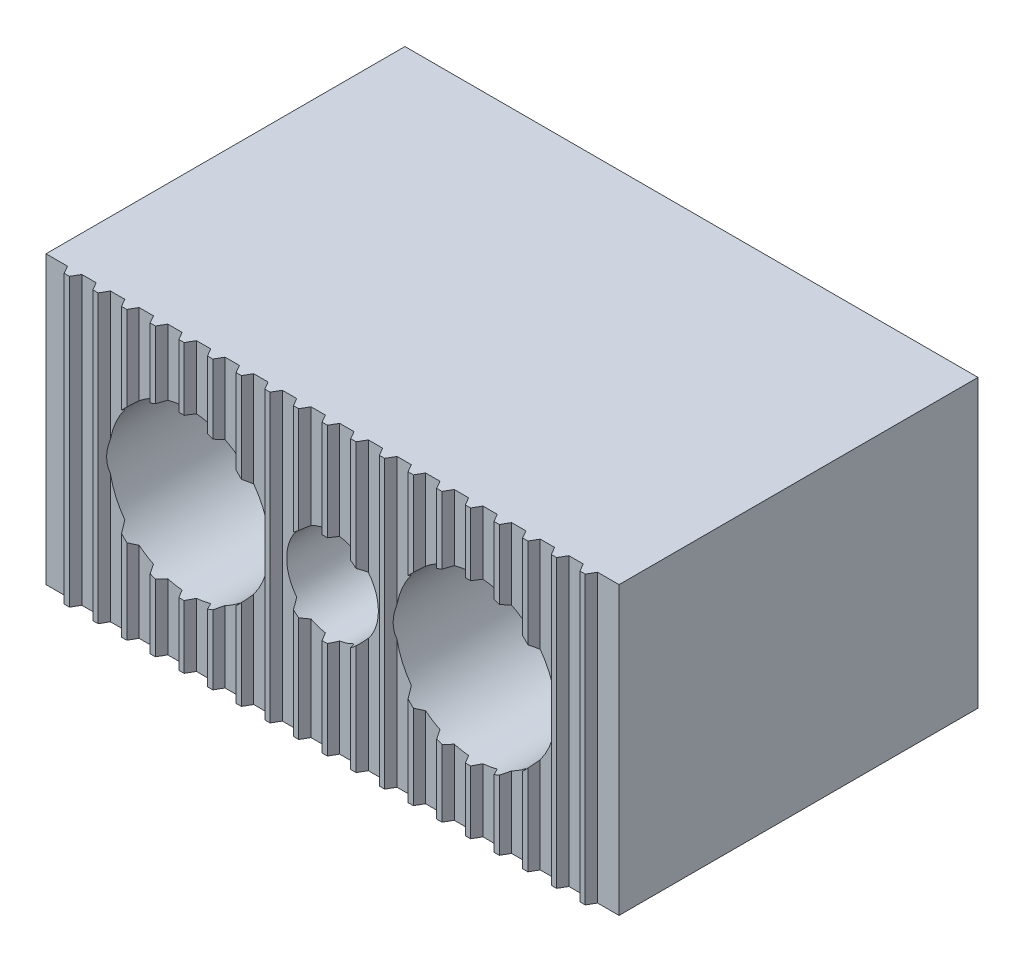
ISO-10303-21;
HEADER;
FILE_DESCRIPTION(('STEP AP214'),'2;1');
FILE_NAME('part.step','',(''),(''),'','','');
FILE_SCHEMA(('AUTOMOTIVE_DESIGN { 1 0 10303 214 1 1 1 1 }'));
ENDSEC;
DATA;
#1=APPLICATION_CONTEXT('core data for automotive mechanical design processes');
#2=APPLICATION_PROTOCOL_DEFINITION('international standard','automotive_design',2000,#1);
#3=PRODUCT_CONTEXT('',#1,'mechanical');
#4=PRODUCT('Part','Part','',(#3));
#5=PRODUCT_RELATED_PRODUCT_CATEGORY('part','',(#4));
#6=PRODUCT_DEFINITION_FORMATION('','',#4);
#7=PRODUCT_DEFINITION_CONTEXT('part definition',#1,'design');
#8=PRODUCT_DEFINITION('design','',#6,#7);
#9=PRODUCT_DEFINITION_SHAPE('','',#8);
#10=(LENGTH_UNIT() NAMED_UNIT(*) SI_UNIT(.MILLI.,.METRE.));
#11=(NAMED_UNIT(*) PLANE_ANGLE_UNIT() SI_UNIT($,.RADIAN.));
#12=(NAMED_UNIT(*) SI_UNIT($,.STERADIAN.) SOLID_ANGLE_UNIT());
#13=UNCERTAINTY_MEASURE_WITH_UNIT(LENGTH_MEASURE(1.E-05),#10,'distance_accuracy_value','');
#14=(GEOMETRIC_REPRESENTATION_CONTEXT(3) GLOBAL_UNCERTAINTY_ASSIGNED_CONTEXT((#13)) GLOBAL_UNIT_ASSIGNED_CONTEXT((#10,
#11,#12)) REPRESENTATION_CONTEXT('',''));
#15=CARTESIAN_POINT('',(0.,0.,0.));
#16=DIRECTION('',(0.,0.,1.));
#17=DIRECTION('',(1.,0.,0.));
#18=AXIS2_PLACEMENT_3D('',#15,#16,#17);
#19=CARTESIAN_POINT('',(9.76905989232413,12.5,32.));
#20=DIRECTION('',(-0.866025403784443,0.,0.499999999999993));
#21=DIRECTION('',(0.499999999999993,0.,0.866025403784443));
#22=AXIS2_PLACEMENT_3D('',#19,#20,#21);
#23=PLANE('',#22);
#24=CARTESIAN_POINT('',(12.5,0.,36.7301270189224));
#25=DIRECTION('',(-0.866025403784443,0.,0.499999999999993));
#26=DIRECTION('',(0.499999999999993,0.,0.866025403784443));
#27=AXIS2_PLACEMENT_3D('',#24,#25,#26);
#28=ELLIPSE('',#27,8.00000000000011,4.);
#29=CARTESIAN_POINT('',(9.76905989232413,2.92266421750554,32.));
#30=VERTEX_POINT('',#29);
#31=CARTESIAN_POINT('',(9.37646170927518,2.49870137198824,31.32));
#32=VERTEX_POINT('',#31);
#33=EDGE_CURVE('E1540',#30,#32,#28,.T.);
#34=ORIENTED_EDGE('',*,*,#33,.F.);
#35=DIRECTION('',(0.,-1.,0.));
#36=VECTOR('',#35,1.);
#37=CARTESIAN_POINT('',(9.76905989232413,12.5,32.));
#38=LINE('',#37,#36);
#39=CARTESIAN_POINT('',(9.76905989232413,12.5,32.));
#40=VERTEX_POINT('',#39);
#41=EDGE_CURVE('E907',#40,#30,#38,.T.);
#42=ORIENTED_EDGE('',*,*,#41,.F.);
#43=DIRECTION('',(-0.499999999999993,0.,-0.866025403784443));
#44=VECTOR('',#43,1.);
#45=CARTESIAN_POINT('',(9.76905989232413,12.5,32.));
#46=LINE('',#45,#44);
#47=CARTESIAN_POINT('',(9.37646170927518,12.5,31.32));
#48=VERTEX_POINT('',#47);
#49=EDGE_CURVE('E1279',#40,#48,#46,.T.);
#50=ORIENTED_EDGE('',*,*,#49,.T.);
#51=DIRECTION('',(0.,-1.,0.));
#52=VECTOR('',#51,1.);
#53=CARTESIAN_POINT('',(9.37646170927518,12.5,31.32));
#54=LINE('',#53,#52);
#55=EDGE_CURVE('E911',#48,#32,#54,.T.);
#56=ORIENTED_EDGE('',*,*,#55,.T.);
#57=EDGE_LOOP('',(#34,#42,#50,#56));
#58=FACE_BOUND('',#57,.T.);
#59=ADVANCED_FACE('F14',(#58),#23,.T.);
#60=CARTESIAN_POINT('',(10.2309401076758,12.5,32.));
#61=DIRECTION('',(0.,0.,1.));
#62=DIRECTION('',(1.,0.,0.));
#63=AXIS2_PLACEMENT_3D('',#60,#61,#62);
#64=PLANE('',#63);
#65=CARTESIAN_POINT('',(12.5,0.,32.));
#66=DIRECTION('',(0.,0.,1.));
#67=DIRECTION('',(1.,0.,0.));
#68=AXIS2_PLACEMENT_3D('',#65,#66,#67);
#69=CIRCLE('',#68,4.);
#70=CARTESIAN_POINT('',(10.2309401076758,3.29414134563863,32.));
#71=VERTEX_POINT('',#70);
#72=EDGE_CURVE('E1837',#71,#30,#69,.T.);
#73=ORIENTED_EDGE('',*,*,#72,.F.);
#74=DIRECTION('',(0.,-1.,0.));
#75=VECTOR('',#74,1.);
#76=CARTESIAN_POINT('',(10.2309401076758,12.5,32.));
#77=LINE('',#76,#75);
#78=CARTESIAN_POINT('',(10.2309401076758,12.5,32.));
#79=VERTEX_POINT('',#78);
#80=EDGE_CURVE('E903',#79,#71,#77,.T.);
#81=ORIENTED_EDGE('',*,*,#80,.F.);
#82=DIRECTION('',(-1.,0.,0.));
#83=VECTOR('',#82,1.);
#84=CARTESIAN_POINT('',(10.2309401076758,12.5,32.));
#85=LINE('',#84,#83);
#86=EDGE_CURVE('E1276',#79,#40,#85,.T.);
#87=ORIENTED_EDGE('',*,*,#86,.T.);
#88=ORIENTED_EDGE('',*,*,#41,.T.);
#89=EDGE_LOOP('',(#73,#81,#87,#88));
#90=FACE_BOUND('',#89,.T.);
#91=ADVANCED_FACE('F1836',(#90),#64,.T.);
#92=CARTESIAN_POINT('',(10.2309401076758,12.5,32.));
#93=DIRECTION('',(-0.866025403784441,0.,-0.5));
#94=DIRECTION('',(-0.5,0.,0.866025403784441));
#95=AXIS2_PLACEMENT_3D('',#92,#93,#94);
#96=PLANE('',#95);
#97=ORIENTED_EDGE('',*,*,#80,.T.);
#98=CARTESIAN_POINT('',(12.5,0.,28.0698729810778));
#99=DIRECTION('',(-0.866025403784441,0.,-0.5));
#100=DIRECTION('',(-0.5,0.,0.866025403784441));
#101=AXIS2_PLACEMENT_3D('',#98,#99,#100);
#102=ELLIPSE('',#101,8.,4.);
#103=CARTESIAN_POINT('',(10.6235382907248,3.53254744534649,31.32));
#104=VERTEX_POINT('',#103);
#105=EDGE_CURVE('E1536',#71,#104,#102,.T.);
#106=ORIENTED_EDGE('',*,*,#105,.T.);
#107=DIRECTION('',(0.,-1.,0.));
#108=VECTOR('',#107,1.);
#109=CARTESIAN_POINT('',(10.6235382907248,12.5,31.32));
#110=LINE('',#109,#108);
#111=CARTESIAN_POINT('',(10.6235382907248,12.5,31.32));
#112=VERTEX_POINT('',#111);
#113=EDGE_CURVE('E899',#112,#104,#110,.T.);
#114=ORIENTED_EDGE('',*,*,#113,.F.);
#115=DIRECTION('',(0.5,0.,-0.866025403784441));
#116=VECTOR('',#115,1.);
#117=CARTESIAN_POINT('',(10.2309401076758,12.5,32.));
#118=LINE('',#117,#116);
#119=EDGE_CURVE('E1273',#79,#112,#118,.T.);
#120=ORIENTED_EDGE('',*,*,#119,.F.);
#121=EDGE_LOOP('',(#97,#106,#114,#120));
#122=FACE_BOUND('',#121,.T.);
#123=ADVANCED_FACE('F1841',(#122),#96,.F.);
#124=CARTESIAN_POINT('',(11.8764617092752,12.5,31.32));
#125=DIRECTION('',(0.,0.,1.));
#126=DIRECTION('',(1.,0.,0.));
#127=AXIS2_PLACEMENT_3D('',#124,#125,#126);
#128=PLANE('',#127);
#129=CARTESIAN_POINT('',(12.5,0.,31.32));
#130=DIRECTION('',(0.,0.,1.));
#131=DIRECTION('',(1.,0.,0.));
#132=AXIS2_PLACEMENT_3D('',#129,#130,#131);
#133=CIRCLE('',#132,4.);
#134=CARTESIAN_POINT('',(11.8764617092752,3.9511011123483,31.32));
#135=VERTEX_POINT('',#134);
#136=EDGE_CURVE('E1533',#135,#104,#133,.T.);
#137=ORIENTED_EDGE('',*,*,#136,.F.);
#138=DIRECTION('',(0.,-1.,0.));
#139=VECTOR('',#138,1.);
#140=CARTESIAN_POINT('',(11.8764617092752,12.5,31.32));
#141=LINE('',#140,#139);
#142=CARTESIAN_POINT('',(11.8764617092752,12.5,31.32));
#143=VERTEX_POINT('',#142);
#144=EDGE_CURVE('E895',#143,#135,#141,.T.);
#145=ORIENTED_EDGE('',*,*,#144,.F.);
#146=DIRECTION('',(-1.,0.,0.));
#147=VECTOR('',#146,1.);
#148=CARTESIAN_POINT('',(11.8764617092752,12.5,31.32));
#149=LINE('',#148,#147);
#150=EDGE_CURVE('E1270',#143,#112,#149,.T.);
#151=ORIENTED_EDGE('',*,*,#150,.T.);
#152=ORIENTED_EDGE('',*,*,#113,.T.);
#153=EDGE_LOOP('',(#137,#145,#151,#152));
#154=FACE_BOUND('',#153,.T.);
#155=ADVANCED_FACE('F1845',(#154),#128,.T.);
#156=CARTESIAN_POINT('',(12.2690598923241,12.5,32.));
#157=DIRECTION('',(-0.866025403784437,0.,0.5));
#158=DIRECTION('',(0.5,0.,0.866025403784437));
#159=AXIS2_PLACEMENT_3D('',#156,#157,#158);
#160=PLANE('',#159);
#161=CARTESIAN_POINT('',(12.5,0.,32.4));
#162=DIRECTION('',(-0.866025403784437,0.,0.5));
#163=DIRECTION('',(0.5,0.,0.866025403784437));
#164=AXIS2_PLACEMENT_3D('',#161,#162,#163);
#165=ELLIPSE('',#164,8.,4.);
#166=CARTESIAN_POINT('',(12.2690598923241,3.99332776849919,32.));
#167=VERTEX_POINT('',#166);
#168=EDGE_CURVE('E1530',#167,#135,#165,.T.);
#169=ORIENTED_EDGE('',*,*,#168,.F.);
#170=DIRECTION('',(0.,-1.,0.));
#171=VECTOR('',#170,1.);
#172=CARTESIAN_POINT('',(12.2690598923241,12.5,32.));
#173=LINE('',#172,#171);
#174=CARTESIAN_POINT('',(12.2690598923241,12.5,32.));
#175=VERTEX_POINT('',#174);
#176=EDGE_CURVE('E891',#175,#167,#173,.T.);
#177=ORIENTED_EDGE('',*,*,#176,.F.);
#178=DIRECTION('',(-0.5,0.,-0.866025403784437));
#179=VECTOR('',#178,1.);
#180=CARTESIAN_POINT('',(12.2690598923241,12.5,32.));
#181=LINE('',#180,#179);
#182=EDGE_CURVE('E1267',#175,#143,#181,.T.);
#183=ORIENTED_EDGE('',*,*,#182,.T.);
#184=ORIENTED_EDGE('',*,*,#144,.T.);
#185=EDGE_LOOP('',(#169,#177,#183,#184));
#186=FACE_BOUND('',#185,.T.);
#187=ADVANCED_FACE('F1850',(#186),#160,.T.);
#188=CARTESIAN_POINT('',(12.7309401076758,12.5,32.));
#189=DIRECTION('',(0.,0.,1.));
#190=DIRECTION('',(1.,0.,0.));
#191=AXIS2_PLACEMENT_3D('',#188,#189,#190);
#192=PLANE('',#191);
#193=CARTESIAN_POINT('',(12.7309401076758,3.99332776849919,32.));
#194=VERTEX_POINT('',#193);
#195=EDGE_CURVE('E863',#194,#167,#69,.T.);
#196=ORIENTED_EDGE('',*,*,#195,.F.);
#197=DIRECTION('',(0.,-1.,0.));
#198=VECTOR('',#197,1.);
#199=CARTESIAN_POINT('',(12.7309401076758,12.5,32.));
#200=LINE('',#199,#198);
#201=CARTESIAN_POINT('',(12.7309401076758,12.5,32.));
#202=VERTEX_POINT('',#201);
#203=EDGE_CURVE('E887',#202,#194,#200,.T.);
#204=ORIENTED_EDGE('',*,*,#203,.F.);
#205=DIRECTION('',(-1.,0.,0.));
#206=VECTOR('',#205,1.);
#207=CARTESIAN_POINT('',(12.7309401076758,12.5,32.));
#208=LINE('',#207,#206);
#209=EDGE_CURVE('E1264',#202,#175,#208,.T.);
#210=ORIENTED_EDGE('',*,*,#209,.T.);
#211=ORIENTED_EDGE('',*,*,#176,.T.);
#212=EDGE_LOOP('',(#196,#204,#210,#211));
#213=FACE_BOUND('',#212,.T.);
#214=ADVANCED_FACE('F1853',(#213),#192,.T.);
#215=CARTESIAN_POINT('',(12.7309401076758,12.5,32.));
#216=DIRECTION('',(-0.866025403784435,0.,-0.500000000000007));
#217=DIRECTION('',(-0.500000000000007,0.,0.866025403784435));
#218=AXIS2_PLACEMENT_3D('',#215,#216,#217);
#219=PLANE('',#218);
#220=ORIENTED_EDGE('',*,*,#203,.T.);
#221=CARTESIAN_POINT('',(12.5,0.,32.4));
#222=DIRECTION('',(-0.866025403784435,0.,-0.500000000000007));
#223=DIRECTION('',(-0.500000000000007,0.,0.866025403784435));
#224=AXIS2_PLACEMENT_3D('',#221,#222,#223);
#225=ELLIPSE('',#224,7.99999999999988,4.);
#226=CARTESIAN_POINT('',(13.1235382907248,3.9511011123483,31.32));
#227=VERTEX_POINT('',#226);
#228=EDGE_CURVE('E1518',#194,#227,#225,.T.);
#229=ORIENTED_EDGE('',*,*,#228,.T.);
#230=DIRECTION('',(0.,-1.,0.));
#231=VECTOR('',#230,1.);
#232=CARTESIAN_POINT('',(13.1235382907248,12.5,31.32));
#233=LINE('',#232,#231);
#234=CARTESIAN_POINT('',(13.1235382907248,12.5,31.32));
#235=VERTEX_POINT('',#234);
#236=EDGE_CURVE('E883',#235,#227,#233,.T.);
#237=ORIENTED_EDGE('',*,*,#236,.F.);
#238=DIRECTION('',(0.500000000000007,0.,-0.866025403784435));
#239=VECTOR('',#238,1.);
#240=CARTESIAN_POINT('',(12.7309401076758,12.5,32.));
#241=LINE('',#240,#239);
#242=EDGE_CURVE('E1261',#202,#235,#241,.T.);
#243=ORIENTED_EDGE('',*,*,#242,.F.);
#244=EDGE_LOOP('',(#220,#229,#237,#243));
#245=FACE_BOUND('',#244,.T.);
#246=ADVANCED_FACE('F1856',(#245),#219,.F.);
#247=CARTESIAN_POINT('',(14.3764617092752,12.5,31.32));
#248=DIRECTION('',(0.,0.,1.));
#249=DIRECTION('',(1.,0.,0.));
#250=AXIS2_PLACEMENT_3D('',#247,#248,#249);
#251=PLANE('',#250);
#252=CARTESIAN_POINT('',(12.5,0.,31.32));
#253=DIRECTION('',(0.,0.,1.));
#254=DIRECTION('',(1.,0.,0.));
#255=AXIS2_PLACEMENT_3D('',#252,#253,#254);
#256=CIRCLE('',#255,4.);
#257=CARTESIAN_POINT('',(14.3764617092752,3.53254744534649,31.32));
#258=VERTEX_POINT('',#257);
#259=EDGE_CURVE('E1515',#258,#227,#256,.T.);
#260=ORIENTED_EDGE('',*,*,#259,.F.);
#261=DIRECTION('',(0.,-1.,0.));
#262=VECTOR('',#261,1.);
#263=CARTESIAN_POINT('',(14.3764617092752,12.5,31.32));
#264=LINE('',#263,#262);
#265=CARTESIAN_POINT('',(14.3764617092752,12.5,31.32));
#266=VERTEX_POINT('',#265);
#267=EDGE_CURVE('E879',#266,#258,#264,.T.);
#268=ORIENTED_EDGE('',*,*,#267,.F.);
#269=DIRECTION('',(-1.,0.,0.));
#270=VECTOR('',#269,1.);
#271=CARTESIAN_POINT('',(14.3764617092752,12.5,31.32));
#272=LINE('',#271,#270);
#273=EDGE_CURVE('E1258',#266,#235,#272,.T.);
#274=ORIENTED_EDGE('',*,*,#273,.T.);
#275=ORIENTED_EDGE('',*,*,#236,.T.);
#276=EDGE_LOOP('',(#260,#268,#274,#275));
#277=FACE_BOUND('',#276,.T.);
#278=ADVANCED_FACE('F1859',(#277),#251,.T.);
#279=CARTESIAN_POINT('',(14.7690598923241,12.5,32.));
#280=DIRECTION('',(-0.866025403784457,0.,0.499999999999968));
#281=DIRECTION('',(0.499999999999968,0.,0.866025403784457));
#282=AXIS2_PLACEMENT_3D('',#279,#280,#281);
#283=PLANE('',#282);
#284=CARTESIAN_POINT('',(12.5,0.,28.0698729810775));
#285=DIRECTION('',(-0.866025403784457,0.,0.499999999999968));
#286=DIRECTION('',(0.499999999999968,0.,0.866025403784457));
#287=AXIS2_PLACEMENT_3D('',#284,#285,#286);
#288=ELLIPSE('',#287,8.00000000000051,4.);
#289=CARTESIAN_POINT('',(14.7690598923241,3.29414134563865,32.));
#290=VERTEX_POINT('',#289);
#291=EDGE_CURVE('E1513',#290,#258,#288,.T.);
#292=ORIENTED_EDGE('',*,*,#291,.F.);
#293=DIRECTION('',(0.,-1.,0.));
#294=VECTOR('',#293,1.);
#295=CARTESIAN_POINT('',(14.7690598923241,12.5,32.));
#296=LINE('',#295,#294);
#297=CARTESIAN_POINT('',(14.7690598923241,12.5,32.));
#298=VERTEX_POINT('',#297);
#299=EDGE_CURVE('E861',#298,#290,#296,.T.);
#300=ORIENTED_EDGE('',*,*,#299,.F.);
#301=DIRECTION('',(-0.499999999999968,0.,-0.866025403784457));
#302=VECTOR('',#301,1.);
#303=CARTESIAN_POINT('',(14.7690598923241,12.5,32.));
#304=LINE('',#303,#302);
#305=EDGE_CURVE('E1255',#298,#266,#304,.T.);
#306=ORIENTED_EDGE('',*,*,#305,.T.);
#307=ORIENTED_EDGE('',*,*,#267,.T.);
#308=EDGE_LOOP('',(#292,#300,#306,#307));
#309=FACE_BOUND('',#308,.T.);
#310=ADVANCED_FACE('F1512',(#309),#283,.T.);
#311=CARTESIAN_POINT('',(15.2309401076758,12.5,32.));
#312=DIRECTION('',(0.,0.,1.));
#313=DIRECTION('',(1.,0.,0.));
#314=AXIS2_PLACEMENT_3D('',#311,#312,#313);
#315=PLANE('',#314);
#316=CARTESIAN_POINT('',(15.2309401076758,2.92266421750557,32.));
#317=VERTEX_POINT('',#316);
#318=EDGE_CURVE('E848',#317,#290,#69,.T.);
#319=ORIENTED_EDGE('',*,*,#318,.F.);
#320=DIRECTION('',(0.,-1.,0.));
#321=VECTOR('',#320,1.);
#322=CARTESIAN_POINT('',(15.2309401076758,12.5,32.));
#323=LINE('',#322,#321);
#324=CARTESIAN_POINT('',(15.2309401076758,12.5,32.));
#325=VERTEX_POINT('',#324);
#326=EDGE_CURVE('E859',#325,#317,#323,.T.);
#327=ORIENTED_EDGE('',*,*,#326,.F.);
#328=DIRECTION('',(-1.,0.,0.));
#329=VECTOR('',#328,1.);
#330=CARTESIAN_POINT('',(15.2309401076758,12.5,32.));
#331=LINE('',#330,#329);
#332=EDGE_CURVE('E1253',#325,#298,#331,.T.);
#333=ORIENTED_EDGE('',*,*,#332,.T.);
#334=ORIENTED_EDGE('',*,*,#299,.T.);
#335=EDGE_LOOP('',(#319,#327,#333,#334));
#336=FACE_BOUND('',#335,.T.);
#337=ADVANCED_FACE('F857',(#336),#315,.T.);
#338=CARTESIAN_POINT('',(15.2309401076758,12.5,32.));
#339=DIRECTION('',(-0.866025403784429,0.,-0.500000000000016));
#340=DIRECTION('',(-0.500000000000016,0.,0.866025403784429));
#341=AXIS2_PLACEMENT_3D('',#338,#339,#340);
#342=PLANE('',#341);
#343=ORIENTED_EDGE('',*,*,#326,.T.);
#344=CARTESIAN_POINT('',(12.5,0.,36.730127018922));
#345=DIRECTION('',(-0.866025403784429,0.,-0.500000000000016));
#346=DIRECTION('',(-0.500000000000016,0.,0.866025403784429));
#347=AXIS2_PLACEMENT_3D('',#344,#345,#346);
#348=ELLIPSE('',#347,7.99999999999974,4.);
#349=CARTESIAN_POINT('',(15.6235382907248,2.49870137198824,31.32));
#350=VERTEX_POINT('',#349);
#351=EDGE_CURVE('E844',#317,#350,#348,.T.);
#352=ORIENTED_EDGE('',*,*,#351,.T.);
#353=DIRECTION('',(0.,-1.,0.));
#354=VECTOR('',#353,1.);
#355=CARTESIAN_POINT('',(15.6235382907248,12.5,31.32));
#356=LINE('',#355,#354);
#357=CARTESIAN_POINT('',(15.6235382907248,12.5,31.32));
#358=VERTEX_POINT('',#357);
#359=EDGE_CURVE('E874',#358,#350,#356,.T.);
#360=ORIENTED_EDGE('',*,*,#359,.F.);
#361=DIRECTION('',(0.500000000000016,0.,-0.866025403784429));
#362=VECTOR('',#361,1.);
#363=CARTESIAN_POINT('',(15.2309401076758,12.5,32.));
#364=LINE('',#363,#362);
#365=EDGE_CURVE('E869',#325,#358,#364,.T.);
#366=ORIENTED_EDGE('',*,*,#365,.F.);
#367=EDGE_LOOP('',(#343,#352,#360,#366));
#368=FACE_BOUND('',#367,.T.);
#369=ADVANCED_FACE('F867',(#368),#342,.F.);
#370=CARTESIAN_POINT('',(-12.5,12.5,0.));
#371=DIRECTION('',(0.,0.,-1.));
#372=DIRECTION('',(-1.,0.,0.));
#373=AXIS2_PLACEMENT_3D('',#370,#371,#372);
#374=PLANE('',#373);
#375=CARTESIAN_POINT('',(25.,0.,0.));
#376=DIRECTION('',(0.,0.,-1.));
#377=DIRECTION('',(-1.,0.,0.));
#378=AXIS2_PLACEMENT_3D('',#375,#376,#377);
#379=CIRCLE('',#378,4.5);
#380=CARTESIAN_POINT('',(20.5,0.,0.));
#381=VERTEX_POINT('',#380);
#382=EDGE_CURVE('E1613',#381,#381,#379,.T.);
#383=ORIENTED_EDGE('',*,*,#382,.F.);
#384=EDGE_LOOP('',(#383));
#385=FACE_BOUND('',#384,.T.);
#386=DIRECTION('',(0.,-1.,0.));
#387=VECTOR('',#386,1.);
#388=CARTESIAN_POINT('',(-12.5,12.5,0.));
#389=LINE('',#388,#387);
#390=CARTESIAN_POINT('',(-12.5,12.5,0.));
#391=VERTEX_POINT('',#390);
#392=CARTESIAN_POINT('',(-12.5,-12.5,0.));
#393=VERTEX_POINT('',#392);
#394=EDGE_CURVE('E1024',#391,#393,#389,.T.);
#395=ORIENTED_EDGE('',*,*,#394,.F.);
#396=DIRECTION('',(1.,0.,0.));
#397=VECTOR('',#396,1.);
#398=CARTESIAN_POINT('',(-12.5,12.5,0.));
#399=LINE('',#398,#397);
#400=CARTESIAN_POINT('',(37.5,12.5,0.));
#401=VERTEX_POINT('',#400);
#402=EDGE_CURVE('E1383',#391,#401,#399,.T.);
#403=ORIENTED_EDGE('',*,*,#402,.T.);
#404=DIRECTION('',(0.,-1.,0.));
#405=VECTOR('',#404,1.);
#406=CARTESIAN_POINT('',(37.5,12.5,0.));
#407=LINE('',#406,#405);
#408=CARTESIAN_POINT('',(37.5,-12.5,0.));
#409=VERTEX_POINT('',#408);
#410=EDGE_CURVE('E1026',#401,#409,#407,.T.);
#411=ORIENTED_EDGE('',*,*,#410,.T.);
#412=DIRECTION('',(1.,0.,0.));
#413=VECTOR('',#412,1.);
#414=CARTESIAN_POINT('',(-12.5,-12.5,0.));
#415=LINE('',#414,#413);
#416=EDGE_CURVE('E1145',#393,#409,#415,.T.);
#417=ORIENTED_EDGE('',*,*,#416,.F.);
#418=EDGE_LOOP('',(#395,#403,#411,#417));
#419=FACE_BOUND('',#418,.T.);
#420=CARTESIAN_POINT('',(0.,0.,0.));
#421=DIRECTION('',(0.,0.,-1.));
#422=DIRECTION('',(-1.,0.,0.));
#423=AXIS2_PLACEMENT_3D('',#420,#421,#422);
#424=CIRCLE('',#423,4.5);
#425=CARTESIAN_POINT('',(-4.5,0.,0.));
#426=VERTEX_POINT('',#425);
#427=EDGE_CURVE('E1543',#426,#426,#424,.T.);
#428=ORIENTED_EDGE('',*,*,#427,.F.);
#429=EDGE_LOOP('',(#428));
#430=FACE_BOUND('',#429,.T.);
#431=ADVANCED_FACE('F16',(#385,#419,#430),#374,.T.);
#432=CARTESIAN_POINT('',(-7.26905989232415,12.5,32.));
#433=DIRECTION('',(-0.866025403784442,0.,-0.5));
#434=DIRECTION('',(-0.5,0.,0.866025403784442));
#435=AXIS2_PLACEMENT_3D('',#432,#433,#434);
#436=PLANE('',#435);
#437=CARTESIAN_POINT('',(0.,0.,19.4096189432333));
#438=DIRECTION('',(-0.866025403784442,0.,-0.5));
#439=DIRECTION('',(0.5,0.,-0.866025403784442));
#440=AXIS2_PLACEMENT_3D('',#437,#438,#439);
#441=ELLIPSE('',#440,14.0000000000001,7.);
#442=CARTESIAN_POINT('',(-6.8764617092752,1.3093030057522,31.32));
#443=VERTEX_POINT('',#442);
#444=CARTESIAN_POINT('',(-6.8764617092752,-1.30930300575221,31.32));
#445=VERTEX_POINT('',#444);
#446=EDGE_CURVE('E1610',#443,#445,#441,.F.);
#447=ORIENTED_EDGE('',*,*,#446,.F.);
#448=DIRECTION('',(0.,-1.,0.));
#449=VECTOR('',#448,1.);
#450=CARTESIAN_POINT('',(-6.8764617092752,12.5,31.32));
#451=LINE('',#450,#449);
#452=CARTESIAN_POINT('',(-6.8764617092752,12.5,31.32));
#453=VERTEX_POINT('',#452);
#454=EDGE_CURVE('E1005',#453,#443,#451,.T.);
#455=ORIENTED_EDGE('',*,*,#454,.F.);
#456=DIRECTION('',(0.5,0.,-0.866025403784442));
#457=VECTOR('',#456,1.);
#458=CARTESIAN_POINT('',(-7.26905989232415,12.5,32.));
#459=LINE('',#458,#457);
#460=CARTESIAN_POINT('',(-7.26905989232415,12.5,32.));
#461=VERTEX_POINT('',#460);
#462=EDGE_CURVE('E1356',#461,#453,#459,.T.);
#463=ORIENTED_EDGE('',*,*,#462,.F.);
#464=DIRECTION('',(0.,-1.,0.));
#465=VECTOR('',#464,1.);
#466=CARTESIAN_POINT('',(-7.26905989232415,12.5,32.));
#467=LINE('',#466,#465);
#468=CARTESIAN_POINT('',(-7.26905989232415,-12.5,32.));
#469=VERTEX_POINT('',#468);
#470=EDGE_CURVE('E1008',#461,#469,#467,.T.);
#471=ORIENTED_EDGE('',*,*,#470,.T.);
#472=DIRECTION('',(0.5,0.,-0.866025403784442));
#473=VECTOR('',#472,1.);
#474=CARTESIAN_POINT('',(-7.26905989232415,-12.5,32.));
#475=LINE('',#474,#473);
#476=CARTESIAN_POINT('',(-6.8764617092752,-12.5,31.32));
#477=VERTEX_POINT('',#476);
#478=EDGE_CURVE('E1118',#469,#477,#475,.T.);
#479=ORIENTED_EDGE('',*,*,#478,.T.);
#480=EDGE_CURVE('E1004',#445,#477,#451,.T.);
#481=ORIENTED_EDGE('',*,*,#480,.F.);
#482=EDGE_LOOP('',(#447,#455,#463,#471,#479,#481));
#483=FACE_BOUND('',#482,.T.);
#484=ADVANCED_FACE('F2044',(#483),#436,.F.);
#485=CARTESIAN_POINT('',(-5.6235382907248,12.5,31.32));
#486=DIRECTION('',(0.,0.,1.));
#487=DIRECTION('',(1.,0.,0.));
#488=AXIS2_PLACEMENT_3D('',#485,#486,#487);
#489=PLANE('',#488);
#490=DIRECTION('',(0.,-1.,0.));
#491=VECTOR('',#490,1.);
#492=CARTESIAN_POINT('',(-5.6235382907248,12.5,31.32));
#493=LINE('',#492,#491);
#494=CARTESIAN_POINT('',(-5.6235382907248,-4.16843101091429,31.32));
#495=VERTEX_POINT('',#494);
#496=CARTESIAN_POINT('',(-5.6235382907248,-12.5,31.32));
#497=VERTEX_POINT('',#496);
#498=EDGE_CURVE('E1000',#495,#497,#493,.T.);
#499=ORIENTED_EDGE('',*,*,#498,.F.);
#500=CARTESIAN_POINT('',(0.,0.,31.32));
#501=DIRECTION('',(0.,0.,1.));
#502=DIRECTION('',(1.,0.,0.));
#503=AXIS2_PLACEMENT_3D('',#500,#501,#502);
#504=CIRCLE('',#503,7.);
#505=EDGE_CURVE('E1606',#495,#445,#504,.F.);
#506=ORIENTED_EDGE('',*,*,#505,.T.);
#507=ORIENTED_EDGE('',*,*,#480,.T.);
#508=DIRECTION('',(-1.,0.,0.));
#509=VECTOR('',#508,1.);
#510=CARTESIAN_POINT('',(-5.6235382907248,-12.5,31.32));
#511=LINE('',#510,#509);
#512=EDGE_CURVE('E1115',#497,#477,#511,.T.);
#513=ORIENTED_EDGE('',*,*,#512,.F.);
#514=EDGE_LOOP('',(#499,#506,#507,#513));
#515=FACE_BOUND('',#514,.T.);
#516=ADVANCED_FACE('F2374',(#515),#489,.T.);
#517=ORIENTED_EDGE('',*,*,#454,.T.);
#518=CARTESIAN_POINT('',(-5.6235382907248,4.1684310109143,31.32));
#519=VERTEX_POINT('',#518);
#520=EDGE_CURVE('E1611',#443,#519,#504,.F.);
#521=ORIENTED_EDGE('',*,*,#520,.T.);
#522=CARTESIAN_POINT('',(-5.6235382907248,12.5,31.32));
#523=VERTEX_POINT('',#522);
#524=EDGE_CURVE('E1001',#523,#519,#493,.T.);
#525=ORIENTED_EDGE('',*,*,#524,.F.);
#526=DIRECTION('',(-1.,0.,0.));
#527=VECTOR('',#526,1.);
#528=CARTESIAN_POINT('',(-5.6235382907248,12.5,31.32));
#529=LINE('',#528,#527);
#530=EDGE_CURVE('E1353',#523,#453,#529,.T.);
#531=ORIENTED_EDGE('',*,*,#530,.T.);
#532=EDGE_LOOP('',(#517,#521,#525,#531));
#533=FACE_BOUND('',#532,.T.);
#534=ADVANCED_FACE('F2049',(#533),#489,.T.);
#535=CARTESIAN_POINT('',(-5.2309401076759,12.5,32.));
#536=DIRECTION('',(-0.86602540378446,0.,0.499999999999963));
#537=DIRECTION('',(0.499999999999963,0.,0.86602540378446));
#538=AXIS2_PLACEMENT_3D('',#535,#536,#537);
#539=PLANE('',#538);
#540=ORIENTED_EDGE('',*,*,#524,.T.);
#541=CARTESIAN_POINT('',(0.,0.,41.0602540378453));
#542=DIRECTION('',(-0.86602540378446,0.,0.499999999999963));
#543=DIRECTION('',(-0.499999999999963,0.,-0.86602540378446));
#544=AXIS2_PLACEMENT_3D('',#541,#542,#543);
#545=ELLIPSE('',#544,14.000000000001,7.);
#546=CARTESIAN_POINT('',(-5.2309401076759,4.65158742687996,32.));
#547=VERTEX_POINT('',#546);
#548=EDGE_CURVE('E1607',#519,#547,#545,.F.);
#549=ORIENTED_EDGE('',*,*,#548,.T.);
#550=DIRECTION('',(0.,-1.,0.));
#551=VECTOR('',#550,1.);
#552=CARTESIAN_POINT('',(-5.2309401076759,12.5,32.));
#553=LINE('',#552,#551);
#554=CARTESIAN_POINT('',(-5.2309401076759,12.5,32.));
#555=VERTEX_POINT('',#554);
#556=EDGE_CURVE('E997',#555,#547,#553,.T.);
#557=ORIENTED_EDGE('',*,*,#556,.F.);
#558=DIRECTION('',(-0.499999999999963,0.,-0.86602540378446));
#559=VECTOR('',#558,1.);
#560=CARTESIAN_POINT('',(-5.2309401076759,12.5,32.));
#561=LINE('',#560,#559);
#562=EDGE_CURVE('E1350',#555,#523,#561,.T.);
#563=ORIENTED_EDGE('',*,*,#562,.T.);
#564=EDGE_LOOP('',(#540,#549,#557,#563));
#565=FACE_BOUND('',#564,.T.);
#566=ADVANCED_FACE('F2053',(#565),#539,.T.);
#567=CARTESIAN_POINT('',(-5.2309401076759,-4.65158742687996,32.));
#568=VERTEX_POINT('',#567);
#569=CARTESIAN_POINT('',(-5.2309401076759,-12.5,32.));
#570=VERTEX_POINT('',#569);
#571=EDGE_CURVE('E996',#568,#570,#553,.T.);
#572=ORIENTED_EDGE('',*,*,#571,.F.);
#573=EDGE_CURVE('E1603',#568,#495,#545,.F.);
#574=ORIENTED_EDGE('',*,*,#573,.T.);
#575=ORIENTED_EDGE('',*,*,#498,.T.);
#576=DIRECTION('',(-0.499999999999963,0.,-0.86602540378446));
#577=VECTOR('',#576,1.);
#578=CARTESIAN_POINT('',(-5.2309401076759,-12.5,32.));
#579=LINE('',#578,#577);
#580=EDGE_CURVE('E1112',#570,#497,#579,.T.);
#581=ORIENTED_EDGE('',*,*,#580,.F.);
#582=EDGE_LOOP('',(#572,#574,#575,#581));
#583=FACE_BOUND('',#582,.T.);
#584=ADVANCED_FACE('F2162',(#583),#539,.T.);
#585=CARTESIAN_POINT('',(-4.76905989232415,12.5,32.));
#586=DIRECTION('',(0.,0.,1.));
#587=DIRECTION('',(1.,0.,0.));
#588=AXIS2_PLACEMENT_3D('',#585,#586,#587);
#589=PLANE('',#588);
#590=DIRECTION('',(0.,-1.,0.));
#591=VECTOR('',#590,1.);
#592=CARTESIAN_POINT('',(-4.76905989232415,12.5,32.));
#593=LINE('',#592,#591);
#594=CARTESIAN_POINT('',(-4.76905989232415,-5.12406749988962,32.));
#595=VERTEX_POINT('',#594);
#596=CARTESIAN_POINT('',(-4.76905989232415,-12.5,32.));
#597=VERTEX_POINT('',#596);
#598=EDGE_CURVE('E992',#595,#597,#593,.T.);
#599=ORIENTED_EDGE('',*,*,#598,.F.);
#600=CARTESIAN_POINT('',(0.,0.,32.));
#601=DIRECTION('',(0.,0.,-1.));
#602=DIRECTION('',(-1.,0.,0.));
#603=AXIS2_PLACEMENT_3D('',#600,#601,#602);
#604=CIRCLE('',#603,7.);
#605=EDGE_CURVE('E1552',#595,#568,#604,.T.);
#606=ORIENTED_EDGE('',*,*,#605,.T.);
#607=ORIENTED_EDGE('',*,*,#571,.T.);
#608=DIRECTION('',(-1.,0.,0.));
#609=VECTOR('',#608,1.);
#610=CARTESIAN_POINT('',(-4.76905989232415,-12.5,32.));
#611=LINE('',#610,#609);
#612=EDGE_CURVE('E1109',#597,#570,#611,.T.);
#613=ORIENTED_EDGE('',*,*,#612,.F.);
#614=EDGE_LOOP('',(#599,#606,#607,#613));
#615=FACE_BOUND('',#614,.T.);
#616=ADVANCED_FACE('F2157',(#615),#589,.T.);
#617=ORIENTED_EDGE('',*,*,#556,.T.);
#618=CARTESIAN_POINT('',(-4.76905989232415,5.12406749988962,32.));
#619=VERTEX_POINT('',#618);
#620=EDGE_CURVE('E1553',#547,#619,#604,.T.);
#621=ORIENTED_EDGE('',*,*,#620,.T.);
#622=CARTESIAN_POINT('',(-4.76905989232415,12.5,32.));
#623=VERTEX_POINT('',#622);
#624=EDGE_CURVE('E993',#623,#619,#593,.T.);
#625=ORIENTED_EDGE('',*,*,#624,.F.);
#626=DIRECTION('',(-1.,0.,0.));
#627=VECTOR('',#626,1.);
#628=CARTESIAN_POINT('',(-4.76905989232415,12.5,32.));
#629=LINE('',#628,#627);
#630=EDGE_CURVE('E1347',#623,#555,#629,.T.);
#631=ORIENTED_EDGE('',*,*,#630,.T.);
#632=EDGE_LOOP('',(#617,#621,#625,#631));
#633=FACE_BOUND('',#632,.T.);
#634=ADVANCED_FACE('F2057',(#633),#589,.T.);
#635=CARTESIAN_POINT('',(-4.76905989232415,12.5,32.));
#636=DIRECTION('',(-0.866025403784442,0.,-0.5));
#637=DIRECTION('',(-0.5,0.,0.866025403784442));
#638=AXIS2_PLACEMENT_3D('',#635,#636,#637);
#639=PLANE('',#638);
#640=CARTESIAN_POINT('',(0.,0.,23.7397459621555));
#641=DIRECTION('',(-0.866025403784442,0.,-0.5));
#642=DIRECTION('',(0.5,0.,-0.866025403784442));
#643=AXIS2_PLACEMENT_3D('',#640,#641,#642);
#644=ELLIPSE('',#643,14.0000000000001,7.);
#645=CARTESIAN_POINT('',(-4.3764617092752,5.46320262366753,31.32));
#646=VERTEX_POINT('',#645);
#647=EDGE_CURVE('E1602',#646,#619,#644,.F.);
#648=ORIENTED_EDGE('',*,*,#647,.F.);
#649=DIRECTION('',(0.,-1.,0.));
#650=VECTOR('',#649,1.);
#651=CARTESIAN_POINT('',(-4.3764617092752,12.5,31.32));
#652=LINE('',#651,#650);
#653=CARTESIAN_POINT('',(-4.3764617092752,12.5,31.32));
#654=VERTEX_POINT('',#653);
#655=EDGE_CURVE('E989',#654,#646,#652,.T.);
#656=ORIENTED_EDGE('',*,*,#655,.F.);
#657=DIRECTION('',(0.5,0.,-0.866025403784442));
#658=VECTOR('',#657,1.);
#659=CARTESIAN_POINT('',(-4.76905989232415,12.5,32.));
#660=LINE('',#659,#658);
#661=EDGE_CURVE('E1344',#623,#654,#660,.T.);
#662=ORIENTED_EDGE('',*,*,#661,.F.);
#663=ORIENTED_EDGE('',*,*,#624,.T.);
#664=EDGE_LOOP('',(#648,#656,#662,#663));
#665=FACE_BOUND('',#664,.T.);
#666=ADVANCED_FACE('F2060',(#665),#639,.F.);
#667=CARTESIAN_POINT('',(-4.3764617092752,-5.46320262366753,31.32));
#668=VERTEX_POINT('',#667);
#669=EDGE_CURVE('E1599',#595,#668,#644,.F.);
#670=ORIENTED_EDGE('',*,*,#669,.F.);
#671=ORIENTED_EDGE('',*,*,#598,.T.);
#672=DIRECTION('',(0.5,0.,-0.866025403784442));
#673=VECTOR('',#672,1.);
#674=CARTESIAN_POINT('',(-4.76905989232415,-12.5,32.));
#675=LINE('',#674,#673);
#676=CARTESIAN_POINT('',(-4.3764617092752,-12.5,31.32));
#677=VERTEX_POINT('',#676);
#678=EDGE_CURVE('E1106',#597,#677,#675,.T.);
#679=ORIENTED_EDGE('',*,*,#678,.T.);
#680=EDGE_CURVE('E988',#668,#677,#652,.T.);
#681=ORIENTED_EDGE('',*,*,#680,.F.);
#682=EDGE_LOOP('',(#670,#671,#679,#681));
#683=FACE_BOUND('',#682,.T.);
#684=ADVANCED_FACE('F2169',(#683),#639,.F.);
#685=CARTESIAN_POINT('',(-3.1235382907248,12.5,31.32));
#686=DIRECTION('',(0.,0.,1.));
#687=DIRECTION('',(1.,0.,0.));
#688=AXIS2_PLACEMENT_3D('',#685,#686,#687);
#689=PLANE('',#688);
#690=DIRECTION('',(0.,-1.,0.));
#691=VECTOR('',#690,1.);
#692=CARTESIAN_POINT('',(-3.1235382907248,12.5,31.32));
#693=LINE('',#692,#691);
#694=CARTESIAN_POINT('',(-3.1235382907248,-6.26446394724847,31.32));
#695=VERTEX_POINT('',#694);
#696=CARTESIAN_POINT('',(-3.1235382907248,-12.5,31.32));
#697=VERTEX_POINT('',#696);
#698=EDGE_CURVE('E984',#695,#697,#693,.T.);
#699=ORIENTED_EDGE('',*,*,#698,.F.);
#700=CARTESIAN_POINT('',(0.,0.,31.32));
#701=DIRECTION('',(0.,0.,1.));
#702=DIRECTION('',(1.,0.,0.));
#703=AXIS2_PLACEMENT_3D('',#700,#701,#702);
#704=CIRCLE('',#703,7.);
#705=EDGE_CURVE('E1595',#695,#668,#704,.F.);
#706=ORIENTED_EDGE('',*,*,#705,.T.);
#707=ORIENTED_EDGE('',*,*,#680,.T.);
#708=DIRECTION('',(-1.,0.,0.));
#709=VECTOR('',#708,1.);
#710=CARTESIAN_POINT('',(-3.1235382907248,-12.5,31.32));
#711=LINE('',#710,#709);
#712=EDGE_CURVE('E1103',#697,#677,#711,.T.);
#713=ORIENTED_EDGE('',*,*,#712,.F.);
#714=EDGE_LOOP('',(#699,#706,#707,#713));
#715=FACE_BOUND('',#714,.T.);
#716=ADVANCED_FACE('F2172',(#715),#689,.T.);
#717=ORIENTED_EDGE('',*,*,#655,.T.);
#718=CARTESIAN_POINT('',(-3.1235382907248,6.26446394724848,31.32));
#719=VERTEX_POINT('',#718);
#720=EDGE_CURVE('E1600',#646,#719,#704,.F.);
#721=ORIENTED_EDGE('',*,*,#720,.T.);
#722=CARTESIAN_POINT('',(-3.1235382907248,12.5,31.32));
#723=VERTEX_POINT('',#722);
#724=EDGE_CURVE('E985',#723,#719,#693,.T.);
#725=ORIENTED_EDGE('',*,*,#724,.F.);
#726=DIRECTION('',(-1.,0.,0.));
#727=VECTOR('',#726,1.);
#728=CARTESIAN_POINT('',(-3.1235382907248,12.5,31.32));
#729=LINE('',#728,#727);
#730=EDGE_CURVE('E1341',#723,#654,#729,.T.);
#731=ORIENTED_EDGE('',*,*,#730,.T.);
#732=EDGE_LOOP('',(#717,#721,#725,#731));
#733=FACE_BOUND('',#732,.T.);
#734=ADVANCED_FACE('F2064',(#733),#689,.T.);
#735=CARTESIAN_POINT('',(-2.73094010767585,12.5,32.));
#736=DIRECTION('',(-0.866025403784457,0.,0.499999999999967));
#737=DIRECTION('',(0.499999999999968,0.,0.866025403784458));
#738=AXIS2_PLACEMENT_3D('',#735,#736,#737);
#739=PLANE('',#738);
#740=ORIENTED_EDGE('',*,*,#724,.T.);
#741=CARTESIAN_POINT('',(0.,0.,36.7301270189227));
#742=DIRECTION('',(-0.866025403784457,0.,0.499999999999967));
#743=DIRECTION('',(-0.499999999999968,0.,-0.866025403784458));
#744=AXIS2_PLACEMENT_3D('',#741,#742,#743);
#745=ELLIPSE('',#744,14.0000000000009,7.);
#746=CARTESIAN_POINT('',(-2.73094010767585,6.4453057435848,32.));
#747=VERTEX_POINT('',#746);
#748=EDGE_CURVE('E1596',#719,#747,#745,.F.);
#749=ORIENTED_EDGE('',*,*,#748,.T.);
#750=DIRECTION('',(0.,-1.,0.));
#751=VECTOR('',#750,1.);
#752=CARTESIAN_POINT('',(-2.73094010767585,12.5,32.));
#753=LINE('',#752,#751);
#754=CARTESIAN_POINT('',(-2.73094010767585,12.5,32.));
#755=VERTEX_POINT('',#754);
#756=EDGE_CURVE('E981',#755,#747,#753,.T.);
#757=ORIENTED_EDGE('',*,*,#756,.F.);
#758=DIRECTION('',(-0.499999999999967,0.,-0.866025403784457));
#759=VECTOR('',#758,1.);
#760=CARTESIAN_POINT('',(-2.73094010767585,12.5,32.));
#761=LINE('',#760,#759);
#762=EDGE_CURVE('E1338',#755,#723,#761,.T.);
#763=ORIENTED_EDGE('',*,*,#762,.T.);
#764=EDGE_LOOP('',(#740,#749,#757,#763));
#765=FACE_BOUND('',#764,.T.);
#766=ADVANCED_FACE('F2068',(#765),#739,.T.);
#767=CARTESIAN_POINT('',(-2.73094010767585,-6.4453057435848,32.));
#768=VERTEX_POINT('',#767);
#769=CARTESIAN_POINT('',(-2.73094010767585,-12.5,32.));
#770=VERTEX_POINT('',#769);
#771=EDGE_CURVE('E980',#768,#770,#753,.T.);
#772=ORIENTED_EDGE('',*,*,#771,.F.);
#773=EDGE_CURVE('E1592',#768,#695,#745,.F.);
#774=ORIENTED_EDGE('',*,*,#773,.T.);
#775=ORIENTED_EDGE('',*,*,#698,.T.);
#776=DIRECTION('',(-0.499999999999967,0.,-0.866025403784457));
#777=VECTOR('',#776,1.);
#778=CARTESIAN_POINT('',(-2.73094010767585,-12.5,32.));
#779=LINE('',#778,#777);
#780=EDGE_CURVE('E1100',#770,#697,#779,.T.);
#781=ORIENTED_EDGE('',*,*,#780,.F.);
#782=EDGE_LOOP('',(#772,#774,#775,#781));
#783=FACE_BOUND('',#782,.T.);
#784=ADVANCED_FACE('F2175',(#783),#739,.T.);
#785=CARTESIAN_POINT('',(-2.26905989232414,12.5,32.));
#786=DIRECTION('',(0.,0.,1.));
#787=DIRECTION('',(1.,0.,0.));
#788=AXIS2_PLACEMENT_3D('',#785,#786,#787);
#789=PLANE('',#788);
#790=DIRECTION('',(0.,-1.,0.));
#791=VECTOR('',#790,1.);
#792=CARTESIAN_POINT('',(-2.26905989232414,12.5,32.));
#793=LINE('',#792,#791);
#794=CARTESIAN_POINT('',(-2.26905989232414,-6.62203648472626,32.));
#795=VERTEX_POINT('',#794);
#796=CARTESIAN_POINT('',(-2.26905989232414,-12.5,32.));
#797=VERTEX_POINT('',#796);
#798=EDGE_CURVE('E976',#795,#797,#793,.T.);
#799=ORIENTED_EDGE('',*,*,#798,.F.);
#800=EDGE_CURVE('E2145',#795,#768,#604,.T.);
#801=ORIENTED_EDGE('',*,*,#800,.T.);
#802=ORIENTED_EDGE('',*,*,#771,.T.);
#803=DIRECTION('',(-1.,0.,0.));
#804=VECTOR('',#803,1.);
#805=CARTESIAN_POINT('',(-2.26905989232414,-12.5,32.));
#806=LINE('',#805,#804);
#807=EDGE_CURVE('E1097',#797,#770,#806,.T.);
#808=ORIENTED_EDGE('',*,*,#807,.F.);
#809=EDGE_LOOP('',(#799,#801,#802,#808));
#810=FACE_BOUND('',#809,.T.);
#811=ADVANCED_FACE('F2182',(#810),#789,.T.);
#812=ORIENTED_EDGE('',*,*,#756,.T.);
#813=CARTESIAN_POINT('',(-2.26905989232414,6.62203648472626,32.));
#814=VERTEX_POINT('',#813);
#815=EDGE_CURVE('E1557',#747,#814,#604,.T.);
#816=ORIENTED_EDGE('',*,*,#815,.T.);
#817=CARTESIAN_POINT('',(-2.26905989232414,12.5,32.));
#818=VERTEX_POINT('',#817);
#819=EDGE_CURVE('E977',#818,#814,#793,.T.);
#820=ORIENTED_EDGE('',*,*,#819,.F.);
#821=DIRECTION('',(-1.,0.,0.));
#822=VECTOR('',#821,1.);
#823=CARTESIAN_POINT('',(-2.26905989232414,12.5,32.));
#824=LINE('',#823,#822);
#825=EDGE_CURVE('E1335',#818,#755,#824,.T.);
#826=ORIENTED_EDGE('',*,*,#825,.T.);
#827=EDGE_LOOP('',(#812,#816,#820,#826));
#828=FACE_BOUND('',#827,.T.);
#829=ADVANCED_FACE('F2072',(#828),#789,.T.);
#830=CARTESIAN_POINT('',(-2.26905989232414,12.5,32.));
#831=DIRECTION('',(-0.866025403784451,0.,-0.49999999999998));
#832=DIRECTION('',(-0.49999999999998,0.,0.86602540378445));
#833=AXIS2_PLACEMENT_3D('',#830,#831,#832);
#834=PLANE('',#833);
#835=CARTESIAN_POINT('',(0.,0.,28.0698729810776));
#836=DIRECTION('',(-0.866025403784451,0.,-0.49999999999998));
#837=DIRECTION('',(0.49999999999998,0.,-0.86602540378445));
#838=AXIS2_PLACEMENT_3D('',#835,#836,#837);
#839=ELLIPSE('',#838,14.0000000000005,7.);
#840=CARTESIAN_POINT('',(-1.87646170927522,6.74380393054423,31.32));
#841=VERTEX_POINT('',#840);
#842=EDGE_CURVE('E1591',#841,#814,#839,.F.);
#843=ORIENTED_EDGE('',*,*,#842,.F.);
#844=DIRECTION('',(0.,-1.,0.));
#845=VECTOR('',#844,1.);
#846=CARTESIAN_POINT('',(-1.87646170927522,12.5,31.32));
#847=LINE('',#846,#845);
#848=CARTESIAN_POINT('',(-1.87646170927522,12.5,31.32));
#849=VERTEX_POINT('',#848);
#850=EDGE_CURVE('E973',#849,#841,#847,.T.);
#851=ORIENTED_EDGE('',*,*,#850,.F.);
#852=DIRECTION('',(0.49999999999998,0.,-0.86602540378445));
#853=VECTOR('',#852,1.);
#854=CARTESIAN_POINT('',(-2.26905989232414,12.5,32.));
#855=LINE('',#854,#853);
#856=EDGE_CURVE('E1332',#818,#849,#855,.T.);
#857=ORIENTED_EDGE('',*,*,#856,.F.);
#858=ORIENTED_EDGE('',*,*,#819,.T.);
#859=EDGE_LOOP('',(#843,#851,#857,#858));
#860=FACE_BOUND('',#859,.T.);
#861=ADVANCED_FACE('F2076',(#860),#834,.F.);
#862=CARTESIAN_POINT('',(-1.87646170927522,-6.74380393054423,31.32));
#863=VERTEX_POINT('',#862);
#864=EDGE_CURVE('E1588',#795,#863,#839,.F.);
#865=ORIENTED_EDGE('',*,*,#864,.F.);
#866=ORIENTED_EDGE('',*,*,#798,.T.);
#867=DIRECTION('',(0.49999999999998,0.,-0.86602540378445));
#868=VECTOR('',#867,1.);
#869=CARTESIAN_POINT('',(-2.26905989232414,-12.5,32.));
#870=LINE('',#869,#868);
#871=CARTESIAN_POINT('',(-1.87646170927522,-12.5,31.32));
#872=VERTEX_POINT('',#871);
#873=EDGE_CURVE('E1094',#797,#872,#870,.T.);
#874=ORIENTED_EDGE('',*,*,#873,.T.);
#875=EDGE_CURVE('E972',#863,#872,#847,.T.);
#876=ORIENTED_EDGE('',*,*,#875,.F.);
#877=EDGE_LOOP('',(#865,#866,#874,#876));
#878=FACE_BOUND('',#877,.T.);
#879=ADVANCED_FACE('F2180',(#878),#834,.F.);
#880=CARTESIAN_POINT('',(-1.87646170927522,12.5,31.32));
#881=DIRECTION('',(0.,0.,-1.));
#882=DIRECTION('',(-1.,0.,0.));
#883=AXIS2_PLACEMENT_3D('',#880,#881,#882);
#884=PLANE('',#883);
#885=CARTESIAN_POINT('',(0.,0.,31.32));
#886=DIRECTION('',(0.,0.,-1.));
#887=DIRECTION('',(-1.,0.,0.));
#888=AXIS2_PLACEMENT_3D('',#885,#886,#887);
#889=CIRCLE('',#888,7.);
#890=CARTESIAN_POINT('',(-0.623538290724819,-6.97217326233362,31.32));
#891=VERTEX_POINT('',#890);
#892=EDGE_CURVE('E1585',#863,#891,#889,.F.);
#893=ORIENTED_EDGE('',*,*,#892,.F.);
#894=ORIENTED_EDGE('',*,*,#875,.T.);
#895=DIRECTION('',(1.,0.,0.));
#896=VECTOR('',#895,1.);
#897=CARTESIAN_POINT('',(-1.87646170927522,-12.5,31.32));
#898=LINE('',#897,#896);
#899=CARTESIAN_POINT('',(-0.623538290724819,-12.5,31.32));
#900=VERTEX_POINT('',#899);
#901=EDGE_CURVE('E1091',#872,#900,#898,.T.);
#902=ORIENTED_EDGE('',*,*,#901,.T.);
#903=DIRECTION('',(0.,-1.,0.));
#904=VECTOR('',#903,1.);
#905=CARTESIAN_POINT('',(-0.623538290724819,12.5,31.32));
#906=LINE('',#905,#904);
#907=EDGE_CURVE('E968',#891,#900,#906,.T.);
#908=ORIENTED_EDGE('',*,*,#907,.F.);
#909=EDGE_LOOP('',(#893,#894,#902,#908));
#910=FACE_BOUND('',#909,.T.);
#911=ADVANCED_FACE('F2188',(#910),#884,.F.);
#912=CARTESIAN_POINT('',(-0.623538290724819,6.97217326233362,31.32));
#913=VERTEX_POINT('',#912);
#914=EDGE_CURVE('E1589',#913,#841,#889,.F.);
#915=ORIENTED_EDGE('',*,*,#914,.F.);
#916=CARTESIAN_POINT('',(-0.623538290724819,12.5,31.32));
#917=VERTEX_POINT('',#916);
#918=EDGE_CURVE('E969',#917,#913,#906,.T.);
#919=ORIENTED_EDGE('',*,*,#918,.F.);
#920=DIRECTION('',(1.,0.,0.));
#921=VECTOR('',#920,1.);
#922=CARTESIAN_POINT('',(-1.87646170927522,12.5,31.32));
#923=LINE('',#922,#921);
#924=EDGE_CURVE('E1329',#849,#917,#923,.T.);
#925=ORIENTED_EDGE('',*,*,#924,.F.);
#926=ORIENTED_EDGE('',*,*,#850,.T.);
#927=EDGE_LOOP('',(#915,#919,#925,#926));
#928=FACE_BOUND('',#927,.T.);
#929=ADVANCED_FACE('F2081',(#928),#884,.F.);
#930=CARTESIAN_POINT('',(-0.230940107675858,12.5,32.));
#931=DIRECTION('',(-0.866025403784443,0.,0.499999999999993));
#932=DIRECTION('',(0.499999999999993,0.,0.866025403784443));
#933=AXIS2_PLACEMENT_3D('',#930,#931,#932);
#934=PLANE('',#933);
#935=ORIENTED_EDGE('',*,*,#918,.T.);
#936=CARTESIAN_POINT('',(0.,0.,32.4));
#937=DIRECTION('',(-0.866025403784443,0.,0.499999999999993));
#938=DIRECTION('',(-0.499999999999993,0.,-0.866025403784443));
#939=AXIS2_PLACEMENT_3D('',#936,#937,#938);
#940=ELLIPSE('',#939,14.0000000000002,7.);
#941=CARTESIAN_POINT('',(-0.230940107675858,6.99618943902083,32.));
#942=VERTEX_POINT('',#941);
#943=EDGE_CURVE('E1586',#913,#942,#940,.F.);
#944=ORIENTED_EDGE('',*,*,#943,.T.);
#945=DIRECTION('',(0.,-1.,0.));
#946=VECTOR('',#945,1.);
#947=CARTESIAN_POINT('',(-0.230940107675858,12.5,32.));
#948=LINE('',#947,#946);
#949=CARTESIAN_POINT('',(-0.230940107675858,12.5,32.));
#950=VERTEX_POINT('',#949);
#951=EDGE_CURVE('E965',#950,#942,#948,.T.);
#952=ORIENTED_EDGE('',*,*,#951,.F.);
#953=DIRECTION('',(-0.499999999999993,0.,-0.866025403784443));
#954=VECTOR('',#953,1.);
#955=CARTESIAN_POINT('',(-0.230940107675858,12.5,32.));
#956=LINE('',#955,#954);
#957=EDGE_CURVE('E1326',#950,#917,#956,.T.);
#958=ORIENTED_EDGE('',*,*,#957,.T.);
#959=EDGE_LOOP('',(#935,#944,#952,#958));
#960=FACE_BOUND('',#959,.T.);
#961=ADVANCED_FACE('F2084',(#960),#934,.T.);
#962=CARTESIAN_POINT('',(-0.230940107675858,-6.99618943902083,32.));
#963=VERTEX_POINT('',#962);
#964=CARTESIAN_POINT('',(-0.230940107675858,-12.5,32.));
#965=VERTEX_POINT('',#964);
#966=EDGE_CURVE('E964',#963,#965,#948,.T.);
#967=ORIENTED_EDGE('',*,*,#966,.F.);
#968=EDGE_CURVE('E1582',#963,#891,#940,.F.);
#969=ORIENTED_EDGE('',*,*,#968,.T.);
#970=ORIENTED_EDGE('',*,*,#907,.T.);
#971=DIRECTION('',(-0.499999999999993,0.,-0.866025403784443));
#972=VECTOR('',#971,1.);
#973=CARTESIAN_POINT('',(-0.230940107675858,-12.5,32.));
#974=LINE('',#973,#972);
#975=EDGE_CURVE('E1088',#965,#900,#974,.T.);
#976=ORIENTED_EDGE('',*,*,#975,.F.);
#977=EDGE_LOOP('',(#967,#969,#970,#976));
#978=FACE_BOUND('',#977,.T.);
#979=ADVANCED_FACE('F2190',(#978),#934,.T.);
#980=CARTESIAN_POINT('',(0.230940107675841,12.5,32.));
#981=DIRECTION('',(0.,0.,1.));
#982=DIRECTION('',(1.,0.,0.));
#983=AXIS2_PLACEMENT_3D('',#980,#981,#982);
#984=PLANE('',#983);
#985=DIRECTION('',(0.,-1.,0.));
#986=VECTOR('',#985,1.);
#987=CARTESIAN_POINT('',(0.230940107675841,12.5,32.));
#988=LINE('',#987,#986);
#989=CARTESIAN_POINT('',(0.230940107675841,-6.99618943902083,32.));
#990=VERTEX_POINT('',#989);
#991=CARTESIAN_POINT('',(0.230940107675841,-12.5,32.));
#992=VERTEX_POINT('',#991);
#993=EDGE_CURVE('E960',#990,#992,#988,.T.);
#994=ORIENTED_EDGE('',*,*,#993,.F.);
#995=EDGE_CURVE('E2140',#990,#963,#604,.T.);
#996=ORIENTED_EDGE('',*,*,#995,.T.);
#997=ORIENTED_EDGE('',*,*,#966,.T.);
#998=DIRECTION('',(-1.,0.,0.));
#999=VECTOR('',#998,1.);
#1000=CARTESIAN_POINT('',(0.230940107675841,-12.5,32.));
#1001=LINE('',#1000,#999);
#1002=EDGE_CURVE('E1085',#992,#965,#1001,.T.);
#1003=ORIENTED_EDGE('',*,*,#1002,.F.);
#1004=EDGE_LOOP('',(#994,#996,#997,#1003));
#1005=FACE_BOUND('',#1004,.T.);
#1006=ADVANCED_FACE('F2192',(#1005),#984,.T.);
#1007=ORIENTED_EDGE('',*,*,#951,.T.);
#1008=CARTESIAN_POINT('',(0.230940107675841,6.99618943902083,32.));
#1009=VERTEX_POINT('',#1008);
#1010=EDGE_CURVE('E2090',#942,#1009,#604,.T.);
#1011=ORIENTED_EDGE('',*,*,#1010,.T.);
#1012=CARTESIAN_POINT('',(0.230940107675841,12.5,32.));
#1013=VERTEX_POINT('',#1012);
#1014=EDGE_CURVE('E961',#1013,#1009,#988,.T.);
#1015=ORIENTED_EDGE('',*,*,#1014,.F.);
#1016=DIRECTION('',(-1.,0.,0.));
#1017=VECTOR('',#1016,1.);
#1018=CARTESIAN_POINT('',(0.230940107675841,12.5,32.));
#1019=LINE('',#1018,#1017);
#1020=EDGE_CURVE('E1323',#1013,#950,#1019,.T.);
#1021=ORIENTED_EDGE('',*,*,#1020,.T.);
#1022=EDGE_LOOP('',(#1007,#1011,#1015,#1021));
#1023=FACE_BOUND('',#1022,.T.);
#1024=ADVANCED_FACE('F2088',(#1023),#984,.T.);
#1025=CARTESIAN_POINT('',(0.230940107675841,12.5,32.));
#1026=DIRECTION('',(-0.866025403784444,0.,-0.499999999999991));
#1027=DIRECTION('',(-0.499999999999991,0.,0.866025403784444));
#1028=AXIS2_PLACEMENT_3D('',#1025,#1026,#1027);
#1029=PLANE('',#1028);
#1030=CARTESIAN_POINT('',(0.,0.,32.4));
#1031=DIRECTION('',(-0.866025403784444,0.,-0.499999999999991));
#1032=DIRECTION('',(0.499999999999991,0.,-0.866025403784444));
#1033=AXIS2_PLACEMENT_3D('',#1030,#1031,#1032);
#1034=ELLIPSE('',#1033,14.0000000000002,7.);
#1035=CARTESIAN_POINT('',(0.623538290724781,6.97217326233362,31.32));
#1036=VERTEX_POINT('',#1035);
#1037=EDGE_CURVE('E1581',#1036,#1009,#1034,.F.);
#1038=ORIENTED_EDGE('',*,*,#1037,.F.);
#1039=DIRECTION('',(0.,-1.,0.));
#1040=VECTOR('',#1039,1.);
#1041=CARTESIAN_POINT('',(0.623538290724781,12.5,31.32));
#1042=LINE('',#1041,#1040);
#1043=CARTESIAN_POINT('',(0.623538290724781,12.5,31.32));
#1044=VERTEX_POINT('',#1043);
#1045=EDGE_CURVE('E957',#1044,#1036,#1042,.T.);
#1046=ORIENTED_EDGE('',*,*,#1045,.F.);
#1047=DIRECTION('',(0.499999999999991,0.,-0.866025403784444));
#1048=VECTOR('',#1047,1.);
#1049=CARTESIAN_POINT('',(0.230940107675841,12.5,32.));
#1050=LINE('',#1049,#1048);
#1051=EDGE_CURVE('E1320',#1013,#1044,#1050,.T.);
#1052=ORIENTED_EDGE('',*,*,#1051,.F.);
#1053=ORIENTED_EDGE('',*,*,#1014,.T.);
#1054=EDGE_LOOP('',(#1038,#1046,#1052,#1053));
#1055=FACE_BOUND('',#1054,.T.);
#1056=ADVANCED_FACE('F2093',(#1055),#1029,.F.);
#1057=CARTESIAN_POINT('',(0.623538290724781,-6.97217326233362,31.32));
#1058=VERTEX_POINT('',#1057);
#1059=EDGE_CURVE('E1578',#990,#1058,#1034,.F.);
#1060=ORIENTED_EDGE('',*,*,#1059,.F.);
#1061=ORIENTED_EDGE('',*,*,#993,.T.);
#1062=DIRECTION('',(0.499999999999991,0.,-0.866025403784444));
#1063=VECTOR('',#1062,1.);
#1064=CARTESIAN_POINT('',(0.230940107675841,-12.5,32.));
#1065=LINE('',#1064,#1063);
#1066=CARTESIAN_POINT('',(0.623538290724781,-12.5,31.32));
#1067=VERTEX_POINT('',#1066);
#1068=EDGE_CURVE('E1082',#992,#1067,#1065,.T.);
#1069=ORIENTED_EDGE('',*,*,#1068,.T.);
#1070=EDGE_CURVE('E956',#1058,#1067,#1042,.T.);
#1071=ORIENTED_EDGE('',*,*,#1070,.F.);
#1072=EDGE_LOOP('',(#1060,#1061,#1069,#1071));
#1073=FACE_BOUND('',#1072,.T.);
#1074=ADVANCED_FACE('F2198',(#1073),#1029,.F.);
#1075=CARTESIAN_POINT('',(0.623538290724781,12.5,31.32));
#1076=DIRECTION('',(0.,0.,-1.));
#1077=DIRECTION('',(-1.,0.,0.));
#1078=AXIS2_PLACEMENT_3D('',#1075,#1076,#1077);
#1079=PLANE('',#1078);
#1080=CARTESIAN_POINT('',(0.,0.,31.32));
#1081=DIRECTION('',(0.,0.,-1.));
#1082=DIRECTION('',(-1.,0.,0.));
#1083=AXIS2_PLACEMENT_3D('',#1080,#1081,#1082);
#1084=CIRCLE('',#1083,7.);
#1085=CARTESIAN_POINT('',(1.87646170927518,-6.74380393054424,31.32));
#1086=VERTEX_POINT('',#1085);
#1087=EDGE_CURVE('E1575',#1058,#1086,#1084,.F.);
#1088=ORIENTED_EDGE('',*,*,#1087,.F.);
#1089=ORIENTED_EDGE('',*,*,#1070,.T.);
#1090=DIRECTION('',(1.,0.,0.));
#1091=VECTOR('',#1090,1.);
#1092=CARTESIAN_POINT('',(0.623538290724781,-12.5,31.32));
#1093=LINE('',#1092,#1091);
#1094=CARTESIAN_POINT('',(1.87646170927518,-12.5,31.32));
#1095=VERTEX_POINT('',#1094);
#1096=EDGE_CURVE('E1079',#1067,#1095,#1093,.T.);
#1097=ORIENTED_EDGE('',*,*,#1096,.T.);
#1098=DIRECTION('',(0.,-1.,0.));
#1099=VECTOR('',#1098,1.);
#1100=CARTESIAN_POINT('',(1.87646170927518,12.5,31.32));
#1101=LINE('',#1100,#1099);
#1102=EDGE_CURVE('E952',#1086,#1095,#1101,.T.);
#1103=ORIENTED_EDGE('',*,*,#1102,.F.);
#1104=EDGE_LOOP('',(#1088,#1089,#1097,#1103));
#1105=FACE_BOUND('',#1104,.T.);
#1106=ADVANCED_FACE('F2202',(#1105),#1079,.F.);
#1107=CARTESIAN_POINT('',(1.87646170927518,6.74380393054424,31.32));
#1108=VERTEX_POINT('',#1107);
#1109=EDGE_CURVE('E1579',#1108,#1036,#1084,.F.);
#1110=ORIENTED_EDGE('',*,*,#1109,.F.);
#1111=CARTESIAN_POINT('',(1.87646170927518,12.5,31.32));
#1112=VERTEX_POINT('',#1111);
#1113=EDGE_CURVE('E953',#1112,#1108,#1101,.T.);
#1114=ORIENTED_EDGE('',*,*,#1113,.F.);
#1115=DIRECTION('',(1.,0.,0.));
#1116=VECTOR('',#1115,1.);
#1117=CARTESIAN_POINT('',(0.623538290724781,12.5,31.32));
#1118=LINE('',#1117,#1116);
#1119=EDGE_CURVE('E1317',#1044,#1112,#1118,.T.);
#1120=ORIENTED_EDGE('',*,*,#1119,.F.);
#1121=ORIENTED_EDGE('',*,*,#1045,.T.);
#1122=EDGE_LOOP('',(#1110,#1114,#1120,#1121));
#1123=FACE_BOUND('',#1122,.T.);
#1124=ADVANCED_FACE('F2098',(#1123),#1079,.F.);
#1125=CARTESIAN_POINT('',(2.26905989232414,12.5,32.));
#1126=DIRECTION('',(-0.866025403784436,0.,0.500000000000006));
#1127=DIRECTION('',(0.500000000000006,0.,0.866025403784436));
#1128=AXIS2_PLACEMENT_3D('',#1125,#1126,#1127);
#1129=PLANE('',#1128);
#1130=ORIENTED_EDGE('',*,*,#1113,.T.);
#1131=CARTESIAN_POINT('',(0.,0.,28.0698729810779));
#1132=DIRECTION('',(-0.866025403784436,0.,0.500000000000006));
#1133=DIRECTION('',(-0.500000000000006,0.,-0.866025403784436));
#1134=AXIS2_PLACEMENT_3D('',#1131,#1132,#1133);
#1135=ELLIPSE('',#1134,13.9999999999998,7.);
#1136=CARTESIAN_POINT('',(2.26905989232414,6.62203648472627,32.));
#1137=VERTEX_POINT('',#1136);
#1138=EDGE_CURVE('E1576',#1108,#1137,#1135,.F.);
#1139=ORIENTED_EDGE('',*,*,#1138,.T.);
#1140=DIRECTION('',(0.,-1.,0.));
#1141=VECTOR('',#1140,1.);
#1142=CARTESIAN_POINT('',(2.26905989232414,12.5,32.));
#1143=LINE('',#1142,#1141);
#1144=CARTESIAN_POINT('',(2.26905989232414,12.5,32.));
#1145=VERTEX_POINT('',#1144);
#1146=EDGE_CURVE('E949',#1145,#1137,#1143,.T.);
#1147=ORIENTED_EDGE('',*,*,#1146,.F.);
#1148=DIRECTION('',(-0.500000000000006,0.,-0.866025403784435));
#1149=VECTOR('',#1148,1.);
#1150=CARTESIAN_POINT('',(2.26905989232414,12.5,32.));
#1151=LINE('',#1150,#1149);
#1152=EDGE_CURVE('E1314',#1145,#1112,#1151,.T.);
#1153=ORIENTED_EDGE('',*,*,#1152,.T.);
#1154=EDGE_LOOP('',(#1130,#1139,#1147,#1153));
#1155=FACE_BOUND('',#1154,.T.);
#1156=ADVANCED_FACE('F2101',(#1155),#1129,.T.);
#1157=CARTESIAN_POINT('',(2.26905989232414,-6.62203648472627,32.));
#1158=VERTEX_POINT('',#1157);
#1159=CARTESIAN_POINT('',(2.26905989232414,-12.5,32.));
#1160=VERTEX_POINT('',#1159);
#1161=EDGE_CURVE('E948',#1158,#1160,#1143,.T.);
#1162=ORIENTED_EDGE('',*,*,#1161,.F.);
#1163=EDGE_CURVE('E1572',#1158,#1086,#1135,.F.);
#1164=ORIENTED_EDGE('',*,*,#1163,.T.);
#1165=ORIENTED_EDGE('',*,*,#1102,.T.);
#1166=DIRECTION('',(-0.500000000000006,0.,-0.866025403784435));
#1167=VECTOR('',#1166,1.);
#1168=CARTESIAN_POINT('',(2.26905989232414,-12.5,32.));
#1169=LINE('',#1168,#1167);
#1170=EDGE_CURVE('E1076',#1160,#1095,#1169,.T.);
#1171=ORIENTED_EDGE('',*,*,#1170,.F.);
#1172=EDGE_LOOP('',(#1162,#1164,#1165,#1171));
#1173=FACE_BOUND('',#1172,.T.);
#1174=ADVANCED_FACE('F2205',(#1173),#1129,.T.);
#1175=CARTESIAN_POINT('',(2.73094010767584,12.5,32.));
#1176=DIRECTION('',(0.,0.,1.));
#1177=DIRECTION('',(1.,0.,0.));
#1178=AXIS2_PLACEMENT_3D('',#1175,#1176,#1177);
#1179=PLANE('',#1178);
#1180=DIRECTION('',(0.,-1.,0.));
#1181=VECTOR('',#1180,1.);
#1182=CARTESIAN_POINT('',(2.73094010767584,12.5,32.));
#1183=LINE('',#1182,#1181);
#1184=CARTESIAN_POINT('',(2.73094010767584,-6.44530574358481,32.));
#1185=VERTEX_POINT('',#1184);
#1186=CARTESIAN_POINT('',(2.73094010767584,-12.5,32.));
#1187=VERTEX_POINT('',#1186);
#1188=EDGE_CURVE('E944',#1185,#1187,#1183,.T.);
#1189=ORIENTED_EDGE('',*,*,#1188,.F.);
#1190=EDGE_CURVE('E2135',#1185,#1158,#604,.T.);
#1191=ORIENTED_EDGE('',*,*,#1190,.T.);
#1192=ORIENTED_EDGE('',*,*,#1161,.T.);
#1193=DIRECTION('',(-1.,0.,0.));
#1194=VECTOR('',#1193,1.);
#1195=CARTESIAN_POINT('',(2.73094010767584,-12.5,32.));
#1196=LINE('',#1195,#1194);
#1197=EDGE_CURVE('E1073',#1187,#1160,#1196,.T.);
#1198=ORIENTED_EDGE('',*,*,#1197,.F.);
#1199=EDGE_LOOP('',(#1189,#1191,#1192,#1198));
#1200=FACE_BOUND('',#1199,.T.);
#1201=ADVANCED_FACE('F2212',(#1200),#1179,.T.);
#1202=ORIENTED_EDGE('',*,*,#1146,.T.);
#1203=CARTESIAN_POINT('',(2.73094010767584,6.44530574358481,32.));
#1204=VERTEX_POINT('',#1203);
#1205=EDGE_CURVE('E2107',#1137,#1204,#604,.T.);
#1206=ORIENTED_EDGE('',*,*,#1205,.T.);
#1207=CARTESIAN_POINT('',(2.73094010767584,12.5,32.));
#1208=VERTEX_POINT('',#1207);
#1209=EDGE_CURVE('E945',#1208,#1204,#1183,.T.);
#1210=ORIENTED_EDGE('',*,*,#1209,.F.);
#1211=DIRECTION('',(-1.,0.,0.));
#1212=VECTOR('',#1211,1.);
#1213=CARTESIAN_POINT('',(2.73094010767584,12.5,32.));
#1214=LINE('',#1213,#1212);
#1215=EDGE_CURVE('E1311',#1208,#1145,#1214,.T.);
#1216=ORIENTED_EDGE('',*,*,#1215,.T.);
#1217=EDGE_LOOP('',(#1202,#1206,#1210,#1216));
#1218=FACE_BOUND('',#1217,.T.);
#1219=ADVANCED_FACE('F2105',(#1218),#1179,.T.);
#1220=CARTESIAN_POINT('',(2.73094010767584,12.5,32.));
#1221=DIRECTION('',(-0.866025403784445,0.,-0.499999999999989));
#1222=DIRECTION('',(-0.499999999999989,0.,0.866025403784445));
#1223=AXIS2_PLACEMENT_3D('',#1220,#1221,#1222);
#1224=PLANE('',#1223);
#1225=CARTESIAN_POINT('',(0.,0.,36.7301270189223));
#1226=DIRECTION('',(-0.866025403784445,0.,-0.499999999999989));
#1227=DIRECTION('',(0.499999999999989,0.,-0.866025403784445));
#1228=AXIS2_PLACEMENT_3D('',#1225,#1226,#1227);
#1229=ELLIPSE('',#1228,14.0000000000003,7.);
#1230=CARTESIAN_POINT('',(3.12353829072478,6.26446394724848,31.32));
#1231=VERTEX_POINT('',#1230);
#1232=EDGE_CURVE('E1571',#1231,#1204,#1229,.F.);
#1233=ORIENTED_EDGE('',*,*,#1232,.F.);
#1234=DIRECTION('',(0.,-1.,0.));
#1235=VECTOR('',#1234,1.);
#1236=CARTESIAN_POINT('',(3.12353829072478,12.5,31.32));
#1237=LINE('',#1236,#1235);
#1238=CARTESIAN_POINT('',(3.12353829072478,12.5,31.32));
#1239=VERTEX_POINT('',#1238);
#1240=EDGE_CURVE('E941',#1239,#1231,#1237,.T.);
#1241=ORIENTED_EDGE('',*,*,#1240,.F.);
#1242=DIRECTION('',(0.499999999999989,0.,-0.866025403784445));
#1243=VECTOR('',#1242,1.);
#1244=CARTESIAN_POINT('',(2.73094010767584,12.5,32.));
#1245=LINE('',#1244,#1243);
#1246=EDGE_CURVE('E1308',#1208,#1239,#1245,.T.);
#1247=ORIENTED_EDGE('',*,*,#1246,.F.);
#1248=ORIENTED_EDGE('',*,*,#1209,.T.);
#1249=EDGE_LOOP('',(#1233,#1241,#1247,#1248));
#1250=FACE_BOUND('',#1249,.T.);
#1251=ADVANCED_FACE('F2110',(#1250),#1224,.F.);
#1252=CARTESIAN_POINT('',(3.12353829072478,-6.26446394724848,31.32));
#1253=VERTEX_POINT('',#1252);
#1254=EDGE_CURVE('E1568',#1185,#1253,#1229,.F.);
#1255=ORIENTED_EDGE('',*,*,#1254,.F.);
#1256=ORIENTED_EDGE('',*,*,#1188,.T.);
#1257=DIRECTION('',(0.499999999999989,0.,-0.866025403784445));
#1258=VECTOR('',#1257,1.);
#1259=CARTESIAN_POINT('',(2.73094010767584,-12.5,32.));
#1260=LINE('',#1259,#1258);
#1261=CARTESIAN_POINT('',(3.12353829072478,-12.5,31.32));
#1262=VERTEX_POINT('',#1261);
#1263=EDGE_CURVE('E1070',#1187,#1262,#1260,.T.);
#1264=ORIENTED_EDGE('',*,*,#1263,.T.);
#1265=EDGE_CURVE('E940',#1253,#1262,#1237,.T.);
#1266=ORIENTED_EDGE('',*,*,#1265,.F.);
#1267=EDGE_LOOP('',(#1255,#1256,#1264,#1266));
#1268=FACE_BOUND('',#1267,.T.);
#1269=ADVANCED_FACE('F2210',(#1268),#1224,.F.);
#1270=CARTESIAN_POINT('',(3.12353829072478,12.5,31.32));
#1271=DIRECTION('',(0.,0.,-1.));
#1272=DIRECTION('',(-1.,0.,0.));
#1273=AXIS2_PLACEMENT_3D('',#1270,#1271,#1272);
#1274=PLANE('',#1273);
#1275=CARTESIAN_POINT('',(0.,0.,31.32));
#1276=DIRECTION('',(0.,0.,-1.));
#1277=DIRECTION('',(-1.,0.,0.));
#1278=AXIS2_PLACEMENT_3D('',#1275,#1276,#1277);
#1279=CIRCLE('',#1278,7.);
#1280=CARTESIAN_POINT('',(4.37646170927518,-5.46320262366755,31.32));
#1281=VERTEX_POINT('',#1280);
#1282=EDGE_CURVE('E1565',#1253,#1281,#1279,.F.);
#1283=ORIENTED_EDGE('',*,*,#1282,.F.);
#1284=ORIENTED_EDGE('',*,*,#1265,.T.);
#1285=DIRECTION('',(1.,0.,0.));
#1286=VECTOR('',#1285,1.);
#1287=CARTESIAN_POINT('',(3.12353829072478,-12.5,31.32));
#1288=LINE('',#1287,#1286);
#1289=CARTESIAN_POINT('',(4.37646170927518,-12.5,31.32));
#1290=VERTEX_POINT('',#1289);
#1291=EDGE_CURVE('E1067',#1262,#1290,#1288,.T.);
#1292=ORIENTED_EDGE('',*,*,#1291,.T.);
#1293=DIRECTION('',(0.,-1.,0.));
#1294=VECTOR('',#1293,1.);
#1295=CARTESIAN_POINT('',(4.37646170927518,12.5,31.32));
#1296=LINE('',#1295,#1294);
#1297=EDGE_CURVE('E936',#1281,#1290,#1296,.T.);
#1298=ORIENTED_EDGE('',*,*,#1297,.F.);
#1299=EDGE_LOOP('',(#1283,#1284,#1292,#1298));
#1300=FACE_BOUND('',#1299,.T.);
#1301=ADVANCED_FACE('F2218',(#1300),#1274,.F.);
#1302=CARTESIAN_POINT('',(4.37646170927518,5.46320262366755,31.32));
#1303=VERTEX_POINT('',#1302);
#1304=EDGE_CURVE('E1569',#1303,#1231,#1279,.F.);
#1305=ORIENTED_EDGE('',*,*,#1304,.F.);
#1306=CARTESIAN_POINT('',(4.37646170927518,12.5,31.32));
#1307=VERTEX_POINT('',#1306);
#1308=EDGE_CURVE('E937',#1307,#1303,#1296,.T.);
#1309=ORIENTED_EDGE('',*,*,#1308,.F.);
#1310=DIRECTION('',(1.,0.,0.));
#1311=VECTOR('',#1310,1.);
#1312=CARTESIAN_POINT('',(3.12353829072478,12.5,31.32));
#1313=LINE('',#1312,#1311);
#1314=EDGE_CURVE('E1305',#1239,#1307,#1313,.T.);
#1315=ORIENTED_EDGE('',*,*,#1314,.F.);
#1316=ORIENTED_EDGE('',*,*,#1240,.T.);
#1317=EDGE_LOOP('',(#1305,#1309,#1315,#1316));
#1318=FACE_BOUND('',#1317,.T.);
#1319=ADVANCED_FACE('F2115',(#1318),#1274,.F.);
#1320=CARTESIAN_POINT('',(4.76905989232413,12.5,32.));
#1321=DIRECTION('',(-0.866025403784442,0.,0.5));
#1322=DIRECTION('',(0.5,0.,0.866025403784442));
#1323=AXIS2_PLACEMENT_3D('',#1320,#1321,#1322);
#1324=PLANE('',#1323);
#1325=ORIENTED_EDGE('',*,*,#1308,.T.);
#1326=CARTESIAN_POINT('',(0.,0.,23.7397459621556));
#1327=DIRECTION('',(-0.866025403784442,0.,0.5));
#1328=DIRECTION('',(-0.5,0.,-0.866025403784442));
#1329=AXIS2_PLACEMENT_3D('',#1326,#1327,#1328);
#1330=ELLIPSE('',#1329,14.0000000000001,7.);
#1331=CARTESIAN_POINT('',(4.76905989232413,5.12406749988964,32.));
#1332=VERTEX_POINT('',#1331);
#1333=EDGE_CURVE('E1566',#1303,#1332,#1330,.F.);
#1334=ORIENTED_EDGE('',*,*,#1333,.T.);
#1335=DIRECTION('',(0.,-1.,0.));
#1336=VECTOR('',#1335,1.);
#1337=CARTESIAN_POINT('',(4.76905989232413,12.5,32.));
#1338=LINE('',#1337,#1336);
#1339=CARTESIAN_POINT('',(4.76905989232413,12.5,32.));
#1340=VERTEX_POINT('',#1339);
#1341=EDGE_CURVE('E933',#1340,#1332,#1338,.T.);
#1342=ORIENTED_EDGE('',*,*,#1341,.F.);
#1343=DIRECTION('',(-0.5,0.,-0.866025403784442));
#1344=VECTOR('',#1343,1.);
#1345=CARTESIAN_POINT('',(4.76905989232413,12.5,32.));
#1346=LINE('',#1345,#1344);
#1347=EDGE_CURVE('E1302',#1340,#1307,#1346,.T.);
#1348=ORIENTED_EDGE('',*,*,#1347,.T.);
#1349=EDGE_LOOP('',(#1325,#1334,#1342,#1348));
#1350=FACE_BOUND('',#1349,.T.);
#1351=ADVANCED_FACE('F2118',(#1350),#1324,.T.);
#1352=CARTESIAN_POINT('',(4.76905989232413,-5.12406749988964,32.));
#1353=VERTEX_POINT('',#1352);
#1354=CARTESIAN_POINT('',(4.76905989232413,-12.5,32.));
#1355=VERTEX_POINT('',#1354);
#1356=EDGE_CURVE('E932',#1353,#1355,#1338,.T.);
#1357=ORIENTED_EDGE('',*,*,#1356,.F.);
#1358=EDGE_CURVE('E1562',#1353,#1281,#1330,.F.);
#1359=ORIENTED_EDGE('',*,*,#1358,.T.);
#1360=ORIENTED_EDGE('',*,*,#1297,.T.);
#1361=DIRECTION('',(-0.5,0.,-0.866025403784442));
#1362=VECTOR('',#1361,1.);
#1363=CARTESIAN_POINT('',(4.76905989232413,-12.5,32.));
#1364=LINE('',#1363,#1362);
#1365=EDGE_CURVE('E1064',#1355,#1290,#1364,.T.);
#1366=ORIENTED_EDGE('',*,*,#1365,.F.);
#1367=EDGE_LOOP('',(#1357,#1359,#1360,#1366));
#1368=FACE_BOUND('',#1367,.T.);
#1369=ADVANCED_FACE('F2220',(#1368),#1324,.T.);
#1370=CARTESIAN_POINT('',(5.23094010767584,12.5,32.));
#1371=DIRECTION('',(0.,0.,1.));
#1372=DIRECTION('',(1.,0.,0.));
#1373=AXIS2_PLACEMENT_3D('',#1370,#1371,#1372);
#1374=PLANE('',#1373);
#1375=DIRECTION('',(0.,-1.,0.));
#1376=VECTOR('',#1375,1.);
#1377=CARTESIAN_POINT('',(5.23094010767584,12.5,32.));
#1378=LINE('',#1377,#1376);
#1379=CARTESIAN_POINT('',(5.23094010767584,-4.65158742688,32.));
#1380=VERTEX_POINT('',#1379);
#1381=CARTESIAN_POINT('',(5.23094010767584,-12.5,32.));
#1382=VERTEX_POINT('',#1381);
#1383=EDGE_CURVE('E928',#1380,#1382,#1378,.T.);
#1384=ORIENTED_EDGE('',*,*,#1383,.F.);
#1385=EDGE_CURVE('E2133',#1380,#1353,#604,.T.);
#1386=ORIENTED_EDGE('',*,*,#1385,.T.);
#1387=ORIENTED_EDGE('',*,*,#1356,.T.);
#1388=DIRECTION('',(-1.,0.,0.));
#1389=VECTOR('',#1388,1.);
#1390=CARTESIAN_POINT('',(5.23094010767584,-12.5,32.));
#1391=LINE('',#1390,#1389);
#1392=EDGE_CURVE('E1061',#1382,#1355,#1391,.T.);
#1393=ORIENTED_EDGE('',*,*,#1392,.F.);
#1394=EDGE_LOOP('',(#1384,#1386,#1387,#1393));
#1395=FACE_BOUND('',#1394,.T.);
#1396=ADVANCED_FACE('F2222',(#1395),#1374,.T.);
#1397=ORIENTED_EDGE('',*,*,#1341,.T.);
#1398=CARTESIAN_POINT('',(5.23094010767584,4.65158742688,32.));
#1399=VERTEX_POINT('',#1398);
#1400=EDGE_CURVE('E2124',#1332,#1399,#604,.T.);
#1401=ORIENTED_EDGE('',*,*,#1400,.T.);
#1402=CARTESIAN_POINT('',(5.23094010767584,12.5,32.));
#1403=VERTEX_POINT('',#1402);
#1404=EDGE_CURVE('E929',#1403,#1399,#1378,.T.);
#1405=ORIENTED_EDGE('',*,*,#1404,.F.);
#1406=DIRECTION('',(-1.,0.,0.));
#1407=VECTOR('',#1406,1.);
#1408=CARTESIAN_POINT('',(5.23094010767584,12.5,32.));
#1409=LINE('',#1408,#1407);
#1410=EDGE_CURVE('E1299',#1403,#1340,#1409,.T.);
#1411=ORIENTED_EDGE('',*,*,#1410,.T.);
#1412=EDGE_LOOP('',(#1397,#1401,#1405,#1411));
#1413=FACE_BOUND('',#1412,.T.);
#1414=ADVANCED_FACE('F2122',(#1413),#1374,.T.);
#1415=CARTESIAN_POINT('',(5.23094010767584,12.5,32.));
#1416=DIRECTION('',(-0.866025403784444,0.,-0.499999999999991));
#1417=DIRECTION('',(-0.499999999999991,0.,0.866025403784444));
#1418=AXIS2_PLACEMENT_3D('',#1415,#1416,#1417);
#1419=PLANE('',#1418);
#1420=CARTESIAN_POINT('',(0.,0.,41.0602540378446));
#1421=DIRECTION('',(-0.866025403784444,0.,-0.499999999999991));
#1422=DIRECTION('',(0.499999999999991,0.,-0.866025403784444));
#1423=AXIS2_PLACEMENT_3D('',#1420,#1421,#1422);
#1424=ELLIPSE('',#1423,14.0000000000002,7.);
#1425=CARTESIAN_POINT('',(5.62353829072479,4.1684310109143,31.32));
#1426=VERTEX_POINT('',#1425);
#1427=EDGE_CURVE('E1561',#1426,#1399,#1424,.F.);
#1428=ORIENTED_EDGE('',*,*,#1427,.F.);
#1429=DIRECTION('',(0.,-1.,0.));
#1430=VECTOR('',#1429,1.);
#1431=CARTESIAN_POINT('',(5.62353829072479,12.5,31.32));
#1432=LINE('',#1431,#1430);
#1433=CARTESIAN_POINT('',(5.62353829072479,12.5,31.32));
#1434=VERTEX_POINT('',#1433);
#1435=EDGE_CURVE('E925',#1434,#1426,#1432,.T.);
#1436=ORIENTED_EDGE('',*,*,#1435,.F.);
#1437=DIRECTION('',(0.499999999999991,0.,-0.866025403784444));
#1438=VECTOR('',#1437,1.);
#1439=CARTESIAN_POINT('',(5.23094010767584,12.5,32.));
#1440=LINE('',#1439,#1438);
#1441=EDGE_CURVE('E1296',#1403,#1434,#1440,.T.);
#1442=ORIENTED_EDGE('',*,*,#1441,.F.);
#1443=ORIENTED_EDGE('',*,*,#1404,.T.);
#1444=EDGE_LOOP('',(#1428,#1436,#1442,#1443));
#1445=FACE_BOUND('',#1444,.T.);
#1446=ADVANCED_FACE('F2127',(#1445),#1419,.F.);
#1447=CARTESIAN_POINT('',(5.62353829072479,-4.1684310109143,31.32));
#1448=VERTEX_POINT('',#1447);
#1449=EDGE_CURVE('E1559',#1380,#1448,#1424,.F.);
#1450=ORIENTED_EDGE('',*,*,#1449,.F.);
#1451=ORIENTED_EDGE('',*,*,#1383,.T.);
#1452=DIRECTION('',(0.499999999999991,0.,-0.866025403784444));
#1453=VECTOR('',#1452,1.);
#1454=CARTESIAN_POINT('',(5.23094010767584,-12.5,32.));
#1455=LINE('',#1454,#1453);
#1456=CARTESIAN_POINT('',(5.62353829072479,-12.5,31.32));
#1457=VERTEX_POINT('',#1456);
#1458=EDGE_CURVE('E1047',#1382,#1457,#1455,.T.);
#1459=ORIENTED_EDGE('',*,*,#1458,.T.);
#1460=EDGE_CURVE('E924',#1448,#1457,#1432,.T.);
#1461=ORIENTED_EDGE('',*,*,#1460,.F.);
#1462=EDGE_LOOP('',(#1450,#1451,#1459,#1461));
#1463=FACE_BOUND('',#1462,.T.);
#1464=ADVANCED_FACE('F2225',(#1463),#1419,.F.);
#1465=CARTESIAN_POINT('',(5.62353829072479,12.5,31.32));
#1466=DIRECTION('',(0.,0.,-1.));
#1467=DIRECTION('',(-1.,0.,0.));
#1468=AXIS2_PLACEMENT_3D('',#1465,#1466,#1467);
#1469=PLANE('',#1468);
#1470=CARTESIAN_POINT('',(0.,0.,31.32));
#1471=DIRECTION('',(0.,0.,-1.));
#1472=DIRECTION('',(-1.,0.,0.));
#1473=AXIS2_PLACEMENT_3D('',#1470,#1471,#1472);
#1474=CIRCLE('',#1473,7.);
#1475=CARTESIAN_POINT('',(6.87646170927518,-1.30930300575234,31.32));
#1476=VERTEX_POINT('',#1475);
#1477=EDGE_CURVE('E36',#1448,#1476,#1474,.F.);
#1478=ORIENTED_EDGE('',*,*,#1477,.F.);
#1479=ORIENTED_EDGE('',*,*,#1460,.T.);
#1480=DIRECTION('',(1.,0.,0.));
#1481=VECTOR('',#1480,1.);
#1482=CARTESIAN_POINT('',(5.62353829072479,-12.5,31.32));
#1483=LINE('',#1482,#1481);
#1484=CARTESIAN_POINT('',(6.87646170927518,-12.5,31.32));
#1485=VERTEX_POINT('',#1484);
#1486=EDGE_CURVE('E1041',#1457,#1485,#1483,.T.);
#1487=ORIENTED_EDGE('',*,*,#1486,.T.);
#1488=DIRECTION('',(0.,-1.,0.));
#1489=VECTOR('',#1488,1.);
#1490=CARTESIAN_POINT('',(6.87646170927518,12.5,31.32));
#1491=LINE('',#1490,#1489);
#1492=EDGE_CURVE('E920',#1476,#1485,#1491,.T.);
#1493=ORIENTED_EDGE('',*,*,#1492,.F.);
#1494=EDGE_LOOP('',(#1478,#1479,#1487,#1493));
#1495=FACE_BOUND('',#1494,.T.);
#1496=ADVANCED_FACE('F1038',(#1495),#1469,.F.);
#1497=CARTESIAN_POINT('',(6.87646170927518,1.30930300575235,31.32));
#1498=VERTEX_POINT('',#1497);
#1499=EDGE_CURVE('E1556',#1498,#1426,#1474,.F.);
#1500=ORIENTED_EDGE('',*,*,#1499,.F.);
#1501=CARTESIAN_POINT('',(6.87646170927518,12.5,31.32));
#1502=VERTEX_POINT('',#1501);
#1503=EDGE_CURVE('E921',#1502,#1498,#1491,.T.);
#1504=ORIENTED_EDGE('',*,*,#1503,.F.);
#1505=DIRECTION('',(1.,0.,0.));
#1506=VECTOR('',#1505,1.);
#1507=CARTESIAN_POINT('',(5.62353829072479,12.5,31.32));
#1508=LINE('',#1507,#1506);
#1509=EDGE_CURVE('E1293',#1434,#1502,#1508,.T.);
#1510=ORIENTED_EDGE('',*,*,#1509,.F.);
#1511=ORIENTED_EDGE('',*,*,#1435,.T.);
#1512=EDGE_LOOP('',(#1500,#1504,#1510,#1511));
#1513=FACE_BOUND('',#1512,.T.);
#1514=ADVANCED_FACE('F2131',(#1513),#1469,.F.);
#1515=CARTESIAN_POINT('',(7.26905989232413,12.5,32.));
#1516=DIRECTION('',(-0.866025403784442,0.,0.499999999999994));
#1517=DIRECTION('',(0.499999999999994,0.,0.866025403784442));
#1518=AXIS2_PLACEMENT_3D('',#1515,#1516,#1517);
#1519=PLANE('',#1518);
#1520=ORIENTED_EDGE('',*,*,#1503,.T.);
#1521=CARTESIAN_POINT('',(0.,0.,19.4096189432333));
#1522=DIRECTION('',(-0.866025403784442,0.,0.499999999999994));
#1523=DIRECTION('',(-0.499999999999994,0.,-0.866025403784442));
#1524=AXIS2_PLACEMENT_3D('',#1521,#1522,#1523);
#1525=ELLIPSE('',#1524,14.0000000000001,7.);
#1526=EDGE_CURVE('E22',#1498,#1476,#1525,.F.);
#1527=ORIENTED_EDGE('',*,*,#1526,.T.);
#1528=ORIENTED_EDGE('',*,*,#1492,.T.);
#1529=DIRECTION('',(-0.499999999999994,0.,-0.866025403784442));
#1530=VECTOR('',#1529,1.);
#1531=CARTESIAN_POINT('',(7.26905989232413,-12.5,32.));
#1532=LINE('',#1531,#1530);
#1533=CARTESIAN_POINT('',(7.26905989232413,-12.5,32.));
#1534=VERTEX_POINT('',#1533);
#1535=EDGE_CURVE('E1046',#1534,#1485,#1532,.T.);
#1536=ORIENTED_EDGE('',*,*,#1535,.F.);
#1537=DIRECTION('',(0.,-1.,0.));
#1538=VECTOR('',#1537,1.);
#1539=CARTESIAN_POINT('',(7.26905989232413,12.5,32.));
#1540=LINE('',#1539,#1538);
#1541=CARTESIAN_POINT('',(7.26905989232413,12.5,32.));
#1542=VERTEX_POINT('',#1541);
#1543=EDGE_CURVE('E918',#1542,#1534,#1540,.T.);
#1544=ORIENTED_EDGE('',*,*,#1543,.F.);
#1545=DIRECTION('',(-0.499999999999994,0.,-0.866025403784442));
#1546=VECTOR('',#1545,1.);
#1547=CARTESIAN_POINT('',(7.26905989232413,12.5,32.));
#1548=LINE('',#1547,#1546);
#1549=EDGE_CURVE('E1291',#1542,#1502,#1548,.T.);
#1550=ORIENTED_EDGE('',*,*,#1549,.T.);
#1551=EDGE_LOOP('',(#1520,#1527,#1528,#1536,#1544,#1550));
#1552=FACE_BOUND('',#1551,.T.);
#1553=ADVANCED_FACE('F1032',(#1552),#1519,.T.);
#1554=CARTESIAN_POINT('',(17.7309401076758,12.5,32.));
#1555=DIRECTION('',(-0.866025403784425,0.,-0.500000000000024));
#1556=DIRECTION('',(-0.500000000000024,0.,0.866025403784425));
#1557=AXIS2_PLACEMENT_3D('',#1554,#1555,#1556);
#1558=PLANE('',#1557);
#1559=CARTESIAN_POINT('',(25.,0.,19.4096189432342));
#1560=DIRECTION('',(-0.866025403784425,0.,-0.500000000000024));
#1561=DIRECTION('',(0.500000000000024,0.,-0.866025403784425));
#1562=AXIS2_PLACEMENT_3D('',#1559,#1560,#1561);
#1563=ELLIPSE('',#1562,13.9999999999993,7.);
#1564=CARTESIAN_POINT('',(18.1235382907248,1.30930300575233,31.32));
#1565=VERTEX_POINT('',#1564);
#1566=CARTESIAN_POINT('',(18.1235382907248,-1.30930300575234,31.32));
#1567=VERTEX_POINT('',#1566);
#1568=EDGE_CURVE('E1684',#1565,#1567,#1563,.F.);
#1569=ORIENTED_EDGE('',*,*,#1568,.F.);
#1570=DIRECTION('',(0.,-1.,0.));
#1571=VECTOR('',#1570,1.);
#1572=CARTESIAN_POINT('',(18.1235382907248,12.5,31.32));
#1573=LINE('',#1572,#1571);
#1574=CARTESIAN_POINT('',(18.1235382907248,12.5,31.32));
#1575=VERTEX_POINT('',#1574);
#1576=EDGE_CURVE('E1490',#1575,#1565,#1573,.T.);
#1577=ORIENTED_EDGE('',*,*,#1576,.F.);
#1578=DIRECTION('',(0.500000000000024,0.,-0.866025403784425));
#1579=VECTOR('',#1578,1.);
#1580=CARTESIAN_POINT('',(17.7309401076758,12.5,32.));
#1581=LINE('',#1580,#1579);
#1582=CARTESIAN_POINT('',(17.7309401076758,12.5,32.));
#1583=VERTEX_POINT('',#1582);
#1584=EDGE_CURVE('E1240',#1583,#1575,#1581,.T.);
#1585=ORIENTED_EDGE('',*,*,#1584,.F.);
#1586=DIRECTION('',(0.,-1.,0.));
#1587=VECTOR('',#1586,1.);
#1588=CARTESIAN_POINT('',(17.7309401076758,12.5,32.));
#1589=LINE('',#1588,#1587);
#1590=CARTESIAN_POINT('',(17.7309401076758,-12.5,32.));
#1591=VERTEX_POINT('',#1590);
#1592=EDGE_CURVE('E1493',#1583,#1591,#1589,.T.);
#1593=ORIENTED_EDGE('',*,*,#1592,.T.);
#1594=DIRECTION('',(0.500000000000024,0.,-0.866025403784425));
#1595=VECTOR('',#1594,1.);
#1596=CARTESIAN_POINT('',(17.7309401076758,-12.5,32.));
#1597=LINE('',#1596,#1595);
#1598=CARTESIAN_POINT('',(18.1235382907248,-12.5,31.32));
#1599=VERTEX_POINT('',#1598);
#1600=EDGE_CURVE('E1773',#1591,#1599,#1597,.T.);
#1601=ORIENTED_EDGE('',*,*,#1600,.T.);
#1602=EDGE_CURVE('E1489',#1567,#1599,#1573,.T.);
#1603=ORIENTED_EDGE('',*,*,#1602,.F.);
#1604=EDGE_LOOP('',(#1569,#1577,#1585,#1593,#1601,#1603));
#1605=FACE_BOUND('',#1604,.T.);
#1606=ADVANCED_FACE('F1881',(#1605),#1558,.F.);
#1607=CARTESIAN_POINT('',(19.3764617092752,12.5,31.32));
#1608=DIRECTION('',(0.,0.,1.));
#1609=DIRECTION('',(1.,0.,0.));
#1610=AXIS2_PLACEMENT_3D('',#1607,#1608,#1609);
#1611=PLANE('',#1610);
#1612=DIRECTION('',(0.,-1.,0.));
#1613=VECTOR('',#1612,1.);
#1614=CARTESIAN_POINT('',(19.3764617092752,12.5,31.32));
#1615=LINE('',#1614,#1613);
#1616=CARTESIAN_POINT('',(19.3764617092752,-4.16843101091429,31.32));
#1617=VERTEX_POINT('',#1616);
#1618=CARTESIAN_POINT('',(19.3764617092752,-12.5,31.32));
#1619=VERTEX_POINT('',#1618);
#1620=EDGE_CURVE('E1485',#1617,#1619,#1615,.T.);
#1621=ORIENTED_EDGE('',*,*,#1620,.F.);
#1622=CARTESIAN_POINT('',(25.,0.,31.32));
#1623=DIRECTION('',(0.,0.,1.));
#1624=DIRECTION('',(1.,0.,0.));
#1625=AXIS2_PLACEMENT_3D('',#1622,#1623,#1624);
#1626=CIRCLE('',#1625,7.);
#1627=EDGE_CURVE('E1681',#1617,#1567,#1626,.F.);
#1628=ORIENTED_EDGE('',*,*,#1627,.T.);
#1629=ORIENTED_EDGE('',*,*,#1602,.T.);
#1630=DIRECTION('',(-1.,0.,0.));
#1631=VECTOR('',#1630,1.);
#1632=CARTESIAN_POINT('',(19.3764617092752,-12.5,31.32));
#1633=LINE('',#1632,#1631);
#1634=EDGE_CURVE('E1770',#1619,#1599,#1633,.T.);
#1635=ORIENTED_EDGE('',*,*,#1634,.F.);
#1636=EDGE_LOOP('',(#1621,#1628,#1629,#1635));
#1637=FACE_BOUND('',#1636,.T.);
#1638=ADVANCED_FACE('F2669',(#1637),#1611,.T.);
#1639=ORIENTED_EDGE('',*,*,#1576,.T.);
#1640=CARTESIAN_POINT('',(19.3764617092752,4.1684310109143,31.32));
#1641=VERTEX_POINT('',#1640);
#1642=EDGE_CURVE('E1685',#1565,#1641,#1626,.F.);
#1643=ORIENTED_EDGE('',*,*,#1642,.T.);
#1644=CARTESIAN_POINT('',(19.3764617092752,12.5,31.32));
#1645=VERTEX_POINT('',#1644);
#1646=EDGE_CURVE('E1486',#1645,#1641,#1615,.T.);
#1647=ORIENTED_EDGE('',*,*,#1646,.F.);
#1648=DIRECTION('',(-1.,0.,0.));
#1649=VECTOR('',#1648,1.);
#1650=CARTESIAN_POINT('',(19.3764617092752,12.5,31.32));
#1651=LINE('',#1650,#1649);
#1652=EDGE_CURVE('E1237',#1645,#1575,#1651,.T.);
#1653=ORIENTED_EDGE('',*,*,#1652,.T.);
#1654=EDGE_LOOP('',(#1639,#1643,#1647,#1653));
#1655=FACE_BOUND('',#1654,.T.);
#1656=ADVANCED_FACE('F1886',(#1655),#1611,.T.);
#1657=CARTESIAN_POINT('',(19.7690598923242,12.5,32.));
#1658=DIRECTION('',(-0.866025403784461,0.,0.499999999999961));
#1659=DIRECTION('',(0.499999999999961,0.,0.866025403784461));
#1660=AXIS2_PLACEMENT_3D('',#1657,#1658,#1659);
#1661=PLANE('',#1660);
#1662=ORIENTED_EDGE('',*,*,#1646,.T.);
#1663=CARTESIAN_POINT('',(25.,0.,41.0602540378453));
#1664=DIRECTION('',(-0.866025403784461,0.,0.499999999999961));
#1665=DIRECTION('',(-0.499999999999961,0.,-0.866025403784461));
#1666=AXIS2_PLACEMENT_3D('',#1663,#1664,#1665);
#1667=ELLIPSE('',#1666,14.0000000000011,7.);
#1668=CARTESIAN_POINT('',(19.7690598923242,4.65158742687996,32.));
#1669=VERTEX_POINT('',#1668);
#1670=EDGE_CURVE('E1151',#1641,#1669,#1667,.F.);
#1671=ORIENTED_EDGE('',*,*,#1670,.T.);
#1672=DIRECTION('',(0.,-1.,0.));
#1673=VECTOR('',#1672,1.);
#1674=CARTESIAN_POINT('',(19.7690598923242,12.5,32.));
#1675=LINE('',#1674,#1673);
#1676=CARTESIAN_POINT('',(19.7690598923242,12.5,32.));
#1677=VERTEX_POINT('',#1676);
#1678=EDGE_CURVE('E1482',#1677,#1669,#1675,.T.);
#1679=ORIENTED_EDGE('',*,*,#1678,.F.);
#1680=DIRECTION('',(-0.499999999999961,0.,-0.866025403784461));
#1681=VECTOR('',#1680,1.);
#1682=CARTESIAN_POINT('',(19.7690598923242,12.5,32.));
#1683=LINE('',#1682,#1681);
#1684=EDGE_CURVE('E1234',#1677,#1645,#1683,.T.);
#1685=ORIENTED_EDGE('',*,*,#1684,.T.);
#1686=EDGE_LOOP('',(#1662,#1671,#1679,#1685));
#1687=FACE_BOUND('',#1686,.T.);
#1688=ADVANCED_FACE('F1890',(#1687),#1661,.T.);
#1689=CARTESIAN_POINT('',(19.7690598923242,-4.65158742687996,32.));
#1690=VERTEX_POINT('',#1689);
#1691=CARTESIAN_POINT('',(19.7690598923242,-12.5,32.));
#1692=VERTEX_POINT('',#1691);
#1693=EDGE_CURVE('E1481',#1690,#1692,#1675,.T.);
#1694=ORIENTED_EDGE('',*,*,#1693,.F.);
#1695=EDGE_CURVE('E1678',#1690,#1617,#1667,.F.);
#1696=ORIENTED_EDGE('',*,*,#1695,.T.);
#1697=ORIENTED_EDGE('',*,*,#1620,.T.);
#1698=DIRECTION('',(-0.499999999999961,0.,-0.866025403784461));
#1699=VECTOR('',#1698,1.);
#1700=CARTESIAN_POINT('',(19.7690598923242,-12.5,32.));
#1701=LINE('',#1700,#1699);
#1702=EDGE_CURVE('E1767',#1692,#1619,#1701,.T.);
#1703=ORIENTED_EDGE('',*,*,#1702,.F.);
#1704=EDGE_LOOP('',(#1694,#1696,#1697,#1703));
#1705=FACE_BOUND('',#1704,.T.);
#1706=ADVANCED_FACE('F2694',(#1705),#1661,.T.);
#1707=CARTESIAN_POINT('',(20.2309401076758,12.5,32.));
#1708=DIRECTION('',(0.,0.,1.));
#1709=DIRECTION('',(1.,0.,0.));
#1710=AXIS2_PLACEMENT_3D('',#1707,#1708,#1709);
#1711=PLANE('',#1710);
#1712=DIRECTION('',(0.,-1.,0.));
#1713=VECTOR('',#1712,1.);
#1714=CARTESIAN_POINT('',(20.2309401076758,12.5,32.));
#1715=LINE('',#1714,#1713);
#1716=CARTESIAN_POINT('',(20.2309401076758,-5.12406749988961,32.));
#1717=VERTEX_POINT('',#1716);
#1718=CARTESIAN_POINT('',(20.2309401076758,-12.5,32.));
#1719=VERTEX_POINT('',#1718);
#1720=EDGE_CURVE('E1477',#1717,#1719,#1715,.T.);
#1721=ORIENTED_EDGE('',*,*,#1720,.F.);
#1722=CARTESIAN_POINT('',(25.,0.,32.));
#1723=DIRECTION('',(0.,0.,-1.));
#1724=DIRECTION('',(-1.,0.,0.));
#1725=AXIS2_PLACEMENT_3D('',#1722,#1723,#1724);
#1726=CIRCLE('',#1725,7.);
#1727=EDGE_CURVE('E1622',#1717,#1690,#1726,.T.);
#1728=ORIENTED_EDGE('',*,*,#1727,.T.);
#1729=ORIENTED_EDGE('',*,*,#1693,.T.);
#1730=DIRECTION('',(-1.,0.,0.));
#1731=VECTOR('',#1730,1.);
#1732=CARTESIAN_POINT('',(20.2309401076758,-12.5,32.));
#1733=LINE('',#1732,#1731);
#1734=EDGE_CURVE('E1764',#1719,#1692,#1733,.T.);
#1735=ORIENTED_EDGE('',*,*,#1734,.F.);
#1736=EDGE_LOOP('',(#1721,#1728,#1729,#1735));
#1737=FACE_BOUND('',#1736,.T.);
#1738=ADVANCED_FACE('F2703',(#1737),#1711,.T.);
#1739=ORIENTED_EDGE('',*,*,#1678,.T.);
#1740=CARTESIAN_POINT('',(20.2309401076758,5.12406749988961,32.));
#1741=VERTEX_POINT('',#1740);
#1742=EDGE_CURVE('E1623',#1669,#1741,#1726,.T.);
#1743=ORIENTED_EDGE('',*,*,#1742,.T.);
#1744=CARTESIAN_POINT('',(20.2309401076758,12.5,32.));
#1745=VERTEX_POINT('',#1744);
#1746=EDGE_CURVE('E1478',#1745,#1741,#1715,.T.);
#1747=ORIENTED_EDGE('',*,*,#1746,.F.);
#1748=DIRECTION('',(-1.,0.,0.));
#1749=VECTOR('',#1748,1.);
#1750=CARTESIAN_POINT('',(20.2309401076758,12.5,32.));
#1751=LINE('',#1750,#1749);
#1752=EDGE_CURVE('E1231',#1745,#1677,#1751,.T.);
#1753=ORIENTED_EDGE('',*,*,#1752,.T.);
#1754=EDGE_LOOP('',(#1739,#1743,#1747,#1753));
#1755=FACE_BOUND('',#1754,.T.);
#1756=ADVANCED_FACE('F1894',(#1755),#1711,.T.);
#1757=CARTESIAN_POINT('',(20.2309401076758,12.5,32.));
#1758=DIRECTION('',(-0.866025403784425,0.,-0.500000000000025));
#1759=DIRECTION('',(-0.500000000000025,0.,0.866025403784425));
#1760=AXIS2_PLACEMENT_3D('',#1757,#1758,#1759);
#1761=PLANE('',#1760);
#1762=CARTESIAN_POINT('',(25.,0.,23.7397459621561));
#1763=DIRECTION('',(-0.866025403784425,0.,-0.500000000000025));
#1764=DIRECTION('',(0.500000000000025,0.,-0.866025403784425));
#1765=AXIS2_PLACEMENT_3D('',#1762,#1763,#1764);
#1766=ELLIPSE('',#1765,13.9999999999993,7.);
#1767=CARTESIAN_POINT('',(20.6235382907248,5.46320262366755,31.32));
#1768=VERTEX_POINT('',#1767);
#1769=EDGE_CURVE('E1677',#1768,#1741,#1766,.F.);
#1770=ORIENTED_EDGE('',*,*,#1769,.F.);
#1771=DIRECTION('',(0.,-1.,0.));
#1772=VECTOR('',#1771,1.);
#1773=CARTESIAN_POINT('',(20.6235382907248,12.5,31.32));
#1774=LINE('',#1773,#1772);
#1775=CARTESIAN_POINT('',(20.6235382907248,12.5,31.32));
#1776=VERTEX_POINT('',#1775);
#1777=EDGE_CURVE('E1474',#1776,#1768,#1774,.T.);
#1778=ORIENTED_EDGE('',*,*,#1777,.F.);
#1779=DIRECTION('',(0.500000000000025,0.,-0.866025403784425));
#1780=VECTOR('',#1779,1.);
#1781=CARTESIAN_POINT('',(20.2309401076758,12.5,32.));
#1782=LINE('',#1781,#1780);
#1783=EDGE_CURVE('E1228',#1745,#1776,#1782,.T.);
#1784=ORIENTED_EDGE('',*,*,#1783,.F.);
#1785=ORIENTED_EDGE('',*,*,#1746,.T.);
#1786=EDGE_LOOP('',(#1770,#1778,#1784,#1785));
#1787=FACE_BOUND('',#1786,.T.);
#1788=ADVANCED_FACE('F1897',(#1787),#1761,.F.);
#1789=CARTESIAN_POINT('',(20.6235382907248,-5.46320262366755,31.32));
#1790=VERTEX_POINT('',#1789);
#1791=EDGE_CURVE('E1674',#1717,#1790,#1766,.F.);
#1792=ORIENTED_EDGE('',*,*,#1791,.F.);
#1793=ORIENTED_EDGE('',*,*,#1720,.T.);
#1794=DIRECTION('',(0.500000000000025,0.,-0.866025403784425));
#1795=VECTOR('',#1794,1.);
#1796=CARTESIAN_POINT('',(20.2309401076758,-12.5,32.));
#1797=LINE('',#1796,#1795);
#1798=CARTESIAN_POINT('',(20.6235382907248,-12.5,31.32));
#1799=VERTEX_POINT('',#1798);
#1800=EDGE_CURVE('E1761',#1719,#1799,#1797,.T.);
#1801=ORIENTED_EDGE('',*,*,#1800,.T.);
#1802=EDGE_CURVE('E1473',#1790,#1799,#1774,.T.);
#1803=ORIENTED_EDGE('',*,*,#1802,.F.);
#1804=EDGE_LOOP('',(#1792,#1793,#1801,#1803));
#1805=FACE_BOUND('',#1804,.T.);
#1806=ADVANCED_FACE('F2728',(#1805),#1761,.F.);
#1807=CARTESIAN_POINT('',(21.8764617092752,12.5,31.32));
#1808=DIRECTION('',(0.,0.,1.));
#1809=DIRECTION('',(1.,0.,0.));
#1810=AXIS2_PLACEMENT_3D('',#1807,#1808,#1809);
#1811=PLANE('',#1810);
#1812=DIRECTION('',(0.,-1.,0.));
#1813=VECTOR('',#1812,1.);
#1814=CARTESIAN_POINT('',(21.8764617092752,12.5,31.32));
#1815=LINE('',#1814,#1813);
#1816=CARTESIAN_POINT('',(21.8764617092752,-6.26446394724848,31.32));
#1817=VERTEX_POINT('',#1816);
#1818=CARTESIAN_POINT('',(21.8764617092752,-12.5,31.32));
#1819=VERTEX_POINT('',#1818);
#1820=EDGE_CURVE('E1469',#1817,#1819,#1815,.T.);
#1821=ORIENTED_EDGE('',*,*,#1820,.F.);
#1822=CARTESIAN_POINT('',(25.,0.,31.32));
#1823=DIRECTION('',(0.,0.,1.));
#1824=DIRECTION('',(1.,0.,0.));
#1825=AXIS2_PLACEMENT_3D('',#1822,#1823,#1824);
#1826=CIRCLE('',#1825,7.);
#1827=EDGE_CURVE('E1670',#1817,#1790,#1826,.F.);
#1828=ORIENTED_EDGE('',*,*,#1827,.T.);
#1829=ORIENTED_EDGE('',*,*,#1802,.T.);
#1830=DIRECTION('',(-1.,0.,0.));
#1831=VECTOR('',#1830,1.);
#1832=CARTESIAN_POINT('',(21.8764617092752,-12.5,31.32));
#1833=LINE('',#1832,#1831);
#1834=EDGE_CURVE('E1758',#1819,#1799,#1833,.T.);
#1835=ORIENTED_EDGE('',*,*,#1834,.F.);
#1836=EDGE_LOOP('',(#1821,#1828,#1829,#1835));
#1837=FACE_BOUND('',#1836,.T.);
#1838=ADVANCED_FACE('F2737',(#1837),#1811,.T.);
#1839=ORIENTED_EDGE('',*,*,#1777,.T.);
#1840=CARTESIAN_POINT('',(21.8764617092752,6.26446394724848,31.32));
#1841=VERTEX_POINT('',#1840);
#1842=EDGE_CURVE('E1675',#1768,#1841,#1826,.F.);
#1843=ORIENTED_EDGE('',*,*,#1842,.T.);
#1844=CARTESIAN_POINT('',(21.8764617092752,12.5,31.32));
#1845=VERTEX_POINT('',#1844);
#1846=EDGE_CURVE('E1470',#1845,#1841,#1815,.T.);
#1847=ORIENTED_EDGE('',*,*,#1846,.F.);
#1848=DIRECTION('',(-1.,0.,0.));
#1849=VECTOR('',#1848,1.);
#1850=CARTESIAN_POINT('',(21.8764617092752,12.5,31.32));
#1851=LINE('',#1850,#1849);
#1852=EDGE_CURVE('E1225',#1845,#1776,#1851,.T.);
#1853=ORIENTED_EDGE('',*,*,#1852,.T.);
#1854=EDGE_LOOP('',(#1839,#1843,#1847,#1853));
#1855=FACE_BOUND('',#1854,.T.);
#1856=ADVANCED_FACE('F1901',(#1855),#1811,.T.);
#1857=CARTESIAN_POINT('',(22.2690598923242,12.5,32.));
#1858=DIRECTION('',(-0.866025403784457,0.,0.499999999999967));
#1859=DIRECTION('',(0.499999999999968,0.,0.866025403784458));
#1860=AXIS2_PLACEMENT_3D('',#1857,#1858,#1859);
#1861=PLANE('',#1860);
#1862=ORIENTED_EDGE('',*,*,#1846,.T.);
#1863=CARTESIAN_POINT('',(25.,0.,36.7301270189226));
#1864=DIRECTION('',(-0.866025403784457,0.,0.499999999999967));
#1865=DIRECTION('',(-0.499999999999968,0.,-0.866025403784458));
#1866=AXIS2_PLACEMENT_3D('',#1863,#1864,#1865);
#1867=ELLIPSE('',#1866,14.0000000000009,7.);
#1868=CARTESIAN_POINT('',(22.2690598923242,6.4453057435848,32.));
#1869=VERTEX_POINT('',#1868);
#1870=EDGE_CURVE('E1671',#1841,#1869,#1867,.F.);
#1871=ORIENTED_EDGE('',*,*,#1870,.T.);
#1872=DIRECTION('',(0.,-1.,0.));
#1873=VECTOR('',#1872,1.);
#1874=CARTESIAN_POINT('',(22.2690598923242,12.5,32.));
#1875=LINE('',#1874,#1873);
#1876=CARTESIAN_POINT('',(22.2690598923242,12.5,32.));
#1877=VERTEX_POINT('',#1876);
#1878=EDGE_CURVE('E1466',#1877,#1869,#1875,.T.);
#1879=ORIENTED_EDGE('',*,*,#1878,.F.);
#1880=DIRECTION('',(-0.499999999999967,0.,-0.866025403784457));
#1881=VECTOR('',#1880,1.);
#1882=CARTESIAN_POINT('',(22.2690598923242,12.5,32.));
#1883=LINE('',#1882,#1881);
#1884=EDGE_CURVE('E1222',#1877,#1845,#1883,.T.);
#1885=ORIENTED_EDGE('',*,*,#1884,.T.);
#1886=EDGE_LOOP('',(#1862,#1871,#1879,#1885));
#1887=FACE_BOUND('',#1886,.T.);
#1888=ADVANCED_FACE('F1905',(#1887),#1861,.T.);
#1889=CARTESIAN_POINT('',(22.2690598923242,-6.4453057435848,32.));
#1890=VERTEX_POINT('',#1889);
#1891=CARTESIAN_POINT('',(22.2690598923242,-12.5,32.));
#1892=VERTEX_POINT('',#1891);
#1893=EDGE_CURVE('E1465',#1890,#1892,#1875,.T.);
#1894=ORIENTED_EDGE('',*,*,#1893,.F.);
#1895=EDGE_CURVE('E1667',#1890,#1817,#1867,.F.);
#1896=ORIENTED_EDGE('',*,*,#1895,.T.);
#1897=ORIENTED_EDGE('',*,*,#1820,.T.);
#1898=DIRECTION('',(-0.499999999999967,0.,-0.866025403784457));
#1899=VECTOR('',#1898,1.);
#1900=CARTESIAN_POINT('',(22.2690598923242,-12.5,32.));
#1901=LINE('',#1900,#1899);
#1902=EDGE_CURVE('E1755',#1892,#1819,#1901,.T.);
#1903=ORIENTED_EDGE('',*,*,#1902,.F.);
#1904=EDGE_LOOP('',(#1894,#1896,#1897,#1903));
#1905=FACE_BOUND('',#1904,.T.);
#1906=ADVANCED_FACE('F2762',(#1905),#1861,.T.);
#1907=CARTESIAN_POINT('',(22.7309401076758,12.5,32.));
#1908=DIRECTION('',(0.,0.,1.));
#1909=DIRECTION('',(1.,0.,0.));
#1910=AXIS2_PLACEMENT_3D('',#1907,#1908,#1909);
#1911=PLANE('',#1910);
#1912=DIRECTION('',(0.,-1.,0.));
#1913=VECTOR('',#1912,1.);
#1914=CARTESIAN_POINT('',(22.7309401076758,12.5,32.));
#1915=LINE('',#1914,#1913);
#1916=CARTESIAN_POINT('',(22.7309401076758,-6.62203648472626,32.));
#1917=VERTEX_POINT('',#1916);
#1918=CARTESIAN_POINT('',(22.7309401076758,-12.5,32.));
#1919=VERTEX_POINT('',#1918);
#1920=EDGE_CURVE('E1461',#1917,#1919,#1915,.T.);
#1921=ORIENTED_EDGE('',*,*,#1920,.F.);
#1922=EDGE_CURVE('E3388',#1917,#1890,#1726,.T.);
#1923=ORIENTED_EDGE('',*,*,#1922,.T.);
#1924=ORIENTED_EDGE('',*,*,#1893,.T.);
#1925=DIRECTION('',(-1.,0.,0.));
#1926=VECTOR('',#1925,1.);
#1927=CARTESIAN_POINT('',(22.7309401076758,-12.5,32.));
#1928=LINE('',#1927,#1926);
#1929=EDGE_CURVE('E1752',#1919,#1892,#1928,.T.);
#1930=ORIENTED_EDGE('',*,*,#1929,.F.);
#1931=EDGE_LOOP('',(#1921,#1923,#1924,#1930));
#1932=FACE_BOUND('',#1931,.T.);
#1933=ADVANCED_FACE('F2771',(#1932),#1911,.T.);
#1934=ORIENTED_EDGE('',*,*,#1878,.T.);
#1935=CARTESIAN_POINT('',(22.7309401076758,6.62203648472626,32.));
#1936=VERTEX_POINT('',#1935);
#1937=EDGE_CURVE('E1627',#1869,#1936,#1726,.T.);
#1938=ORIENTED_EDGE('',*,*,#1937,.T.);
#1939=CARTESIAN_POINT('',(22.7309401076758,12.5,32.));
#1940=VERTEX_POINT('',#1939);
#1941=EDGE_CURVE('E1462',#1940,#1936,#1915,.T.);
#1942=ORIENTED_EDGE('',*,*,#1941,.F.);
#1943=DIRECTION('',(-1.,0.,0.));
#1944=VECTOR('',#1943,1.);
#1945=CARTESIAN_POINT('',(22.7309401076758,12.5,32.));
#1946=LINE('',#1945,#1944);
#1947=EDGE_CURVE('E1219',#1940,#1877,#1946,.T.);
#1948=ORIENTED_EDGE('',*,*,#1947,.T.);
#1949=EDGE_LOOP('',(#1934,#1938,#1942,#1948));
#1950=FACE_BOUND('',#1949,.T.);
#1951=ADVANCED_FACE('F1909',(#1950),#1911,.T.);
#1952=CARTESIAN_POINT('',(22.7309401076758,12.5,32.));
#1953=DIRECTION('',(-0.866025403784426,0.,-0.500000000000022));
#1954=DIRECTION('',(-0.500000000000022,0.,0.866025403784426));
#1955=AXIS2_PLACEMENT_3D('',#1952,#1953,#1954);
#1956=PLANE('',#1955);
#1957=CARTESIAN_POINT('',(25.,0.,28.0698729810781));
#1958=DIRECTION('',(-0.866025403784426,0.,-0.500000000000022));
#1959=DIRECTION('',(0.500000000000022,0.,-0.866025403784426));
#1960=AXIS2_PLACEMENT_3D('',#1957,#1958,#1959);
#1961=ELLIPSE('',#1960,13.9999999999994,7.);
#1962=CARTESIAN_POINT('',(23.1235382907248,6.74380393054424,31.32));
#1963=VERTEX_POINT('',#1962);
#1964=EDGE_CURVE('E1666',#1963,#1936,#1961,.F.);
#1965=ORIENTED_EDGE('',*,*,#1964,.F.);
#1966=DIRECTION('',(0.,-1.,0.));
#1967=VECTOR('',#1966,1.);
#1968=CARTESIAN_POINT('',(23.1235382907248,12.5,31.32));
#1969=LINE('',#1968,#1967);
#1970=CARTESIAN_POINT('',(23.1235382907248,12.5,31.32));
#1971=VERTEX_POINT('',#1970);
#1972=EDGE_CURVE('E1458',#1971,#1963,#1969,.T.);
#1973=ORIENTED_EDGE('',*,*,#1972,.F.);
#1974=DIRECTION('',(0.500000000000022,0.,-0.866025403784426));
#1975=VECTOR('',#1974,1.);
#1976=CARTESIAN_POINT('',(22.7309401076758,12.5,32.));
#1977=LINE('',#1976,#1975);
#1978=EDGE_CURVE('E1216',#1940,#1971,#1977,.T.);
#1979=ORIENTED_EDGE('',*,*,#1978,.F.);
#1980=ORIENTED_EDGE('',*,*,#1941,.T.);
#1981=EDGE_LOOP('',(#1965,#1973,#1979,#1980));
#1982=FACE_BOUND('',#1981,.T.);
#1983=ADVANCED_FACE('F1913',(#1982),#1956,.F.);
#1984=CARTESIAN_POINT('',(23.1235382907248,-6.74380393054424,31.32));
#1985=VERTEX_POINT('',#1984);
#1986=EDGE_CURVE('E1663',#1917,#1985,#1961,.F.);
#1987=ORIENTED_EDGE('',*,*,#1986,.F.);
#1988=ORIENTED_EDGE('',*,*,#1920,.T.);
#1989=DIRECTION('',(0.500000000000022,0.,-0.866025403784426));
#1990=VECTOR('',#1989,1.);
#1991=CARTESIAN_POINT('',(22.7309401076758,-12.5,32.));
#1992=LINE('',#1991,#1990);
#1993=CARTESIAN_POINT('',(23.1235382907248,-12.5,31.32));
#1994=VERTEX_POINT('',#1993);
#1995=EDGE_CURVE('E1749',#1919,#1994,#1992,.T.);
#1996=ORIENTED_EDGE('',*,*,#1995,.T.);
#1997=EDGE_CURVE('E1457',#1985,#1994,#1969,.T.);
#1998=ORIENTED_EDGE('',*,*,#1997,.F.);
#1999=EDGE_LOOP('',(#1987,#1988,#1996,#1998));
#2000=FACE_BOUND('',#1999,.T.);
#2001=ADVANCED_FACE('F2796',(#2000),#1956,.F.);
#2002=CARTESIAN_POINT('',(24.3764617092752,12.5,31.32));
#2003=DIRECTION('',(0.,0.,1.));
#2004=DIRECTION('',(1.,0.,0.));
#2005=AXIS2_PLACEMENT_3D('',#2002,#2003,#2004);
#2006=PLANE('',#2005);
#2007=DIRECTION('',(0.,-1.,0.));
#2008=VECTOR('',#2007,1.);
#2009=CARTESIAN_POINT('',(24.3764617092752,12.5,31.32));
#2010=LINE('',#2009,#2008);
#2011=CARTESIAN_POINT('',(24.3764617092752,-6.97217326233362,31.32));
#2012=VERTEX_POINT('',#2011);
#2013=CARTESIAN_POINT('',(24.3764617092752,-12.5,31.32));
#2014=VERTEX_POINT('',#2013);
#2015=EDGE_CURVE('E1453',#2012,#2014,#2010,.T.);
#2016=ORIENTED_EDGE('',*,*,#2015,.F.);
#2017=CARTESIAN_POINT('',(25.,0.,31.32));
#2018=DIRECTION('',(0.,0.,1.));
#2019=DIRECTION('',(1.,0.,0.));
#2020=AXIS2_PLACEMENT_3D('',#2017,#2018,#2019);
#2021=CIRCLE('',#2020,7.);
#2022=EDGE_CURVE('E1659',#2012,#1985,#2021,.F.);
#2023=ORIENTED_EDGE('',*,*,#2022,.T.);
#2024=ORIENTED_EDGE('',*,*,#1997,.T.);
#2025=DIRECTION('',(-1.,0.,0.));
#2026=VECTOR('',#2025,1.);
#2027=CARTESIAN_POINT('',(24.3764617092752,-12.5,31.32));
#2028=LINE('',#2027,#2026);
#2029=EDGE_CURVE('E1746',#2014,#1994,#2028,.T.);
#2030=ORIENTED_EDGE('',*,*,#2029,.F.);
#2031=EDGE_LOOP('',(#2016,#2023,#2024,#2030));
#2032=FACE_BOUND('',#2031,.T.);
#2033=ADVANCED_FACE('F2805',(#2032),#2006,.T.);
#2034=ORIENTED_EDGE('',*,*,#1972,.T.);
#2035=CARTESIAN_POINT('',(24.3764617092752,6.97217326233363,31.32));
#2036=VERTEX_POINT('',#2035);
#2037=EDGE_CURVE('E1664',#1963,#2036,#2021,.F.);
#2038=ORIENTED_EDGE('',*,*,#2037,.T.);
#2039=CARTESIAN_POINT('',(24.3764617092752,12.5,31.32));
#2040=VERTEX_POINT('',#2039);
#2041=EDGE_CURVE('E1454',#2040,#2036,#2010,.T.);
#2042=ORIENTED_EDGE('',*,*,#2041,.F.);
#2043=DIRECTION('',(-1.,0.,0.));
#2044=VECTOR('',#2043,1.);
#2045=CARTESIAN_POINT('',(24.3764617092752,12.5,31.32));
#2046=LINE('',#2045,#2044);
#2047=EDGE_CURVE('E1213',#2040,#1971,#2046,.T.);
#2048=ORIENTED_EDGE('',*,*,#2047,.T.);
#2049=EDGE_LOOP('',(#2034,#2038,#2042,#2048));
#2050=FACE_BOUND('',#2049,.T.);
#2051=ADVANCED_FACE('F1917',(#2050),#2006,.T.);
#2052=CARTESIAN_POINT('',(24.7690598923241,12.5,32.));
#2053=DIRECTION('',(-0.86602540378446,0.,0.499999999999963));
#2054=DIRECTION('',(0.499999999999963,0.,0.86602540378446));
#2055=AXIS2_PLACEMENT_3D('',#2052,#2053,#2054);
#2056=PLANE('',#2055);
#2057=ORIENTED_EDGE('',*,*,#2041,.T.);
#2058=CARTESIAN_POINT('',(25.,0.,32.4));
#2059=DIRECTION('',(-0.86602540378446,0.,0.499999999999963));
#2060=DIRECTION('',(-0.499999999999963,0.,-0.86602540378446));
#2061=AXIS2_PLACEMENT_3D('',#2058,#2059,#2060);
#2062=ELLIPSE('',#2061,14.000000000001,7.);
#2063=CARTESIAN_POINT('',(24.7690598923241,6.99618943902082,32.));
#2064=VERTEX_POINT('',#2063);
#2065=EDGE_CURVE('E1660',#2036,#2064,#2062,.F.);
#2066=ORIENTED_EDGE('',*,*,#2065,.T.);
#2067=DIRECTION('',(0.,-1.,0.));
#2068=VECTOR('',#2067,1.);
#2069=CARTESIAN_POINT('',(24.7690598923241,12.5,32.));
#2070=LINE('',#2069,#2068);
#2071=CARTESIAN_POINT('',(24.7690598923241,12.5,32.));
#2072=VERTEX_POINT('',#2071);
#2073=EDGE_CURVE('E1450',#2072,#2064,#2070,.T.);
#2074=ORIENTED_EDGE('',*,*,#2073,.F.);
#2075=DIRECTION('',(-0.499999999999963,0.,-0.86602540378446));
#2076=VECTOR('',#2075,1.);
#2077=CARTESIAN_POINT('',(24.7690598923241,12.5,32.));
#2078=LINE('',#2077,#2076);
#2079=EDGE_CURVE('E1210',#2072,#2040,#2078,.T.);
#2080=ORIENTED_EDGE('',*,*,#2079,.T.);
#2081=EDGE_LOOP('',(#2057,#2066,#2074,#2080));
#2082=FACE_BOUND('',#2081,.T.);
#2083=ADVANCED_FACE('F1921',(#2082),#2056,.T.);
#2084=CARTESIAN_POINT('',(24.7690598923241,-6.99618943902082,32.));
#2085=VERTEX_POINT('',#2084);
#2086=CARTESIAN_POINT('',(24.7690598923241,-12.5,32.));
#2087=VERTEX_POINT('',#2086);
#2088=EDGE_CURVE('E1449',#2085,#2087,#2070,.T.);
#2089=ORIENTED_EDGE('',*,*,#2088,.F.);
#2090=EDGE_CURVE('E1656',#2085,#2012,#2062,.F.);
#2091=ORIENTED_EDGE('',*,*,#2090,.T.);
#2092=ORIENTED_EDGE('',*,*,#2015,.T.);
#2093=DIRECTION('',(-0.499999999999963,0.,-0.86602540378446));
#2094=VECTOR('',#2093,1.);
#2095=CARTESIAN_POINT('',(24.7690598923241,-12.5,32.));
#2096=LINE('',#2095,#2094);
#2097=EDGE_CURVE('E1743',#2087,#2014,#2096,.T.);
#2098=ORIENTED_EDGE('',*,*,#2097,.F.);
#2099=EDGE_LOOP('',(#2089,#2091,#2092,#2098));
#2100=FACE_BOUND('',#2099,.T.);
#2101=ADVANCED_FACE('F2830',(#2100),#2056,.T.);
#2102=CARTESIAN_POINT('',(25.2309401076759,12.5,32.));
#2103=DIRECTION('',(0.,0.,1.));
#2104=DIRECTION('',(1.,0.,0.));
#2105=AXIS2_PLACEMENT_3D('',#2102,#2103,#2104);
#2106=PLANE('',#2105);
#2107=DIRECTION('',(0.,-1.,0.));
#2108=VECTOR('',#2107,1.);
#2109=CARTESIAN_POINT('',(25.2309401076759,12.5,32.));
#2110=LINE('',#2109,#2108);
#2111=CARTESIAN_POINT('',(25.2309401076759,-6.99618943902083,32.));
#2112=VERTEX_POINT('',#2111);
#2113=CARTESIAN_POINT('',(25.2309401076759,-12.5,32.));
#2114=VERTEX_POINT('',#2113);
#2115=EDGE_CURVE('E1445',#2112,#2114,#2110,.T.);
#2116=ORIENTED_EDGE('',*,*,#2115,.F.);
#2117=EDGE_CURVE('E3390',#2112,#2085,#1726,.T.);
#2118=ORIENTED_EDGE('',*,*,#2117,.T.);
#2119=ORIENTED_EDGE('',*,*,#2088,.T.);
#2120=DIRECTION('',(-1.,0.,0.));
#2121=VECTOR('',#2120,1.);
#2122=CARTESIAN_POINT('',(25.2309401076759,-12.5,32.));
#2123=LINE('',#2122,#2121);
#2124=EDGE_CURVE('E1740',#2114,#2087,#2123,.T.);
#2125=ORIENTED_EDGE('',*,*,#2124,.F.);
#2126=EDGE_LOOP('',(#2116,#2118,#2119,#2125));
#2127=FACE_BOUND('',#2126,.T.);
#2128=ADVANCED_FACE('F2839',(#2127),#2106,.T.);
#2129=ORIENTED_EDGE('',*,*,#2073,.T.);
#2130=CARTESIAN_POINT('',(25.2309401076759,6.99618943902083,32.));
#2131=VERTEX_POINT('',#2130);
#2132=EDGE_CURVE('E1927',#2064,#2131,#1726,.T.);
#2133=ORIENTED_EDGE('',*,*,#2132,.T.);
#2134=CARTESIAN_POINT('',(25.2309401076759,12.5,32.));
#2135=VERTEX_POINT('',#2134);
#2136=EDGE_CURVE('E1446',#2135,#2131,#2110,.T.);
#2137=ORIENTED_EDGE('',*,*,#2136,.F.);
#2138=DIRECTION('',(-1.,0.,0.));
#2139=VECTOR('',#2138,1.);
#2140=CARTESIAN_POINT('',(25.2309401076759,12.5,32.));
#2141=LINE('',#2140,#2139);
#2142=EDGE_CURVE('E1207',#2135,#2072,#2141,.T.);
#2143=ORIENTED_EDGE('',*,*,#2142,.T.);
#2144=EDGE_LOOP('',(#2129,#2133,#2137,#2143));
#2145=FACE_BOUND('',#2144,.T.);
#2146=ADVANCED_FACE('F1925',(#2145),#2106,.T.);
#2147=CARTESIAN_POINT('',(25.2309401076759,12.5,32.));
#2148=DIRECTION('',(-0.866025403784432,0.,-0.500000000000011));
#2149=DIRECTION('',(-0.500000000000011,0.,0.866025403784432));
#2150=AXIS2_PLACEMENT_3D('',#2147,#2148,#2149);
#2151=PLANE('',#2150);
#2152=CARTESIAN_POINT('',(25.,0.,32.4));
#2153=DIRECTION('',(-0.866025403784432,0.,-0.500000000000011));
#2154=DIRECTION('',(0.500000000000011,0.,-0.866025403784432));
#2155=AXIS2_PLACEMENT_3D('',#2152,#2153,#2154);
#2156=ELLIPSE('',#2155,13.9999999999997,7.);
#2157=CARTESIAN_POINT('',(25.6235382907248,6.97217326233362,31.32));
#2158=VERTEX_POINT('',#2157);
#2159=EDGE_CURVE('E1655',#2158,#2131,#2156,.F.);
#2160=ORIENTED_EDGE('',*,*,#2159,.F.);
#2161=DIRECTION('',(0.,-1.,0.));
#2162=VECTOR('',#2161,1.);
#2163=CARTESIAN_POINT('',(25.6235382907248,12.5,31.32));
#2164=LINE('',#2163,#2162);
#2165=CARTESIAN_POINT('',(25.6235382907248,12.5,31.32));
#2166=VERTEX_POINT('',#2165);
#2167=EDGE_CURVE('E1442',#2166,#2158,#2164,.T.);
#2168=ORIENTED_EDGE('',*,*,#2167,.F.);
#2169=DIRECTION('',(0.500000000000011,0.,-0.866025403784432));
#2170=VECTOR('',#2169,1.);
#2171=CARTESIAN_POINT('',(25.2309401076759,12.5,32.));
#2172=LINE('',#2171,#2170);
#2173=EDGE_CURVE('E1204',#2135,#2166,#2172,.T.);
#2174=ORIENTED_EDGE('',*,*,#2173,.F.);
#2175=ORIENTED_EDGE('',*,*,#2136,.T.);
#2176=EDGE_LOOP('',(#2160,#2168,#2174,#2175));
#2177=FACE_BOUND('',#2176,.T.);
#2178=ADVANCED_FACE('F1930',(#2177),#2151,.F.);
#2179=CARTESIAN_POINT('',(25.6235382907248,-6.97217326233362,31.32));
#2180=VERTEX_POINT('',#2179);
#2181=EDGE_CURVE('E1652',#2112,#2180,#2156,.F.);
#2182=ORIENTED_EDGE('',*,*,#2181,.F.);
#2183=ORIENTED_EDGE('',*,*,#2115,.T.);
#2184=DIRECTION('',(0.500000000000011,0.,-0.866025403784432));
#2185=VECTOR('',#2184,1.);
#2186=CARTESIAN_POINT('',(25.2309401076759,-12.5,32.));
#2187=LINE('',#2186,#2185);
#2188=CARTESIAN_POINT('',(25.6235382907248,-12.5,31.32));
#2189=VERTEX_POINT('',#2188);
#2190=EDGE_CURVE('E1737',#2114,#2189,#2187,.T.);
#2191=ORIENTED_EDGE('',*,*,#2190,.T.);
#2192=EDGE_CURVE('E1441',#2180,#2189,#2164,.T.);
#2193=ORIENTED_EDGE('',*,*,#2192,.F.);
#2194=EDGE_LOOP('',(#2182,#2183,#2191,#2193));
#2195=FACE_BOUND('',#2194,.T.);
#2196=ADVANCED_FACE('F2864',(#2195),#2151,.F.);
#2197=CARTESIAN_POINT('',(26.8764617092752,12.5,31.32));
#2198=DIRECTION('',(0.,0.,1.));
#2199=DIRECTION('',(1.,0.,0.));
#2200=AXIS2_PLACEMENT_3D('',#2197,#2198,#2199);
#2201=PLANE('',#2200);
#2202=DIRECTION('',(0.,-1.,0.));
#2203=VECTOR('',#2202,1.);
#2204=CARTESIAN_POINT('',(26.8764617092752,12.5,31.32));
#2205=LINE('',#2204,#2203);
#2206=CARTESIAN_POINT('',(26.8764617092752,-6.74380393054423,31.32));
#2207=VERTEX_POINT('',#2206);
#2208=CARTESIAN_POINT('',(26.8764617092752,-12.5,31.32));
#2209=VERTEX_POINT('',#2208);
#2210=EDGE_CURVE('E1437',#2207,#2209,#2205,.T.);
#2211=ORIENTED_EDGE('',*,*,#2210,.F.);
#2212=CARTESIAN_POINT('',(25.,0.,31.32));
#2213=DIRECTION('',(0.,0.,1.));
#2214=DIRECTION('',(1.,0.,0.));
#2215=AXIS2_PLACEMENT_3D('',#2212,#2213,#2214);
#2216=CIRCLE('',#2215,7.);
#2217=EDGE_CURVE('E1648',#2207,#2180,#2216,.F.);
#2218=ORIENTED_EDGE('',*,*,#2217,.T.);
#2219=ORIENTED_EDGE('',*,*,#2192,.T.);
#2220=DIRECTION('',(-1.,0.,0.));
#2221=VECTOR('',#2220,1.);
#2222=CARTESIAN_POINT('',(26.8764617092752,-12.5,31.32));
#2223=LINE('',#2222,#2221);
#2224=EDGE_CURVE('E1734',#2209,#2189,#2223,.T.);
#2225=ORIENTED_EDGE('',*,*,#2224,.F.);
#2226=EDGE_LOOP('',(#2211,#2218,#2219,#2225));
#2227=FACE_BOUND('',#2226,.T.);
#2228=ADVANCED_FACE('F2873',(#2227),#2201,.T.);
#2229=ORIENTED_EDGE('',*,*,#2167,.T.);
#2230=CARTESIAN_POINT('',(26.8764617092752,6.74380393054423,31.32));
#2231=VERTEX_POINT('',#2230);
#2232=EDGE_CURVE('E1653',#2158,#2231,#2216,.F.);
#2233=ORIENTED_EDGE('',*,*,#2232,.T.);
#2234=CARTESIAN_POINT('',(26.8764617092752,12.5,31.32));
#2235=VERTEX_POINT('',#2234);
#2236=EDGE_CURVE('E1438',#2235,#2231,#2205,.T.);
#2237=ORIENTED_EDGE('',*,*,#2236,.F.);
#2238=DIRECTION('',(-1.,0.,0.));
#2239=VECTOR('',#2238,1.);
#2240=CARTESIAN_POINT('',(26.8764617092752,12.5,31.32));
#2241=LINE('',#2240,#2239);
#2242=EDGE_CURVE('E1201',#2235,#2166,#2241,.T.);
#2243=ORIENTED_EDGE('',*,*,#2242,.T.);
#2244=EDGE_LOOP('',(#2229,#2233,#2237,#2243));
#2245=FACE_BOUND('',#2244,.T.);
#2246=ADVANCED_FACE('F1934',(#2245),#2201,.T.);
#2247=CARTESIAN_POINT('',(27.2690598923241,12.5,32.));
#2248=DIRECTION('',(-0.866025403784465,0.,0.499999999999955));
#2249=DIRECTION('',(0.499999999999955,0.,0.866025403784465));
#2250=AXIS2_PLACEMENT_3D('',#2247,#2248,#2249);
#2251=PLANE('',#2250);
#2252=ORIENTED_EDGE('',*,*,#2236,.T.);
#2253=CARTESIAN_POINT('',(25.,0.,28.0698729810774));
#2254=DIRECTION('',(-0.866025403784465,0.,0.499999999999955));
#2255=DIRECTION('',(-0.499999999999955,0.,-0.866025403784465));
#2256=AXIS2_PLACEMENT_3D('',#2253,#2254,#2255);
#2257=ELLIPSE('',#2256,14.0000000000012,7.);
#2258=CARTESIAN_POINT('',(27.2690598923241,6.62203648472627,32.));
#2259=VERTEX_POINT('',#2258);
#2260=EDGE_CURVE('E1649',#2231,#2259,#2257,.F.);
#2261=ORIENTED_EDGE('',*,*,#2260,.T.);
#2262=DIRECTION('',(0.,-1.,0.));
#2263=VECTOR('',#2262,1.);
#2264=CARTESIAN_POINT('',(27.2690598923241,12.5,32.));
#2265=LINE('',#2264,#2263);
#2266=CARTESIAN_POINT('',(27.2690598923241,12.5,32.));
#2267=VERTEX_POINT('',#2266);
#2268=EDGE_CURVE('E1434',#2267,#2259,#2265,.T.);
#2269=ORIENTED_EDGE('',*,*,#2268,.F.);
#2270=DIRECTION('',(-0.499999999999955,0.,-0.866025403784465));
#2271=VECTOR('',#2270,1.);
#2272=CARTESIAN_POINT('',(27.2690598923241,12.5,32.));
#2273=LINE('',#2272,#2271);
#2274=EDGE_CURVE('E1198',#2267,#2235,#2273,.T.);
#2275=ORIENTED_EDGE('',*,*,#2274,.T.);
#2276=EDGE_LOOP('',(#2252,#2261,#2269,#2275));
#2277=FACE_BOUND('',#2276,.T.);
#2278=ADVANCED_FACE('F1938',(#2277),#2251,.T.);
#2279=CARTESIAN_POINT('',(27.2690598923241,-6.62203648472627,32.));
#2280=VERTEX_POINT('',#2279);
#2281=CARTESIAN_POINT('',(27.2690598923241,-12.5,32.));
#2282=VERTEX_POINT('',#2281);
#2283=EDGE_CURVE('E1433',#2280,#2282,#2265,.T.);
#2284=ORIENTED_EDGE('',*,*,#2283,.F.);
#2285=EDGE_CURVE('E1645',#2280,#2207,#2257,.F.);
#2286=ORIENTED_EDGE('',*,*,#2285,.T.);
#2287=ORIENTED_EDGE('',*,*,#2210,.T.);
#2288=DIRECTION('',(-0.499999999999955,0.,-0.866025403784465));
#2289=VECTOR('',#2288,1.);
#2290=CARTESIAN_POINT('',(27.2690598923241,-12.5,32.));
#2291=LINE('',#2290,#2289);
#2292=EDGE_CURVE('E1731',#2282,#2209,#2291,.T.);
#2293=ORIENTED_EDGE('',*,*,#2292,.F.);
#2294=EDGE_LOOP('',(#2284,#2286,#2287,#2293));
#2295=FACE_BOUND('',#2294,.T.);
#2296=ADVANCED_FACE('F2898',(#2295),#2251,.T.);
#2297=CARTESIAN_POINT('',(27.7309401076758,12.5,32.));
#2298=DIRECTION('',(0.,0.,1.));
#2299=DIRECTION('',(1.,0.,0.));
#2300=AXIS2_PLACEMENT_3D('',#2297,#2298,#2299);
#2301=PLANE('',#2300);
#2302=DIRECTION('',(0.,-1.,0.));
#2303=VECTOR('',#2302,1.);
#2304=CARTESIAN_POINT('',(27.7309401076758,12.5,32.));
#2305=LINE('',#2304,#2303);
#2306=CARTESIAN_POINT('',(27.7309401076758,-6.4453057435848,32.));
#2307=VERTEX_POINT('',#2306);
#2308=CARTESIAN_POINT('',(27.7309401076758,-12.5,32.));
#2309=VERTEX_POINT('',#2308);
#2310=EDGE_CURVE('E1429',#2307,#2309,#2305,.T.);
#2311=ORIENTED_EDGE('',*,*,#2310,.F.);
#2312=EDGE_CURVE('E3394',#2307,#2280,#1726,.T.);
#2313=ORIENTED_EDGE('',*,*,#2312,.T.);
#2314=ORIENTED_EDGE('',*,*,#2283,.T.);
#2315=DIRECTION('',(-1.,0.,0.));
#2316=VECTOR('',#2315,1.);
#2317=CARTESIAN_POINT('',(27.7309401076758,-12.5,32.));
#2318=LINE('',#2317,#2316);
#2319=EDGE_CURVE('E1728',#2309,#2282,#2318,.T.);
#2320=ORIENTED_EDGE('',*,*,#2319,.F.);
#2321=EDGE_LOOP('',(#2311,#2313,#2314,#2320));
#2322=FACE_BOUND('',#2321,.T.);
#2323=ADVANCED_FACE('F2907',(#2322),#2301,.T.);
#2324=ORIENTED_EDGE('',*,*,#2268,.T.);
#2325=CARTESIAN_POINT('',(27.7309401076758,6.4453057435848,32.));
#2326=VERTEX_POINT('',#2325);
#2327=EDGE_CURVE('E1944',#2259,#2326,#1726,.T.);
#2328=ORIENTED_EDGE('',*,*,#2327,.T.);
#2329=CARTESIAN_POINT('',(27.7309401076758,12.5,32.));
#2330=VERTEX_POINT('',#2329);
#2331=EDGE_CURVE('E1430',#2330,#2326,#2305,.T.);
#2332=ORIENTED_EDGE('',*,*,#2331,.F.);
#2333=DIRECTION('',(-1.,0.,0.));
#2334=VECTOR('',#2333,1.);
#2335=CARTESIAN_POINT('',(27.7309401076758,12.5,32.));
#2336=LINE('',#2335,#2334);
#2337=EDGE_CURVE('E1195',#2330,#2267,#2336,.T.);
#2338=ORIENTED_EDGE('',*,*,#2337,.T.);
#2339=EDGE_LOOP('',(#2324,#2328,#2332,#2338));
#2340=FACE_BOUND('',#2339,.T.);
#2341=ADVANCED_FACE('F1942',(#2340),#2301,.T.);
#2342=CARTESIAN_POINT('',(27.7309401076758,12.5,32.));
#2343=DIRECTION('',(-0.866025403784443,0.,-0.499999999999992));
#2344=DIRECTION('',(-0.499999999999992,0.,0.866025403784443));
#2345=AXIS2_PLACEMENT_3D('',#2342,#2343,#2344);
#2346=PLANE('',#2345);
#2347=CARTESIAN_POINT('',(25.,0.,36.7301270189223));
#2348=DIRECTION('',(-0.866025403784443,0.,-0.499999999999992));
#2349=DIRECTION('',(0.499999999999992,0.,-0.866025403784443));
#2350=AXIS2_PLACEMENT_3D('',#2347,#2348,#2349);
#2351=ELLIPSE('',#2350,14.0000000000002,7.);
#2352=CARTESIAN_POINT('',(28.1235382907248,6.26446394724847,31.32));
#2353=VERTEX_POINT('',#2352);
#2354=EDGE_CURVE('E1644',#2353,#2326,#2351,.F.);
#2355=ORIENTED_EDGE('',*,*,#2354,.F.);
#2356=DIRECTION('',(0.,-1.,0.));
#2357=VECTOR('',#2356,1.);
#2358=CARTESIAN_POINT('',(28.1235382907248,12.5,31.32));
#2359=LINE('',#2358,#2357);
#2360=CARTESIAN_POINT('',(28.1235382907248,12.5,31.32));
#2361=VERTEX_POINT('',#2360);
#2362=EDGE_CURVE('E1426',#2361,#2353,#2359,.T.);
#2363=ORIENTED_EDGE('',*,*,#2362,.F.);
#2364=DIRECTION('',(0.499999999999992,0.,-0.866025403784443));
#2365=VECTOR('',#2364,1.);
#2366=CARTESIAN_POINT('',(27.7309401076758,12.5,32.));
#2367=LINE('',#2366,#2365);
#2368=EDGE_CURVE('E1192',#2330,#2361,#2367,.T.);
#2369=ORIENTED_EDGE('',*,*,#2368,.F.);
#2370=ORIENTED_EDGE('',*,*,#2331,.T.);
#2371=EDGE_LOOP('',(#2355,#2363,#2369,#2370));
#2372=FACE_BOUND('',#2371,.T.);
#2373=ADVANCED_FACE('F1947',(#2372),#2346,.F.);
#2374=CARTESIAN_POINT('',(28.1235382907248,-6.26446394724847,31.32));
#2375=VERTEX_POINT('',#2374);
#2376=EDGE_CURVE('E1641',#2307,#2375,#2351,.F.);
#2377=ORIENTED_EDGE('',*,*,#2376,.F.);
#2378=ORIENTED_EDGE('',*,*,#2310,.T.);
#2379=DIRECTION('',(0.499999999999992,0.,-0.866025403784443));
#2380=VECTOR('',#2379,1.);
#2381=CARTESIAN_POINT('',(27.7309401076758,-12.5,32.));
#2382=LINE('',#2381,#2380);
#2383=CARTESIAN_POINT('',(28.1235382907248,-12.5,31.32));
#2384=VERTEX_POINT('',#2383);
#2385=EDGE_CURVE('E1725',#2309,#2384,#2382,.T.);
#2386=ORIENTED_EDGE('',*,*,#2385,.T.);
#2387=EDGE_CURVE('E1425',#2375,#2384,#2359,.T.);
#2388=ORIENTED_EDGE('',*,*,#2387,.F.);
#2389=EDGE_LOOP('',(#2377,#2378,#2386,#2388));
#2390=FACE_BOUND('',#2389,.T.);
#2391=ADVANCED_FACE('F2932',(#2390),#2346,.F.);
#2392=CARTESIAN_POINT('',(29.3764617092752,12.5,31.32));
#2393=DIRECTION('',(0.,0.,1.));
#2394=DIRECTION('',(1.,0.,0.));
#2395=AXIS2_PLACEMENT_3D('',#2392,#2393,#2394);
#2396=PLANE('',#2395);
#2397=DIRECTION('',(0.,-1.,0.));
#2398=VECTOR('',#2397,1.);
#2399=CARTESIAN_POINT('',(29.3764617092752,12.5,31.32));
#2400=LINE('',#2399,#2398);
#2401=CARTESIAN_POINT('',(29.3764617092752,-5.46320262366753,31.32));
#2402=VERTEX_POINT('',#2401);
#2403=CARTESIAN_POINT('',(29.3764617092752,-12.5,31.32));
#2404=VERTEX_POINT('',#2403);
#2405=EDGE_CURVE('E1421',#2402,#2404,#2400,.T.);
#2406=ORIENTED_EDGE('',*,*,#2405,.F.);
#2407=CARTESIAN_POINT('',(25.,0.,31.32));
#2408=DIRECTION('',(0.,0.,1.));
#2409=DIRECTION('',(1.,0.,0.));
#2410=AXIS2_PLACEMENT_3D('',#2407,#2408,#2409);
#2411=CIRCLE('',#2410,7.);
#2412=EDGE_CURVE('E1637',#2402,#2375,#2411,.F.);
#2413=ORIENTED_EDGE('',*,*,#2412,.T.);
#2414=ORIENTED_EDGE('',*,*,#2387,.T.);
#2415=DIRECTION('',(-1.,0.,0.));
#2416=VECTOR('',#2415,1.);
#2417=CARTESIAN_POINT('',(29.3764617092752,-12.5,31.32));
#2418=LINE('',#2417,#2416);
#2419=EDGE_CURVE('E1722',#2404,#2384,#2418,.T.);
#2420=ORIENTED_EDGE('',*,*,#2419,.F.);
#2421=EDGE_LOOP('',(#2406,#2413,#2414,#2420));
#2422=FACE_BOUND('',#2421,.T.);
#2423=ADVANCED_FACE('F2941',(#2422),#2396,.T.);
#2424=ORIENTED_EDGE('',*,*,#2362,.T.);
#2425=CARTESIAN_POINT('',(29.3764617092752,5.46320262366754,31.32));
#2426=VERTEX_POINT('',#2425);
#2427=EDGE_CURVE('E1642',#2353,#2426,#2411,.F.);
#2428=ORIENTED_EDGE('',*,*,#2427,.T.);
#2429=CARTESIAN_POINT('',(29.3764617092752,12.5,31.32));
#2430=VERTEX_POINT('',#2429);
#2431=EDGE_CURVE('E1422',#2430,#2426,#2400,.T.);
#2432=ORIENTED_EDGE('',*,*,#2431,.F.);
#2433=DIRECTION('',(-1.,0.,0.));
#2434=VECTOR('',#2433,1.);
#2435=CARTESIAN_POINT('',(29.3764617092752,12.5,31.32));
#2436=LINE('',#2435,#2434);
#2437=EDGE_CURVE('E1189',#2430,#2361,#2436,.T.);
#2438=ORIENTED_EDGE('',*,*,#2437,.T.);
#2439=EDGE_LOOP('',(#2424,#2428,#2432,#2438));
#2440=FACE_BOUND('',#2439,.T.);
#2441=ADVANCED_FACE('F1951',(#2440),#2396,.T.);
#2442=CARTESIAN_POINT('',(29.7690598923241,12.5,32.));
#2443=DIRECTION('',(-0.866025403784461,0.,0.499999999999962));
#2444=DIRECTION('',(0.499999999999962,0.,0.866025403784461));
#2445=AXIS2_PLACEMENT_3D('',#2442,#2443,#2444);
#2446=PLANE('',#2445);
#2447=ORIENTED_EDGE('',*,*,#2431,.T.);
#2448=CARTESIAN_POINT('',(25.,0.,23.7397459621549));
#2449=DIRECTION('',(-0.866025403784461,0.,0.499999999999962));
#2450=DIRECTION('',(-0.499999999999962,0.,-0.866025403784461));
#2451=AXIS2_PLACEMENT_3D('',#2448,#2449,#2450);
#2452=ELLIPSE('',#2451,14.000000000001,7.);
#2453=CARTESIAN_POINT('',(29.7690598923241,5.12406749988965,32.));
#2454=VERTEX_POINT('',#2453);
#2455=EDGE_CURVE('E1638',#2426,#2454,#2452,.F.);
#2456=ORIENTED_EDGE('',*,*,#2455,.T.);
#2457=DIRECTION('',(0.,-1.,0.));
#2458=VECTOR('',#2457,1.);
#2459=CARTESIAN_POINT('',(29.7690598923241,12.5,32.));
#2460=LINE('',#2459,#2458);
#2461=CARTESIAN_POINT('',(29.7690598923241,12.5,32.));
#2462=VERTEX_POINT('',#2461);
#2463=EDGE_CURVE('E1418',#2462,#2454,#2460,.T.);
#2464=ORIENTED_EDGE('',*,*,#2463,.F.);
#2465=DIRECTION('',(-0.499999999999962,0.,-0.866025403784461));
#2466=VECTOR('',#2465,1.);
#2467=CARTESIAN_POINT('',(29.7690598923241,12.5,32.));
#2468=LINE('',#2467,#2466);
#2469=EDGE_CURVE('E1186',#2462,#2430,#2468,.T.);
#2470=ORIENTED_EDGE('',*,*,#2469,.T.);
#2471=EDGE_LOOP('',(#2447,#2456,#2464,#2470));
#2472=FACE_BOUND('',#2471,.T.);
#2473=ADVANCED_FACE('F1955',(#2472),#2446,.T.);
#2474=CARTESIAN_POINT('',(29.7690598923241,-5.12406749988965,32.));
#2475=VERTEX_POINT('',#2474);
#2476=CARTESIAN_POINT('',(29.7690598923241,-12.5,32.));
#2477=VERTEX_POINT('',#2476);
#2478=EDGE_CURVE('E1417',#2475,#2477,#2460,.T.);
#2479=ORIENTED_EDGE('',*,*,#2478,.F.);
#2480=EDGE_CURVE('E1634',#2475,#2402,#2452,.F.);
#2481=ORIENTED_EDGE('',*,*,#2480,.T.);
#2482=ORIENTED_EDGE('',*,*,#2405,.T.);
#2483=DIRECTION('',(-0.499999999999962,0.,-0.866025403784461));
#2484=VECTOR('',#2483,1.);
#2485=CARTESIAN_POINT('',(29.7690598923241,-12.5,32.));
#2486=LINE('',#2485,#2484);
#2487=EDGE_CURVE('E1719',#2477,#2404,#2486,.T.);
#2488=ORIENTED_EDGE('',*,*,#2487,.F.);
#2489=EDGE_LOOP('',(#2479,#2481,#2482,#2488));
#2490=FACE_BOUND('',#2489,.T.);
#2491=ADVANCED_FACE('F2966',(#2490),#2446,.T.);
#2492=CARTESIAN_POINT('',(30.2309401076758,12.5,32.));
#2493=DIRECTION('',(0.,0.,1.));
#2494=DIRECTION('',(1.,0.,0.));
#2495=AXIS2_PLACEMENT_3D('',#2492,#2493,#2494);
#2496=PLANE('',#2495);
#2497=DIRECTION('',(0.,-1.,0.));
#2498=VECTOR('',#2497,1.);
#2499=CARTESIAN_POINT('',(30.2309401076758,12.5,32.));
#2500=LINE('',#2499,#2498);
#2501=CARTESIAN_POINT('',(30.2309401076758,-4.65158742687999,32.));
#2502=VERTEX_POINT('',#2501);
#2503=CARTESIAN_POINT('',(30.2309401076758,-12.5,32.));
#2504=VERTEX_POINT('',#2503);
#2505=EDGE_CURVE('E1413',#2502,#2504,#2500,.T.);
#2506=ORIENTED_EDGE('',*,*,#2505,.F.);
#2507=EDGE_CURVE('E3398',#2502,#2475,#1726,.T.);
#2508=ORIENTED_EDGE('',*,*,#2507,.T.);
#2509=ORIENTED_EDGE('',*,*,#2478,.T.);
#2510=DIRECTION('',(-1.,0.,0.));
#2511=VECTOR('',#2510,1.);
#2512=CARTESIAN_POINT('',(30.2309401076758,-12.5,32.));
#2513=LINE('',#2512,#2511);
#2514=EDGE_CURVE('E1716',#2504,#2477,#2513,.T.);
#2515=ORIENTED_EDGE('',*,*,#2514,.F.);
#2516=EDGE_LOOP('',(#2506,#2508,#2509,#2515));
#2517=FACE_BOUND('',#2516,.T.);
#2518=ADVANCED_FACE('F2975',(#2517),#2496,.T.);
#2519=ORIENTED_EDGE('',*,*,#2463,.T.);
#2520=CARTESIAN_POINT('',(30.2309401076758,4.65158742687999,32.));
#2521=VERTEX_POINT('',#2520);
#2522=EDGE_CURVE('E1961',#2454,#2521,#1726,.T.);
#2523=ORIENTED_EDGE('',*,*,#2522,.T.);
#2524=CARTESIAN_POINT('',(30.2309401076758,12.5,32.));
#2525=VERTEX_POINT('',#2524);
#2526=EDGE_CURVE('E1414',#2525,#2521,#2500,.T.);
#2527=ORIENTED_EDGE('',*,*,#2526,.F.);
#2528=DIRECTION('',(-1.,0.,0.));
#2529=VECTOR('',#2528,1.);
#2530=CARTESIAN_POINT('',(30.2309401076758,12.5,32.));
#2531=LINE('',#2530,#2529);
#2532=EDGE_CURVE('E1183',#2525,#2462,#2531,.T.);
#2533=ORIENTED_EDGE('',*,*,#2532,.T.);
#2534=EDGE_LOOP('',(#2519,#2523,#2527,#2533));
#2535=FACE_BOUND('',#2534,.T.);
#2536=ADVANCED_FACE('F1959',(#2535),#2496,.T.);
#2537=CARTESIAN_POINT('',(30.2309401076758,12.5,32.));
#2538=DIRECTION('',(-0.866025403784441,0.,-0.5));
#2539=DIRECTION('',(-0.5,0.,0.866025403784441));
#2540=AXIS2_PLACEMENT_3D('',#2537,#2538,#2539);
#2541=PLANE('',#2540);
#2542=CARTESIAN_POINT('',(25.,0.,41.0602540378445));
#2543=DIRECTION('',(-0.866025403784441,0.,-0.5));
#2544=DIRECTION('',(0.5,0.,-0.866025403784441));
#2545=AXIS2_PLACEMENT_3D('',#2542,#2543,#2544);
#2546=ELLIPSE('',#2545,14.,7.);
#2547=CARTESIAN_POINT('',(30.6235382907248,4.1684310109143,31.32));
#2548=VERTEX_POINT('',#2547);
#2549=EDGE_CURVE('E1633',#2548,#2521,#2546,.F.);
#2550=ORIENTED_EDGE('',*,*,#2549,.F.);
#2551=DIRECTION('',(0.,-1.,0.));
#2552=VECTOR('',#2551,1.);
#2553=CARTESIAN_POINT('',(30.6235382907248,12.5,31.32));
#2554=LINE('',#2553,#2552);
#2555=CARTESIAN_POINT('',(30.6235382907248,12.5,31.32));
#2556=VERTEX_POINT('',#2555);
#2557=EDGE_CURVE('E1410',#2556,#2548,#2554,.T.);
#2558=ORIENTED_EDGE('',*,*,#2557,.F.);
#2559=DIRECTION('',(0.5,0.,-0.866025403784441));
#2560=VECTOR('',#2559,1.);
#2561=CARTESIAN_POINT('',(30.2309401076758,12.5,32.));
#2562=LINE('',#2561,#2560);
#2563=EDGE_CURVE('E1180',#2525,#2556,#2562,.T.);
#2564=ORIENTED_EDGE('',*,*,#2563,.F.);
#2565=ORIENTED_EDGE('',*,*,#2526,.T.);
#2566=EDGE_LOOP('',(#2550,#2558,#2564,#2565));
#2567=FACE_BOUND('',#2566,.T.);
#2568=ADVANCED_FACE('F1964',(#2567),#2541,.F.);
#2569=CARTESIAN_POINT('',(30.6235382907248,-4.1684310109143,31.32));
#2570=VERTEX_POINT('',#2569);
#2571=EDGE_CURVE('E1631',#2502,#2570,#2546,.F.);
#2572=ORIENTED_EDGE('',*,*,#2571,.F.);
#2573=ORIENTED_EDGE('',*,*,#2505,.T.);
#2574=DIRECTION('',(0.5,0.,-0.866025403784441));
#2575=VECTOR('',#2574,1.);
#2576=CARTESIAN_POINT('',(30.2309401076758,-12.5,32.));
#2577=LINE('',#2576,#2575);
#2578=CARTESIAN_POINT('',(30.6235382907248,-12.5,31.32));
#2579=VERTEX_POINT('',#2578);
#2580=EDGE_CURVE('E1713',#2504,#2579,#2577,.T.);
#2581=ORIENTED_EDGE('',*,*,#2580,.T.);
#2582=EDGE_CURVE('E1409',#2570,#2579,#2554,.T.);
#2583=ORIENTED_EDGE('',*,*,#2582,.F.);
#2584=EDGE_LOOP('',(#2572,#2573,#2581,#2583));
#2585=FACE_BOUND('',#2584,.T.);
#2586=ADVANCED_FACE('F3000',(#2585),#2541,.F.);
#2587=CARTESIAN_POINT('',(31.8764617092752,12.5,31.32));
#2588=DIRECTION('',(0.,0.,1.));
#2589=DIRECTION('',(1.,0.,0.));
#2590=AXIS2_PLACEMENT_3D('',#2587,#2588,#2589);
#2591=PLANE('',#2590);
#2592=DIRECTION('',(0.,-1.,0.));
#2593=VECTOR('',#2592,1.);
#2594=CARTESIAN_POINT('',(31.8764617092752,12.5,31.32));
#2595=LINE('',#2594,#2593);
#2596=CARTESIAN_POINT('',(31.8764617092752,-1.3093030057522,31.32));
#2597=VERTEX_POINT('',#2596);
#2598=CARTESIAN_POINT('',(31.8764617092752,-12.5,31.32));
#2599=VERTEX_POINT('',#2598);
#2600=EDGE_CURVE('E1405',#2597,#2599,#2595,.T.);
#2601=ORIENTED_EDGE('',*,*,#2600,.F.);
#2602=CARTESIAN_POINT('',(25.,0.,31.32));
#2603=DIRECTION('',(0.,0.,1.));
#2604=DIRECTION('',(1.,0.,0.));
#2605=AXIS2_PLACEMENT_3D('',#2602,#2603,#2604);
#2606=CIRCLE('',#2605,7.);
#2607=EDGE_CURVE('E1630',#2597,#2570,#2606,.F.);
#2608=ORIENTED_EDGE('',*,*,#2607,.T.);
#2609=ORIENTED_EDGE('',*,*,#2582,.T.);
#2610=DIRECTION('',(-1.,0.,0.));
#2611=VECTOR('',#2610,1.);
#2612=CARTESIAN_POINT('',(31.8764617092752,-12.5,31.32));
#2613=LINE('',#2612,#2611);
#2614=EDGE_CURVE('E1710',#2599,#2579,#2613,.T.);
#2615=ORIENTED_EDGE('',*,*,#2614,.F.);
#2616=EDGE_LOOP('',(#2601,#2608,#2609,#2615));
#2617=FACE_BOUND('',#2616,.T.);
#2618=ADVANCED_FACE('F3009',(#2617),#2591,.T.);
#2619=ORIENTED_EDGE('',*,*,#2557,.T.);
#2620=CARTESIAN_POINT('',(31.8764617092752,1.30930300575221,31.32));
#2621=VERTEX_POINT('',#2620);
#2622=EDGE_CURVE('E1626',#2548,#2621,#2606,.F.);
#2623=ORIENTED_EDGE('',*,*,#2622,.T.);
#2624=CARTESIAN_POINT('',(31.8764617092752,12.5,31.32));
#2625=VERTEX_POINT('',#2624);
#2626=EDGE_CURVE('E1406',#2625,#2621,#2595,.T.);
#2627=ORIENTED_EDGE('',*,*,#2626,.F.);
#2628=DIRECTION('',(-1.,0.,0.));
#2629=VECTOR('',#2628,1.);
#2630=CARTESIAN_POINT('',(31.8764617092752,12.5,31.32));
#2631=LINE('',#2630,#2629);
#2632=EDGE_CURVE('E1177',#2625,#2556,#2631,.T.);
#2633=ORIENTED_EDGE('',*,*,#2632,.T.);
#2634=EDGE_LOOP('',(#2619,#2623,#2627,#2633));
#2635=FACE_BOUND('',#2634,.T.);
#2636=ADVANCED_FACE('F1968',(#2635),#2591,.T.);
#2637=CARTESIAN_POINT('',(32.2690598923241,12.5,32.));
#2638=DIRECTION('',(-0.866025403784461,0.,0.499999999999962));
#2639=DIRECTION('',(0.499999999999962,0.,0.866025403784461));
#2640=AXIS2_PLACEMENT_3D('',#2637,#2638,#2639);
#2641=PLANE('',#2640);
#2642=ORIENTED_EDGE('',*,*,#2626,.T.);
#2643=CARTESIAN_POINT('',(25.,0.,19.4096189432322));
#2644=DIRECTION('',(-0.866025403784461,0.,0.499999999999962));
#2645=DIRECTION('',(-0.499999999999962,0.,-0.866025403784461));
#2646=AXIS2_PLACEMENT_3D('',#2643,#2644,#2645);
#2647=ELLIPSE('',#2646,14.000000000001,7.);
#2648=EDGE_CURVE('E1028',#2621,#2597,#2647,.F.);
#2649=ORIENTED_EDGE('',*,*,#2648,.T.);
#2650=ORIENTED_EDGE('',*,*,#2600,.T.);
#2651=DIRECTION('',(-0.499999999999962,0.,-0.866025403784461));
#2652=VECTOR('',#2651,1.);
#2653=CARTESIAN_POINT('',(32.2690598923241,-12.5,32.));
#2654=LINE('',#2653,#2652);
#2655=CARTESIAN_POINT('',(32.2690598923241,-12.5,32.));
#2656=VERTEX_POINT('',#2655);
#2657=EDGE_CURVE('E1707',#2656,#2599,#2654,.T.);
#2658=ORIENTED_EDGE('',*,*,#2657,.F.);
#2659=DIRECTION('',(0.,-1.,0.));
#2660=VECTOR('',#2659,1.);
#2661=CARTESIAN_POINT('',(32.2690598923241,12.5,32.));
#2662=LINE('',#2661,#2660);
#2663=CARTESIAN_POINT('',(32.2690598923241,12.5,32.));
#2664=VERTEX_POINT('',#2663);
#2665=EDGE_CURVE('E1403',#2664,#2656,#2662,.T.);
#2666=ORIENTED_EDGE('',*,*,#2665,.F.);
#2667=DIRECTION('',(-0.499999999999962,0.,-0.866025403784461));
#2668=VECTOR('',#2667,1.);
#2669=CARTESIAN_POINT('',(32.2690598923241,12.5,32.));
#2670=LINE('',#2669,#2668);
#2671=EDGE_CURVE('E1174',#2664,#2625,#2670,.T.);
#2672=ORIENTED_EDGE('',*,*,#2671,.T.);
#2673=EDGE_LOOP('',(#2642,#2649,#2650,#2658,#2666,#2672));
#2674=FACE_BOUND('',#2673,.T.);
#2675=ADVANCED_FACE('F1970',(#2674),#2641,.T.);
#2676=CARTESIAN_POINT('',(37.5,-12.5,31.32));
#2677=DIRECTION('',(0.,-1.,0.));
#2678=DIRECTION('',(0.,0.,-1.));
#2679=AXIS2_PLACEMENT_3D('',#2676,#2677,#2678);
#2680=PLANE('',#2679);
#2681=DIRECTION('',(0.,0.,-1.));
#2682=VECTOR('',#2681,1.);
#2683=CARTESIAN_POINT('',(37.5,-12.5,31.32));
#2684=LINE('',#2683,#2682);
#2685=CARTESIAN_POINT('',(37.5,-12.5,31.32));
#2686=VERTEX_POINT('',#2685);
#2687=EDGE_CURVE('E1148',#2686,#409,#2684,.T.);
#2688=ORIENTED_EDGE('',*,*,#2687,.F.);
#2689=DIRECTION('',(-1.,0.,0.));
#2690=VECTOR('',#2689,1.);
#2691=CARTESIAN_POINT('',(37.5,-12.5,31.32));
#2692=LINE('',#2691,#2690);
#2693=CARTESIAN_POINT('',(35.6235382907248,-12.5,31.32));
#2694=VERTEX_POINT('',#2693);
#2695=EDGE_CURVE('E1389',#2686,#2694,#2692,.T.);
#2696=ORIENTED_EDGE('',*,*,#2695,.T.);
#2697=DIRECTION('',(0.500000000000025,0.,-0.866025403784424));
#2698=VECTOR('',#2697,1.);
#2699=CARTESIAN_POINT('',(35.2309401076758,-12.5,32.));
#2700=LINE('',#2699,#2698);
#2701=CARTESIAN_POINT('',(35.2309401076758,-12.5,32.));
#2702=VERTEX_POINT('',#2701);
#2703=EDGE_CURVE('E1689',#2702,#2694,#2700,.T.);
#2704=ORIENTED_EDGE('',*,*,#2703,.F.);
#2705=DIRECTION('',(-1.,0.,0.));
#2706=VECTOR('',#2705,1.);
#2707=CARTESIAN_POINT('',(35.2309401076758,-12.5,32.));
#2708=LINE('',#2707,#2706);
#2709=CARTESIAN_POINT('',(34.7690598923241,-12.5,32.));
#2710=VERTEX_POINT('',#2709);
#2711=EDGE_CURVE('E1692',#2702,#2710,#2708,.T.);
#2712=ORIENTED_EDGE('',*,*,#2711,.T.);
#2713=DIRECTION('',(-0.499999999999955,0.,-0.866025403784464));
#2714=VECTOR('',#2713,1.);
#2715=CARTESIAN_POINT('',(34.7690598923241,-12.5,32.));
#2716=LINE('',#2715,#2714);
#2717=CARTESIAN_POINT('',(34.3764617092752,-12.5,31.32));
#2718=VERTEX_POINT('',#2717);
#2719=EDGE_CURVE('E1695',#2710,#2718,#2716,.T.);
#2720=ORIENTED_EDGE('',*,*,#2719,.T.);
#2721=DIRECTION('',(-1.,0.,0.));
#2722=VECTOR('',#2721,1.);
#2723=CARTESIAN_POINT('',(34.3764617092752,-12.5,31.32));
#2724=LINE('',#2723,#2722);
#2725=CARTESIAN_POINT('',(33.1235382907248,-12.5,31.32));
#2726=VERTEX_POINT('',#2725);
#2727=EDGE_CURVE('E1698',#2718,#2726,#2724,.T.);
#2728=ORIENTED_EDGE('',*,*,#2727,.T.);
#2729=DIRECTION('',(0.500000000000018,0.,-0.866025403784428));
#2730=VECTOR('',#2729,1.);
#2731=CARTESIAN_POINT('',(32.7309401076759,-12.5,32.));
#2732=LINE('',#2731,#2730);
#2733=CARTESIAN_POINT('',(32.7309401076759,-12.5,32.));
#2734=VERTEX_POINT('',#2733);
#2735=EDGE_CURVE('E1701',#2734,#2726,#2732,.T.);
#2736=ORIENTED_EDGE('',*,*,#2735,.F.);
#2737=DIRECTION('',(-1.,0.,0.));
#2738=VECTOR('',#2737,1.);
#2739=CARTESIAN_POINT('',(32.7309401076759,-12.5,32.));
#2740=LINE('',#2739,#2738);
#2741=EDGE_CURVE('E1704',#2734,#2656,#2740,.T.);
#2742=ORIENTED_EDGE('',*,*,#2741,.T.);
#2743=ORIENTED_EDGE('',*,*,#2657,.T.);
#2744=ORIENTED_EDGE('',*,*,#2614,.T.);
#2745=ORIENTED_EDGE('',*,*,#2580,.F.);
#2746=ORIENTED_EDGE('',*,*,#2514,.T.);
#2747=ORIENTED_EDGE('',*,*,#2487,.T.);
#2748=ORIENTED_EDGE('',*,*,#2419,.T.);
#2749=ORIENTED_EDGE('',*,*,#2385,.F.);
#2750=ORIENTED_EDGE('',*,*,#2319,.T.);
#2751=ORIENTED_EDGE('',*,*,#2292,.T.);
#2752=ORIENTED_EDGE('',*,*,#2224,.T.);
#2753=ORIENTED_EDGE('',*,*,#2190,.F.);
#2754=ORIENTED_EDGE('',*,*,#2124,.T.);
#2755=ORIENTED_EDGE('',*,*,#2097,.T.);
#2756=ORIENTED_EDGE('',*,*,#2029,.T.);
#2757=ORIENTED_EDGE('',*,*,#1995,.F.);
#2758=ORIENTED_EDGE('',*,*,#1929,.T.);
#2759=ORIENTED_EDGE('',*,*,#1902,.T.);
#2760=ORIENTED_EDGE('',*,*,#1834,.T.);
#2761=ORIENTED_EDGE('',*,*,#1800,.F.);
#2762=ORIENTED_EDGE('',*,*,#1734,.T.);
#2763=ORIENTED_EDGE('',*,*,#1702,.T.);
#2764=ORIENTED_EDGE('',*,*,#1634,.T.);
#2765=ORIENTED_EDGE('',*,*,#1600,.F.);
#2766=DIRECTION('',(-1.,0.,0.));
#2767=VECTOR('',#2766,1.);
#2768=CARTESIAN_POINT('',(17.7309401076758,-12.5,32.));
#2769=LINE('',#2768,#2767);
#2770=CARTESIAN_POINT('',(17.2690598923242,-12.5,32.));
#2771=VERTEX_POINT('',#2770);
#2772=EDGE_CURVE('E1776',#1591,#2771,#2769,.T.);
#2773=ORIENTED_EDGE('',*,*,#2772,.T.);
#2774=DIRECTION('',(-0.49999999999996,0.,-0.866025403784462));
#2775=VECTOR('',#2774,1.);
#2776=CARTESIAN_POINT('',(17.2690598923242,-12.5,32.));
#2777=LINE('',#2776,#2775);
#2778=CARTESIAN_POINT('',(16.8764617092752,-12.5,31.32));
#2779=VERTEX_POINT('',#2778);
#2780=EDGE_CURVE('E1779',#2771,#2779,#2777,.T.);
#2781=ORIENTED_EDGE('',*,*,#2780,.T.);
#2782=DIRECTION('',(-1.,0.,0.));
#2783=VECTOR('',#2782,1.);
#2784=CARTESIAN_POINT('',(16.8764617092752,-12.5,31.32));
#2785=LINE('',#2784,#2783);
#2786=CARTESIAN_POINT('',(15.6235382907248,-12.5,31.32));
#2787=VERTEX_POINT('',#2786);
#2788=EDGE_CURVE('E1782',#2779,#2787,#2785,.T.);
#2789=ORIENTED_EDGE('',*,*,#2788,.T.);
#2790=DIRECTION('',(0.500000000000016,0.,-0.866025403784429));
#2791=VECTOR('',#2790,1.);
#2792=CARTESIAN_POINT('',(15.2309401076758,-12.5,32.));
#2793=LINE('',#2792,#2791);
#2794=CARTESIAN_POINT('',(15.2309401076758,-12.5,32.));
#2795=VERTEX_POINT('',#2794);
#2796=EDGE_CURVE('E1785',#2795,#2787,#2793,.T.);
#2797=ORIENTED_EDGE('',*,*,#2796,.F.);
#2798=DIRECTION('',(-1.,0.,0.));
#2799=VECTOR('',#2798,1.);
#2800=CARTESIAN_POINT('',(15.2309401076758,-12.5,32.));
#2801=LINE('',#2800,#2799);
#2802=CARTESIAN_POINT('',(14.7690598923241,-12.5,32.));
#2803=VERTEX_POINT('',#2802);
#2804=EDGE_CURVE('E1787',#2795,#2803,#2801,.T.);
#2805=ORIENTED_EDGE('',*,*,#2804,.T.);
#2806=DIRECTION('',(-0.499999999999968,0.,-0.866025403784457));
#2807=VECTOR('',#2806,1.);
#2808=CARTESIAN_POINT('',(14.7690598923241,-12.5,32.));
#2809=LINE('',#2808,#2807);
#2810=CARTESIAN_POINT('',(14.3764617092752,-12.5,31.32));
#2811=VERTEX_POINT('',#2810);
#2812=EDGE_CURVE('E1790',#2803,#2811,#2809,.T.);
#2813=ORIENTED_EDGE('',*,*,#2812,.T.);
#2814=DIRECTION('',(-1.,0.,0.));
#2815=VECTOR('',#2814,1.);
#2816=CARTESIAN_POINT('',(14.3764617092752,-12.5,31.32));
#2817=LINE('',#2816,#2815);
#2818=CARTESIAN_POINT('',(13.1235382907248,-12.5,31.32));
#2819=VERTEX_POINT('',#2818);
#2820=EDGE_CURVE('E1793',#2811,#2819,#2817,.T.);
#2821=ORIENTED_EDGE('',*,*,#2820,.T.);
#2822=DIRECTION('',(0.500000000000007,0.,-0.866025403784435));
#2823=VECTOR('',#2822,1.);
#2824=CARTESIAN_POINT('',(12.7309401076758,-12.5,32.));
#2825=LINE('',#2824,#2823);
#2826=CARTESIAN_POINT('',(12.7309401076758,-12.5,32.));
#2827=VERTEX_POINT('',#2826);
#2828=EDGE_CURVE('E1796',#2827,#2819,#2825,.T.);
#2829=ORIENTED_EDGE('',*,*,#2828,.F.);
#2830=DIRECTION('',(-1.,0.,0.));
#2831=VECTOR('',#2830,1.);
#2832=CARTESIAN_POINT('',(12.7309401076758,-12.5,32.));
#2833=LINE('',#2832,#2831);
#2834=CARTESIAN_POINT('',(12.2690598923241,-12.5,32.));
#2835=VERTEX_POINT('',#2834);
#2836=EDGE_CURVE('E1799',#2827,#2835,#2833,.T.);
#2837=ORIENTED_EDGE('',*,*,#2836,.T.);
#2838=DIRECTION('',(-0.5,0.,-0.866025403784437));
#2839=VECTOR('',#2838,1.);
#2840=CARTESIAN_POINT('',(12.2690598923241,-12.5,32.));
#2841=LINE('',#2840,#2839);
#2842=CARTESIAN_POINT('',(11.8764617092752,-12.5,31.32));
#2843=VERTEX_POINT('',#2842);
#2844=EDGE_CURVE('E1802',#2835,#2843,#2841,.T.);
#2845=ORIENTED_EDGE('',*,*,#2844,.T.);
#2846=DIRECTION('',(-1.,0.,0.));
#2847=VECTOR('',#2846,1.);
#2848=CARTESIAN_POINT('',(11.8764617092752,-12.5,31.32));
#2849=LINE('',#2848,#2847);
#2850=CARTESIAN_POINT('',(10.6235382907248,-12.5,31.32));
#2851=VERTEX_POINT('',#2850);
#2852=EDGE_CURVE('E1805',#2843,#2851,#2849,.T.);
#2853=ORIENTED_EDGE('',*,*,#2852,.T.);
#2854=DIRECTION('',(0.5,0.,-0.866025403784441));
#2855=VECTOR('',#2854,1.);
#2856=CARTESIAN_POINT('',(10.2309401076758,-12.5,32.));
#2857=LINE('',#2856,#2855);
#2858=CARTESIAN_POINT('',(10.2309401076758,-12.5,32.));
#2859=VERTEX_POINT('',#2858);
#2860=EDGE_CURVE('E1808',#2859,#2851,#2857,.T.);
#2861=ORIENTED_EDGE('',*,*,#2860,.F.);
#2862=DIRECTION('',(-1.,0.,0.));
#2863=VECTOR('',#2862,1.);
#2864=CARTESIAN_POINT('',(10.2309401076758,-12.5,32.));
#2865=LINE('',#2864,#2863);
#2866=CARTESIAN_POINT('',(9.76905989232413,-12.5,32.));
#2867=VERTEX_POINT('',#2866);
#2868=EDGE_CURVE('E1811',#2859,#2867,#2865,.T.);
#2869=ORIENTED_EDGE('',*,*,#2868,.T.);
#2870=DIRECTION('',(-0.499999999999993,0.,-0.866025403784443));
#2871=VECTOR('',#2870,1.);
#2872=CARTESIAN_POINT('',(9.76905989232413,-12.5,32.));
#2873=LINE('',#2872,#2871);
#2874=CARTESIAN_POINT('',(9.37646170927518,-12.5,31.32));
#2875=VERTEX_POINT('',#2874);
#2876=EDGE_CURVE('E1814',#2867,#2875,#2873,.T.);
#2877=ORIENTED_EDGE('',*,*,#2876,.T.);
#2878=DIRECTION('',(1.,0.,0.));
#2879=VECTOR('',#2878,1.);
#2880=CARTESIAN_POINT('',(8.12353829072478,-12.5,31.32));
#2881=LINE('',#2880,#2879);
#2882=CARTESIAN_POINT('',(8.12353829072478,-12.5,31.32));
#2883=VERTEX_POINT('',#2882);
#2884=EDGE_CURVE('E1817',#2883,#2875,#2881,.T.);
#2885=ORIENTED_EDGE('',*,*,#2884,.F.);
#2886=DIRECTION('',(0.499999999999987,0.,-0.866025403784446));
#2887=VECTOR('',#2886,1.);
#2888=CARTESIAN_POINT('',(7.73094010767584,-12.5,32.));
#2889=LINE('',#2888,#2887);
#2890=CARTESIAN_POINT('',(7.73094010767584,-12.5,32.));
#2891=VERTEX_POINT('',#2890);
#2892=EDGE_CURVE('E1056',#2891,#2883,#2889,.T.);
#2893=ORIENTED_EDGE('',*,*,#2892,.F.);
#2894=DIRECTION('',(-1.,0.,0.));
#2895=VECTOR('',#2894,1.);
#2896=CARTESIAN_POINT('',(7.73094010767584,-12.5,32.));
#2897=LINE('',#2896,#2895);
#2898=EDGE_CURVE('E1054',#2891,#1534,#2897,.T.);
#2899=ORIENTED_EDGE('',*,*,#2898,.T.);
#2900=ORIENTED_EDGE('',*,*,#1535,.T.);
#2901=ORIENTED_EDGE('',*,*,#1486,.F.);
#2902=ORIENTED_EDGE('',*,*,#1458,.F.);
#2903=ORIENTED_EDGE('',*,*,#1392,.T.);
#2904=ORIENTED_EDGE('',*,*,#1365,.T.);
#2905=ORIENTED_EDGE('',*,*,#1291,.F.);
#2906=ORIENTED_EDGE('',*,*,#1263,.F.);
#2907=ORIENTED_EDGE('',*,*,#1197,.T.);
#2908=ORIENTED_EDGE('',*,*,#1170,.T.);
#2909=ORIENTED_EDGE('',*,*,#1096,.F.);
#2910=ORIENTED_EDGE('',*,*,#1068,.F.);
#2911=ORIENTED_EDGE('',*,*,#1002,.T.);
#2912=ORIENTED_EDGE('',*,*,#975,.T.);
#2913=ORIENTED_EDGE('',*,*,#901,.F.);
#2914=ORIENTED_EDGE('',*,*,#873,.F.);
#2915=ORIENTED_EDGE('',*,*,#807,.T.);
#2916=ORIENTED_EDGE('',*,*,#780,.T.);
#2917=ORIENTED_EDGE('',*,*,#712,.T.);
#2918=ORIENTED_EDGE('',*,*,#678,.F.);
#2919=ORIENTED_EDGE('',*,*,#612,.T.);
#2920=ORIENTED_EDGE('',*,*,#580,.T.);
#2921=ORIENTED_EDGE('',*,*,#512,.T.);
#2922=ORIENTED_EDGE('',*,*,#478,.F.);
#2923=DIRECTION('',(-1.,0.,0.));
#2924=VECTOR('',#2923,1.);
#2925=CARTESIAN_POINT('',(-7.26905989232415,-12.5,32.));
#2926=LINE('',#2925,#2924);
#2927=CARTESIAN_POINT('',(-7.7309401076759,-12.5,32.));
#2928=VERTEX_POINT('',#2927);
#2929=EDGE_CURVE('E1121',#469,#2928,#2926,.T.);
#2930=ORIENTED_EDGE('',*,*,#2929,.T.);
#2931=DIRECTION('',(-0.499999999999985,0.,-0.866025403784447));
#2932=VECTOR('',#2931,1.);
#2933=CARTESIAN_POINT('',(-7.7309401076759,-12.5,32.));
#2934=LINE('',#2933,#2932);
#2935=CARTESIAN_POINT('',(-8.1235382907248,-12.5,31.32));
#2936=VERTEX_POINT('',#2935);
#2937=EDGE_CURVE('E1124',#2928,#2936,#2934,.T.);
#2938=ORIENTED_EDGE('',*,*,#2937,.T.);
#2939=DIRECTION('',(-1.,0.,0.));
#2940=VECTOR('',#2939,1.);
#2941=CARTESIAN_POINT('',(-8.1235382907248,-12.5,31.32));
#2942=LINE('',#2941,#2940);
#2943=CARTESIAN_POINT('',(-9.3764617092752,-12.5,31.32));
#2944=VERTEX_POINT('',#2943);
#2945=EDGE_CURVE('E1127',#2936,#2944,#2942,.T.);
#2946=ORIENTED_EDGE('',*,*,#2945,.T.);
#2947=DIRECTION('',(0.499999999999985,0.,-0.866025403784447));
#2948=VECTOR('',#2947,1.);
#2949=CARTESIAN_POINT('',(-9.76905989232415,-12.5,32.));
#2950=LINE('',#2949,#2948);
#2951=CARTESIAN_POINT('',(-9.76905989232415,-12.5,32.));
#2952=VERTEX_POINT('',#2951);
#2953=EDGE_CURVE('E1130',#2952,#2944,#2950,.T.);
#2954=ORIENTED_EDGE('',*,*,#2953,.F.);
#2955=DIRECTION('',(-1.,0.,0.));
#2956=VECTOR('',#2955,1.);
#2957=CARTESIAN_POINT('',(-9.76905989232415,-12.5,32.));
#2958=LINE('',#2957,#2956);
#2959=CARTESIAN_POINT('',(-10.2309401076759,-12.5,32.));
#2960=VERTEX_POINT('',#2959);
#2961=EDGE_CURVE('E1133',#2952,#2960,#2958,.T.);
#2962=ORIENTED_EDGE('',*,*,#2961,.T.);
#2963=DIRECTION('',(-0.499999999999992,0.,-0.866025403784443));
#2964=VECTOR('',#2963,1.);
#2965=CARTESIAN_POINT('',(-10.2309401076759,-12.5,32.));
#2966=LINE('',#2965,#2964);
#2967=CARTESIAN_POINT('',(-10.6235382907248,-12.5,31.32));
#2968=VERTEX_POINT('',#2967);
#2969=EDGE_CURVE('E1136',#2960,#2968,#2966,.T.);
#2970=ORIENTED_EDGE('',*,*,#2969,.T.);
#2971=DIRECTION('',(1.,0.,0.));
#2972=VECTOR('',#2971,1.);
#2973=CARTESIAN_POINT('',(-12.5,-12.5,31.32));
#2974=LINE('',#2973,#2972);
#2975=CARTESIAN_POINT('',(-12.5,-12.5,31.32));
#2976=VERTEX_POINT('',#2975);
#2977=EDGE_CURVE('E1139',#2976,#2968,#2974,.T.);
#2978=ORIENTED_EDGE('',*,*,#2977,.F.);
#2979=DIRECTION('',(0.,0.,-1.));
#2980=VECTOR('',#2979,1.);
#2981=CARTESIAN_POINT('',(-12.5,-12.5,31.32));
#2982=LINE('',#2981,#2980);
#2983=EDGE_CURVE('E1142',#2976,#393,#2982,.T.);
#2984=ORIENTED_EDGE('',*,*,#2983,.T.);
#2985=ORIENTED_EDGE('',*,*,#416,.T.);
#2986=EDGE_LOOP('',(#2688,#2696,#2704,#2712,#2720,#2728,#2736,#2742,#2743,#2744,#2745,#2746,
#2747,#2748,#2749,#2750,#2751,#2752,#2753,#2754,#2755,#2756,#2757,#2758,#2759,#2760,#2761,#2762,
#2763,#2764,#2765,#2773,#2781,#2789,#2797,#2805,#2813,#2821,#2829,#2837,#2845,#2853,#2861,#2869,
#2877,#2885,#2893,#2899,#2900,#2901,#2902,#2903,#2904,#2905,#2906,#2907,#2908,#2909,#2910,#2911,
#2912,#2913,#2914,#2915,#2916,#2917,#2918,#2919,#2920,#2921,#2922,#2930,#2938,#2946,#2954,#2962,
#2970,#2978,#2984,#2985));
#2987=FACE_BOUND('',#2986,.T.);
#2988=ADVANCED_FACE('F1051',(#2987),#2680,.T.);
#2989=CARTESIAN_POINT('',(37.5,12.5,31.32));
#2990=DIRECTION('',(-1.,0.,0.));
#2991=DIRECTION('',(0.,0.,1.));
#2992=AXIS2_PLACEMENT_3D('',#2989,#2990,#2991);
#2993=PLANE('',#2992);
#2994=ORIENTED_EDGE('',*,*,#410,.F.);
#2995=DIRECTION('',(0.,0.,-1.));
#2996=VECTOR('',#2995,1.);
#2997=CARTESIAN_POINT('',(37.5,12.5,31.32));
#2998=LINE('',#2997,#2996);
#2999=CARTESIAN_POINT('',(37.5,12.5,31.32));
#3000=VERTEX_POINT('',#2999);
#3001=EDGE_CURVE('E1386',#3000,#401,#2998,.T.);
#3002=ORIENTED_EDGE('',*,*,#3001,.F.);
#3003=DIRECTION('',(0.,-1.,0.));
#3004=VECTOR('',#3003,1.);
#3005=CARTESIAN_POINT('',(37.5,12.5,31.32));
#3006=LINE('',#3005,#3004);
#3007=EDGE_CURVE('E1155',#3000,#2686,#3006,.T.);
#3008=ORIENTED_EDGE('',*,*,#3007,.T.);
#3009=ORIENTED_EDGE('',*,*,#2687,.T.);
#3010=EDGE_LOOP('',(#2994,#3002,#3008,#3009));
#3011=FACE_BOUND('',#3010,.T.);
#3012=ADVANCED_FACE('F2003',(#3011),#2993,.F.);
#3013=CARTESIAN_POINT('',(-12.5,12.5,31.32));
#3014=DIRECTION('',(-1.,0.,0.));
#3015=DIRECTION('',(0.,0.,1.));
#3016=AXIS2_PLACEMENT_3D('',#3013,#3014,#3015);
#3017=PLANE('',#3016);
#3018=DIRECTION('',(0.,-1.,0.));
#3019=VECTOR('',#3018,1.);
#3020=CARTESIAN_POINT('',(-12.5,12.5,31.32));
#3021=LINE('',#3020,#3019);
#3022=CARTESIAN_POINT('',(-12.5,12.5,31.32));
#3023=VERTEX_POINT('',#3022);
#3024=EDGE_CURVE('E1022',#3023,#2976,#3021,.T.);
#3025=ORIENTED_EDGE('',*,*,#3024,.F.);
#3026=DIRECTION('',(0.,0.,-1.));
#3027=VECTOR('',#3026,1.);
#3028=CARTESIAN_POINT('',(-12.5,12.5,31.32));
#3029=LINE('',#3028,#3027);
#3030=EDGE_CURVE('E1380',#3023,#391,#3029,.T.);
#3031=ORIENTED_EDGE('',*,*,#3030,.T.);
#3032=ORIENTED_EDGE('',*,*,#394,.T.);
#3033=ORIENTED_EDGE('',*,*,#2983,.F.);
#3034=EDGE_LOOP('',(#3025,#3031,#3032,#3033));
#3035=FACE_BOUND('',#3034,.T.);
#3036=ADVANCED_FACE('F2011',(#3035),#3017,.T.);
#3037=CARTESIAN_POINT('',(-12.5,12.5,31.32));
#3038=DIRECTION('',(0.,0.,-1.));
#3039=DIRECTION('',(-1.,0.,0.));
#3040=AXIS2_PLACEMENT_3D('',#3037,#3038,#3039);
#3041=PLANE('',#3040);
#3042=DIRECTION('',(0.,-1.,0.));
#3043=VECTOR('',#3042,1.);
#3044=CARTESIAN_POINT('',(-10.6235382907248,12.5,31.32));
#3045=LINE('',#3044,#3043);
#3046=CARTESIAN_POINT('',(-10.6235382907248,12.5,31.32));
#3047=VERTEX_POINT('',#3046);
#3048=EDGE_CURVE('E1020',#3047,#2968,#3045,.T.);
#3049=ORIENTED_EDGE('',*,*,#3048,.F.);
#3050=DIRECTION('',(1.,0.,0.));
#3051=VECTOR('',#3050,1.);
#3052=CARTESIAN_POINT('',(-12.5,12.5,31.32));
#3053=LINE('',#3052,#3051);
#3054=EDGE_CURVE('E1377',#3023,#3047,#3053,.T.);
#3055=ORIENTED_EDGE('',*,*,#3054,.F.);
#3056=ORIENTED_EDGE('',*,*,#3024,.T.);
#3057=ORIENTED_EDGE('',*,*,#2977,.T.);
#3058=EDGE_LOOP('',(#3049,#3055,#3056,#3057));
#3059=FACE_BOUND('',#3058,.T.);
#3060=ADVANCED_FACE('F2016',(#3059),#3041,.F.);
#3061=CARTESIAN_POINT('',(-10.2309401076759,12.5,32.));
#3062=DIRECTION('',(-0.866025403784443,0.,0.499999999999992));
#3063=DIRECTION('',(0.499999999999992,0.,0.866025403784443));
#3064=AXIS2_PLACEMENT_3D('',#3061,#3062,#3063);
#3065=PLANE('',#3064);
#3066=DIRECTION('',(0.,-1.,0.));
#3067=VECTOR('',#3066,1.);
#3068=CARTESIAN_POINT('',(-10.2309401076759,12.5,32.));
#3069=LINE('',#3068,#3067);
#3070=CARTESIAN_POINT('',(-10.2309401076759,12.5,32.));
#3071=VERTEX_POINT('',#3070);
#3072=EDGE_CURVE('E1018',#3071,#2960,#3069,.T.);
#3073=ORIENTED_EDGE('',*,*,#3072,.F.);
#3074=DIRECTION('',(-0.499999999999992,0.,-0.866025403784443));
#3075=VECTOR('',#3074,1.);
#3076=CARTESIAN_POINT('',(-10.2309401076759,12.5,32.));
#3077=LINE('',#3076,#3075);
#3078=EDGE_CURVE('E1374',#3071,#3047,#3077,.T.);
#3079=ORIENTED_EDGE('',*,*,#3078,.T.);
#3080=ORIENTED_EDGE('',*,*,#3048,.T.);
#3081=ORIENTED_EDGE('',*,*,#2969,.F.);
#3082=EDGE_LOOP('',(#3073,#3079,#3080,#3081));
#3083=FACE_BOUND('',#3082,.T.);
#3084=ADVANCED_FACE('F2019',(#3083),#3065,.T.);
#3085=CARTESIAN_POINT('',(-9.76905989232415,12.5,32.));
#3086=DIRECTION('',(0.,0.,1.));
#3087=DIRECTION('',(1.,0.,0.));
#3088=AXIS2_PLACEMENT_3D('',#3085,#3086,#3087);
#3089=PLANE('',#3088);
#3090=DIRECTION('',(0.,-1.,0.));
#3091=VECTOR('',#3090,1.);
#3092=CARTESIAN_POINT('',(-9.76905989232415,12.5,32.));
#3093=LINE('',#3092,#3091);
#3094=CARTESIAN_POINT('',(-9.76905989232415,12.5,32.));
#3095=VERTEX_POINT('',#3094);
#3096=EDGE_CURVE('E1016',#3095,#2952,#3093,.T.);
#3097=ORIENTED_EDGE('',*,*,#3096,.F.);
#3098=DIRECTION('',(-1.,0.,0.));
#3099=VECTOR('',#3098,1.);
#3100=CARTESIAN_POINT('',(-9.76905989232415,12.5,32.));
#3101=LINE('',#3100,#3099);
#3102=EDGE_CURVE('E1371',#3095,#3071,#3101,.T.);
#3103=ORIENTED_EDGE('',*,*,#3102,.T.);
#3104=ORIENTED_EDGE('',*,*,#3072,.T.);
#3105=ORIENTED_EDGE('',*,*,#2961,.F.);
#3106=EDGE_LOOP('',(#3097,#3103,#3104,#3105));
#3107=FACE_BOUND('',#3106,.T.);
#3108=ADVANCED_FACE('F2023',(#3107),#3089,.T.);
#3109=CARTESIAN_POINT('',(-9.76905989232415,12.5,32.));
#3110=DIRECTION('',(-0.866025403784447,0.,-0.499999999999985));
#3111=DIRECTION('',(-0.499999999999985,0.,0.866025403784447));
#3112=AXIS2_PLACEMENT_3D('',#3109,#3110,#3111);
#3113=PLANE('',#3112);
#3114=DIRECTION('',(0.,-1.,0.));
#3115=VECTOR('',#3114,1.);
#3116=CARTESIAN_POINT('',(-9.3764617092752,12.5,31.32));
#3117=LINE('',#3116,#3115);
#3118=CARTESIAN_POINT('',(-9.3764617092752,12.5,31.32));
#3119=VERTEX_POINT('',#3118);
#3120=EDGE_CURVE('E1014',#3119,#2944,#3117,.T.);
#3121=ORIENTED_EDGE('',*,*,#3120,.F.);
#3122=DIRECTION('',(0.499999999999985,0.,-0.866025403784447));
#3123=VECTOR('',#3122,1.);
#3124=CARTESIAN_POINT('',(-9.76905989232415,12.5,32.));
#3125=LINE('',#3124,#3123);
#3126=EDGE_CURVE('E1368',#3095,#3119,#3125,.T.);
#3127=ORIENTED_EDGE('',*,*,#3126,.F.);
#3128=ORIENTED_EDGE('',*,*,#3096,.T.);
#3129=ORIENTED_EDGE('',*,*,#2953,.T.);
#3130=EDGE_LOOP('',(#3121,#3127,#3128,#3129));
#3131=FACE_BOUND('',#3130,.T.);
#3132=ADVANCED_FACE('F2027',(#3131),#3113,.F.);
#3133=CARTESIAN_POINT('',(-8.1235382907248,12.5,31.32));
#3134=DIRECTION('',(0.,0.,1.));
#3135=DIRECTION('',(1.,0.,0.));
#3136=AXIS2_PLACEMENT_3D('',#3133,#3134,#3135);
#3137=PLANE('',#3136);
#3138=DIRECTION('',(0.,-1.,0.));
#3139=VECTOR('',#3138,1.);
#3140=CARTESIAN_POINT('',(-8.1235382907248,12.5,31.32));
#3141=LINE('',#3140,#3139);
#3142=CARTESIAN_POINT('',(-8.1235382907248,12.5,31.32));
#3143=VERTEX_POINT('',#3142);
#3144=EDGE_CURVE('E1012',#3143,#2936,#3141,.T.);
#3145=ORIENTED_EDGE('',*,*,#3144,.F.);
#3146=DIRECTION('',(-1.,0.,0.));
#3147=VECTOR('',#3146,1.);
#3148=CARTESIAN_POINT('',(-8.1235382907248,12.5,31.32));
#3149=LINE('',#3148,#3147);
#3150=EDGE_CURVE('E1365',#3143,#3119,#3149,.T.);
#3151=ORIENTED_EDGE('',*,*,#3150,.T.);
#3152=ORIENTED_EDGE('',*,*,#3120,.T.);
#3153=ORIENTED_EDGE('',*,*,#2945,.F.);
#3154=EDGE_LOOP('',(#3145,#3151,#3152,#3153));
#3155=FACE_BOUND('',#3154,.T.);
#3156=ADVANCED_FACE('F2031',(#3155),#3137,.T.);
#3157=CARTESIAN_POINT('',(-7.7309401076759,12.5,32.));
#3158=DIRECTION('',(-0.866025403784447,0.,0.499999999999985));
#3159=DIRECTION('',(0.499999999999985,0.,0.866025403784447));
#3160=AXIS2_PLACEMENT_3D('',#3157,#3158,#3159);
#3161=PLANE('',#3160);
#3162=DIRECTION('',(0.,-1.,0.));
#3163=VECTOR('',#3162,1.);
#3164=CARTESIAN_POINT('',(-7.7309401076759,12.5,32.));
#3165=LINE('',#3164,#3163);
#3166=CARTESIAN_POINT('',(-7.7309401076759,12.5,32.));
#3167=VERTEX_POINT('',#3166);
#3168=EDGE_CURVE('E1010',#3167,#2928,#3165,.T.);
#3169=ORIENTED_EDGE('',*,*,#3168,.F.);
#3170=DIRECTION('',(-0.499999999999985,0.,-0.866025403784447));
#3171=VECTOR('',#3170,1.);
#3172=CARTESIAN_POINT('',(-7.7309401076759,12.5,32.));
#3173=LINE('',#3172,#3171);
#3174=EDGE_CURVE('E1362',#3167,#3143,#3173,.T.);
#3175=ORIENTED_EDGE('',*,*,#3174,.T.);
#3176=ORIENTED_EDGE('',*,*,#3144,.T.);
#3177=ORIENTED_EDGE('',*,*,#2937,.F.);
#3178=EDGE_LOOP('',(#3169,#3175,#3176,#3177));
#3179=FACE_BOUND('',#3178,.T.);
#3180=ADVANCED_FACE('F2035',(#3179),#3161,.T.);
#3181=CARTESIAN_POINT('',(-7.26905989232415,12.5,32.));
#3182=DIRECTION('',(0.,0.,1.));
#3183=DIRECTION('',(1.,0.,0.));
#3184=AXIS2_PLACEMENT_3D('',#3181,#3182,#3183);
#3185=PLANE('',#3184);
#3186=ORIENTED_EDGE('',*,*,#470,.F.);
#3187=DIRECTION('',(-1.,0.,0.));
#3188=VECTOR('',#3187,1.);
#3189=CARTESIAN_POINT('',(-7.26905989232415,12.5,32.));
#3190=LINE('',#3189,#3188);
#3191=EDGE_CURVE('E1359',#461,#3167,#3190,.T.);
#3192=ORIENTED_EDGE('',*,*,#3191,.T.);
#3193=ORIENTED_EDGE('',*,*,#3168,.T.);
#3194=ORIENTED_EDGE('',*,*,#2929,.F.);
#3195=EDGE_LOOP('',(#3186,#3192,#3193,#3194));
#3196=FACE_BOUND('',#3195,.T.);
#3197=ADVANCED_FACE('F2039',(#3196),#3185,.T.);
#3198=CARTESIAN_POINT('',(7.73094010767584,12.5,32.));
#3199=DIRECTION('',(0.,0.,1.));
#3200=DIRECTION('',(1.,0.,0.));
#3201=AXIS2_PLACEMENT_3D('',#3198,#3199,#3200);
#3202=PLANE('',#3201);
#3203=DIRECTION('',(0.,-1.,0.));
#3204=VECTOR('',#3203,1.);
#3205=CARTESIAN_POINT('',(7.73094010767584,12.5,32.));
#3206=LINE('',#3205,#3204);
#3207=CARTESIAN_POINT('',(7.73094010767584,12.5,32.));
#3208=VERTEX_POINT('',#3207);
#3209=EDGE_CURVE('E916',#3208,#2891,#3206,.T.);
#3210=ORIENTED_EDGE('',*,*,#3209,.F.);
#3211=DIRECTION('',(-1.,0.,0.));
#3212=VECTOR('',#3211,1.);
#3213=CARTESIAN_POINT('',(7.73094010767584,12.5,32.));
#3214=LINE('',#3213,#3212);
#3215=EDGE_CURVE('E1288',#3208,#1542,#3214,.T.);
#3216=ORIENTED_EDGE('',*,*,#3215,.T.);
#3217=ORIENTED_EDGE('',*,*,#1543,.T.);
#3218=ORIENTED_EDGE('',*,*,#2898,.F.);
#3219=EDGE_LOOP('',(#3210,#3216,#3217,#3218));
#3220=FACE_BOUND('',#3219,.T.);
#3221=ADVANCED_FACE('F3113',(#3220),#3202,.T.);
#3222=CARTESIAN_POINT('',(7.73094010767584,12.5,32.));
#3223=DIRECTION('',(-0.866025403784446,0.,-0.499999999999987));
#3224=DIRECTION('',(-0.499999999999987,0.,0.866025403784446));
#3225=AXIS2_PLACEMENT_3D('',#3222,#3223,#3224);
#3226=PLANE('',#3225);
#3227=DIRECTION('',(0.,-1.,0.));
#3228=VECTOR('',#3227,1.);
#3229=CARTESIAN_POINT('',(8.12353829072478,12.5,31.32));
#3230=LINE('',#3229,#3228);
#3231=CARTESIAN_POINT('',(8.12353829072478,12.5,31.32));
#3232=VERTEX_POINT('',#3231);
#3233=EDGE_CURVE('E914',#3232,#2883,#3230,.T.);
#3234=ORIENTED_EDGE('',*,*,#3233,.F.);
#3235=DIRECTION('',(0.499999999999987,0.,-0.866025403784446));
#3236=VECTOR('',#3235,1.);
#3237=CARTESIAN_POINT('',(7.73094010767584,12.5,32.));
#3238=LINE('',#3237,#3236);
#3239=EDGE_CURVE('E1285',#3208,#3232,#3238,.T.);
#3240=ORIENTED_EDGE('',*,*,#3239,.F.);
#3241=ORIENTED_EDGE('',*,*,#3209,.T.);
#3242=ORIENTED_EDGE('',*,*,#2892,.T.);
#3243=EDGE_LOOP('',(#3234,#3240,#3241,#3242));
#3244=FACE_BOUND('',#3243,.T.);
#3245=ADVANCED_FACE('F1822',(#3244),#3226,.F.);
#3246=CARTESIAN_POINT('',(8.12353829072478,12.5,31.32));
#3247=DIRECTION('',(0.,0.,-1.));
#3248=DIRECTION('',(-1.,0.,0.));
#3249=AXIS2_PLACEMENT_3D('',#3246,#3247,#3248);
#3250=PLANE('',#3249);
#3251=CARTESIAN_POINT('',(9.37646170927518,-2.49870137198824,31.32));
#3252=VERTEX_POINT('',#3251);
#3253=EDGE_CURVE('E910',#3252,#2875,#54,.T.);
#3254=ORIENTED_EDGE('',*,*,#3253,.F.);
#3255=CARTESIAN_POINT('',(12.5,0.,31.32));
#3256=DIRECTION('',(0.,0.,-1.));
#3257=DIRECTION('',(-1.,0.,0.));
#3258=AXIS2_PLACEMENT_3D('',#3255,#3256,#3257);
#3259=CIRCLE('',#3258,4.);
#3260=EDGE_CURVE('E1539',#3252,#32,#3259,.T.);
#3261=ORIENTED_EDGE('',*,*,#3260,.T.);
#3262=ORIENTED_EDGE('',*,*,#55,.F.);
#3263=DIRECTION('',(1.,0.,0.));
#3264=VECTOR('',#3263,1.);
#3265=CARTESIAN_POINT('',(8.12353829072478,12.5,31.32));
#3266=LINE('',#3265,#3264);
#3267=EDGE_CURVE('E1282',#3232,#48,#3266,.T.);
#3268=ORIENTED_EDGE('',*,*,#3267,.F.);
#3269=ORIENTED_EDGE('',*,*,#3233,.T.);
#3270=ORIENTED_EDGE('',*,*,#2884,.T.);
#3271=EDGE_LOOP('',(#3254,#3261,#3262,#3268,#3269,#3270));
#3272=FACE_BOUND('',#3271,.T.);
#3273=ADVANCED_FACE('F1827',(#3272),#3250,.F.);
#3274=CARTESIAN_POINT('',(9.76905989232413,-2.92266421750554,32.));
#3275=VERTEX_POINT('',#3274);
#3276=EDGE_CURVE('E1537',#3252,#3275,#28,.T.);
#3277=ORIENTED_EDGE('',*,*,#3276,.F.);
#3278=ORIENTED_EDGE('',*,*,#3253,.T.);
#3279=ORIENTED_EDGE('',*,*,#2876,.F.);
#3280=EDGE_CURVE('E906',#3275,#2867,#38,.T.);
#3281=ORIENTED_EDGE('',*,*,#3280,.F.);
#3282=EDGE_LOOP('',(#3277,#3278,#3279,#3281));
#3283=FACE_BOUND('',#3282,.T.);
#3284=ADVANCED_FACE('F2237',(#3283),#23,.T.);
#3285=CARTESIAN_POINT('',(10.2309401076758,-3.29414134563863,32.));
#3286=VERTEX_POINT('',#3285);
#3287=EDGE_CURVE('E1860',#3275,#3286,#69,.T.);
#3288=ORIENTED_EDGE('',*,*,#3287,.F.);
#3289=ORIENTED_EDGE('',*,*,#3280,.T.);
#3290=ORIENTED_EDGE('',*,*,#2868,.F.);
#3291=EDGE_CURVE('E902',#3286,#2859,#77,.T.);
#3292=ORIENTED_EDGE('',*,*,#3291,.F.);
#3293=EDGE_LOOP('',(#3288,#3289,#3290,#3292));
#3294=FACE_BOUND('',#3293,.T.);
#3295=ADVANCED_FACE('F2242',(#3294),#64,.T.);
#3296=CARTESIAN_POINT('',(10.6235382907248,-3.53254744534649,31.32));
#3297=VERTEX_POINT('',#3296);
#3298=EDGE_CURVE('E898',#3297,#2851,#110,.T.);
#3299=ORIENTED_EDGE('',*,*,#3298,.F.);
#3300=EDGE_CURVE('E1532',#3297,#3286,#102,.T.);
#3301=ORIENTED_EDGE('',*,*,#3300,.T.);
#3302=ORIENTED_EDGE('',*,*,#3291,.T.);
#3303=ORIENTED_EDGE('',*,*,#2860,.T.);
#3304=EDGE_LOOP('',(#3299,#3301,#3302,#3303));
#3305=FACE_BOUND('',#3304,.T.);
#3306=ADVANCED_FACE('F2250',(#3305),#96,.F.);
#3307=CARTESIAN_POINT('',(11.8764617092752,-3.9511011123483,31.32));
#3308=VERTEX_POINT('',#3307);
#3309=EDGE_CURVE('E1529',#3297,#3308,#133,.T.);
#3310=ORIENTED_EDGE('',*,*,#3309,.F.);
#3311=ORIENTED_EDGE('',*,*,#3298,.T.);
#3312=ORIENTED_EDGE('',*,*,#2852,.F.);
#3313=EDGE_CURVE('E894',#3308,#2843,#141,.T.);
#3314=ORIENTED_EDGE('',*,*,#3313,.F.);
#3315=EDGE_LOOP('',(#3310,#3311,#3312,#3314));
#3316=FACE_BOUND('',#3315,.T.);
#3317=ADVANCED_FACE('F2300',(#3316),#128,.T.);
#3318=CARTESIAN_POINT('',(12.2690598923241,-3.99332776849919,32.));
#3319=VERTEX_POINT('',#3318);
#3320=EDGE_CURVE('E1527',#3308,#3319,#165,.T.);
#3321=ORIENTED_EDGE('',*,*,#3320,.F.);
#3322=ORIENTED_EDGE('',*,*,#3313,.T.);
#3323=ORIENTED_EDGE('',*,*,#2844,.F.);
#3324=EDGE_CURVE('E890',#3319,#2835,#173,.T.);
#3325=ORIENTED_EDGE('',*,*,#3324,.F.);
#3326=EDGE_LOOP('',(#3321,#3322,#3323,#3325));
#3327=FACE_BOUND('',#3326,.T.);
#3328=ADVANCED_FACE('F2297',(#3327),#160,.T.);
#3329=CARTESIAN_POINT('',(12.7309401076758,-3.99332776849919,32.));
#3330=VERTEX_POINT('',#3329);
#3331=EDGE_CURVE('E2257',#3319,#3330,#69,.T.);
#3332=ORIENTED_EDGE('',*,*,#3331,.F.);
#3333=ORIENTED_EDGE('',*,*,#3324,.T.);
#3334=ORIENTED_EDGE('',*,*,#2836,.F.);
#3335=EDGE_CURVE('E886',#3330,#2827,#200,.T.);
#3336=ORIENTED_EDGE('',*,*,#3335,.F.);
#3337=EDGE_LOOP('',(#3332,#3333,#3334,#3336));
#3338=FACE_BOUND('',#3337,.T.);
#3339=ADVANCED_FACE('F2267',(#3338),#192,.T.);
#3340=CARTESIAN_POINT('',(13.1235382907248,-3.9511011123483,31.32));
#3341=VERTEX_POINT('',#3340);
#3342=EDGE_CURVE('E882',#3341,#2819,#233,.T.);
#3343=ORIENTED_EDGE('',*,*,#3342,.F.);
#3344=EDGE_CURVE('E1516',#3341,#3330,#225,.T.);
#3345=ORIENTED_EDGE('',*,*,#3344,.T.);
#3346=ORIENTED_EDGE('',*,*,#3335,.T.);
#3347=ORIENTED_EDGE('',*,*,#2828,.T.);
#3348=EDGE_LOOP('',(#3343,#3345,#3346,#3347));
#3349=FACE_BOUND('',#3348,.T.);
#3350=ADVANCED_FACE('F2265',(#3349),#219,.F.);
#3351=CARTESIAN_POINT('',(14.3764617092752,-3.53254744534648,31.32));
#3352=VERTEX_POINT('',#3351);
#3353=EDGE_CURVE('E1520',#3341,#3352,#256,.T.);
#3354=ORIENTED_EDGE('',*,*,#3353,.F.);
#3355=ORIENTED_EDGE('',*,*,#3342,.T.);
#3356=ORIENTED_EDGE('',*,*,#2820,.F.);
#3357=EDGE_CURVE('E878',#3352,#2811,#264,.T.);
#3358=ORIENTED_EDGE('',*,*,#3357,.F.);
#3359=EDGE_LOOP('',(#3354,#3355,#3356,#3358));
#3360=FACE_BOUND('',#3359,.T.);
#3361=ADVANCED_FACE('F2273',(#3360),#251,.T.);
#3362=CARTESIAN_POINT('',(14.7690598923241,-3.29414134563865,32.));
#3363=VERTEX_POINT('',#3362);
#3364=EDGE_CURVE('E853',#3352,#3363,#288,.T.);
#3365=ORIENTED_EDGE('',*,*,#3364,.F.);
#3366=ORIENTED_EDGE('',*,*,#3357,.T.);
#3367=ORIENTED_EDGE('',*,*,#2812,.F.);
#3368=EDGE_CURVE('E870',#3363,#2803,#296,.T.);
#3369=ORIENTED_EDGE('',*,*,#3368,.F.);
#3370=EDGE_LOOP('',(#3365,#3366,#3367,#3369));
#3371=FACE_BOUND('',#3370,.T.);
#3372=ADVANCED_FACE('F2275',(#3371),#283,.T.);
#3373=CARTESIAN_POINT('',(15.2309401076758,-2.92266421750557,32.));
#3374=VERTEX_POINT('',#3373);
#3375=EDGE_CURVE('E865',#3363,#3374,#69,.T.);
#3376=ORIENTED_EDGE('',*,*,#3375,.F.);
#3377=ORIENTED_EDGE('',*,*,#3368,.T.);
#3378=ORIENTED_EDGE('',*,*,#2804,.F.);
#3379=EDGE_CURVE('E871',#3374,#2795,#323,.T.);
#3380=ORIENTED_EDGE('',*,*,#3379,.F.);
#3381=EDGE_LOOP('',(#3376,#3377,#3378,#3380));
#3382=FACE_BOUND('',#3381,.T.);
#3383=ADVANCED_FACE('F1868',(#3382),#315,.T.);
#3384=CARTESIAN_POINT('',(15.6235382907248,-2.49870137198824,31.32));
#3385=VERTEX_POINT('',#3384);
#3386=EDGE_CURVE('E1497',#3385,#2787,#356,.T.);
#3387=ORIENTED_EDGE('',*,*,#3386,.F.);
#3388=EDGE_CURVE('E28',#3385,#3374,#348,.T.);
#3389=ORIENTED_EDGE('',*,*,#3388,.T.);
#3390=ORIENTED_EDGE('',*,*,#3379,.T.);
#3391=ORIENTED_EDGE('',*,*,#2796,.T.);
#3392=EDGE_LOOP('',(#3387,#3389,#3390,#3391));
#3393=FACE_BOUND('',#3392,.T.);
#3394=ADVANCED_FACE('F1865',(#3393),#342,.F.);
#3395=CARTESIAN_POINT('',(16.8764617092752,12.5,31.32));
#3396=DIRECTION('',(0.,0.,1.));
#3397=DIRECTION('',(1.,0.,0.));
#3398=AXIS2_PLACEMENT_3D('',#3395,#3396,#3397);
#3399=PLANE('',#3398);
#3400=CARTESIAN_POINT('',(12.5,0.,31.32));
#3401=DIRECTION('',(0.,0.,1.));
#3402=DIRECTION('',(1.,0.,0.));
#3403=AXIS2_PLACEMENT_3D('',#3400,#3401,#3402);
#3404=CIRCLE('',#3403,4.);
#3405=EDGE_CURVE('E9',#3385,#350,#3404,.T.);
#3406=ORIENTED_EDGE('',*,*,#3405,.F.);
#3407=ORIENTED_EDGE('',*,*,#3386,.T.);
#3408=ORIENTED_EDGE('',*,*,#2788,.F.);
#3409=DIRECTION('',(0.,-1.,0.));
#3410=VECTOR('',#3409,1.);
#3411=CARTESIAN_POINT('',(16.8764617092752,12.5,31.32));
#3412=LINE('',#3411,#3410);
#3413=CARTESIAN_POINT('',(16.8764617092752,12.5,31.32));
#3414=VERTEX_POINT('',#3413);
#3415=EDGE_CURVE('E1496',#3414,#2779,#3412,.T.);
#3416=ORIENTED_EDGE('',*,*,#3415,.F.);
#3417=DIRECTION('',(-1.,0.,0.));
#3418=VECTOR('',#3417,1.);
#3419=CARTESIAN_POINT('',(16.8764617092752,12.5,31.32));
#3420=LINE('',#3419,#3418);
#3421=EDGE_CURVE('E1249',#3414,#358,#3420,.T.);
#3422=ORIENTED_EDGE('',*,*,#3421,.T.);
#3423=ORIENTED_EDGE('',*,*,#359,.T.);
#3424=EDGE_LOOP('',(#3406,#3407,#3408,#3416,#3422,#3423));
#3425=FACE_BOUND('',#3424,.T.);
#3426=ADVANCED_FACE('F1504',(#3425),#3399,.T.);
#3427=CARTESIAN_POINT('',(17.2690598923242,12.5,32.));
#3428=DIRECTION('',(-0.866025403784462,0.,0.49999999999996));
#3429=DIRECTION('',(0.49999999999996,0.,0.866025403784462));
#3430=AXIS2_PLACEMENT_3D('',#3427,#3428,#3429);
#3431=PLANE('',#3430);
#3432=DIRECTION('',(0.,-1.,0.));
#3433=VECTOR('',#3432,1.);
#3434=CARTESIAN_POINT('',(17.2690598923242,12.5,32.));
#3435=LINE('',#3434,#3433);
#3436=CARTESIAN_POINT('',(17.2690598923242,12.5,32.));
#3437=VERTEX_POINT('',#3436);
#3438=EDGE_CURVE('E1495',#3437,#2771,#3435,.T.);
#3439=ORIENTED_EDGE('',*,*,#3438,.F.);
#3440=DIRECTION('',(-0.49999999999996,0.,-0.866025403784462));
#3441=VECTOR('',#3440,1.);
#3442=CARTESIAN_POINT('',(17.2690598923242,12.5,32.));
#3443=LINE('',#3442,#3441);
#3444=EDGE_CURVE('E1246',#3437,#3414,#3443,.T.);
#3445=ORIENTED_EDGE('',*,*,#3444,.T.);
#3446=ORIENTED_EDGE('',*,*,#3415,.T.);
#3447=ORIENTED_EDGE('',*,*,#2780,.F.);
#3448=EDGE_LOOP('',(#3439,#3445,#3446,#3447));
#3449=FACE_BOUND('',#3448,.T.);
#3450=ADVANCED_FACE('F1874',(#3449),#3431,.T.);
#3451=CARTESIAN_POINT('',(17.7309401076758,12.5,32.));
#3452=DIRECTION('',(0.,0.,1.));
#3453=DIRECTION('',(1.,0.,0.));
#3454=AXIS2_PLACEMENT_3D('',#3451,#3452,#3453);
#3455=PLANE('',#3454);
#3456=ORIENTED_EDGE('',*,*,#1592,.F.);
#3457=DIRECTION('',(-1.,0.,0.));
#3458=VECTOR('',#3457,1.);
#3459=CARTESIAN_POINT('',(17.7309401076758,12.5,32.));
#3460=LINE('',#3459,#3458);
#3461=EDGE_CURVE('E1243',#1583,#3437,#3460,.T.);
#3462=ORIENTED_EDGE('',*,*,#3461,.T.);
#3463=ORIENTED_EDGE('',*,*,#3438,.T.);
#3464=ORIENTED_EDGE('',*,*,#2772,.F.);
#3465=EDGE_LOOP('',(#3456,#3462,#3463,#3464));
#3466=FACE_BOUND('',#3465,.T.);
#3467=ADVANCED_FACE('F1878',(#3466),#3455,.T.);
#3468=CARTESIAN_POINT('',(32.7309401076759,12.5,32.));
#3469=DIRECTION('',(0.,0.,1.));
#3470=DIRECTION('',(1.,0.,0.));
#3471=AXIS2_PLACEMENT_3D('',#3468,#3469,#3470);
#3472=PLANE('',#3471);
#3473=DIRECTION('',(0.,-1.,0.));
#3474=VECTOR('',#3473,1.);
#3475=CARTESIAN_POINT('',(32.7309401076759,12.5,32.));
#3476=LINE('',#3475,#3474);
#3477=CARTESIAN_POINT('',(32.7309401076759,12.5,32.));
#3478=VERTEX_POINT('',#3477);
#3479=EDGE_CURVE('E1401',#3478,#2734,#3476,.T.);
#3480=ORIENTED_EDGE('',*,*,#3479,.F.);
#3481=DIRECTION('',(-1.,0.,0.));
#3482=VECTOR('',#3481,1.);
#3483=CARTESIAN_POINT('',(32.7309401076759,12.5,32.));
#3484=LINE('',#3483,#3482);
#3485=EDGE_CURVE('E1171',#3478,#2664,#3484,.T.);
#3486=ORIENTED_EDGE('',*,*,#3485,.T.);
#3487=ORIENTED_EDGE('',*,*,#2665,.T.);
#3488=ORIENTED_EDGE('',*,*,#2741,.F.);
#3489=EDGE_LOOP('',(#3480,#3486,#3487,#3488));
#3490=FACE_BOUND('',#3489,.T.);
#3491=ADVANCED_FACE('F1976',(#3490),#3472,.T.);
#3492=CARTESIAN_POINT('',(32.7309401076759,12.5,32.));
#3493=DIRECTION('',(-0.866025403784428,0.,-0.500000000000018));
#3494=DIRECTION('',(-0.500000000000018,0.,0.866025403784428));
#3495=AXIS2_PLACEMENT_3D('',#3492,#3493,#3494);
#3496=PLANE('',#3495);
#3497=DIRECTION('',(0.,-1.,0.));
#3498=VECTOR('',#3497,1.);
#3499=CARTESIAN_POINT('',(33.1235382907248,12.5,31.32));
#3500=LINE('',#3499,#3498);
#3501=CARTESIAN_POINT('',(33.1235382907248,12.5,31.32));
#3502=VERTEX_POINT('',#3501);
#3503=EDGE_CURVE('E1399',#3502,#2726,#3500,.T.);
#3504=ORIENTED_EDGE('',*,*,#3503,.F.);
#3505=DIRECTION('',(0.500000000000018,0.,-0.866025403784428));
#3506=VECTOR('',#3505,1.);
#3507=CARTESIAN_POINT('',(32.7309401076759,12.5,32.));
#3508=LINE('',#3507,#3506);
#3509=EDGE_CURVE('E1168',#3478,#3502,#3508,.T.);
#3510=ORIENTED_EDGE('',*,*,#3509,.F.);
#3511=ORIENTED_EDGE('',*,*,#3479,.T.);
#3512=ORIENTED_EDGE('',*,*,#2735,.T.);
#3513=EDGE_LOOP('',(#3504,#3510,#3511,#3512));
#3514=FACE_BOUND('',#3513,.T.);
#3515=ADVANCED_FACE('F1980',(#3514),#3496,.F.);
#3516=CARTESIAN_POINT('',(34.3764617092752,12.5,31.32));
#3517=DIRECTION('',(0.,0.,1.));
#3518=DIRECTION('',(1.,0.,0.));
#3519=AXIS2_PLACEMENT_3D('',#3516,#3517,#3518);
#3520=PLANE('',#3519);
#3521=DIRECTION('',(0.,-1.,0.));
#3522=VECTOR('',#3521,1.);
#3523=CARTESIAN_POINT('',(34.3764617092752,12.5,31.32));
#3524=LINE('',#3523,#3522);
#3525=CARTESIAN_POINT('',(34.3764617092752,12.5,31.32));
#3526=VERTEX_POINT('',#3525);
#3527=EDGE_CURVE('E1397',#3526,#2718,#3524,.T.);
#3528=ORIENTED_EDGE('',*,*,#3527,.F.);
#3529=DIRECTION('',(-1.,0.,0.));
#3530=VECTOR('',#3529,1.);
#3531=CARTESIAN_POINT('',(34.3764617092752,12.5,31.32));
#3532=LINE('',#3531,#3530);
#3533=EDGE_CURVE('E1165',#3526,#3502,#3532,.T.);
#3534=ORIENTED_EDGE('',*,*,#3533,.T.);
#3535=ORIENTED_EDGE('',*,*,#3503,.T.);
#3536=ORIENTED_EDGE('',*,*,#2727,.F.);
#3537=EDGE_LOOP('',(#3528,#3534,#3535,#3536));
#3538=FACE_BOUND('',#3537,.T.);
#3539=ADVANCED_FACE('F1984',(#3538),#3520,.T.);
#3540=CARTESIAN_POINT('',(34.7690598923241,12.5,32.));
#3541=DIRECTION('',(-0.866025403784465,0.,0.499999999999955));
#3542=DIRECTION('',(0.499999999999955,0.,0.866025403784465));
#3543=AXIS2_PLACEMENT_3D('',#3540,#3541,#3542);
#3544=PLANE('',#3543);
#3545=DIRECTION('',(0.,-1.,0.));
#3546=VECTOR('',#3545,1.);
#3547=CARTESIAN_POINT('',(34.7690598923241,12.5,32.));
#3548=LINE('',#3547,#3546);
#3549=CARTESIAN_POINT('',(34.7690598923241,12.5,32.));
#3550=VERTEX_POINT('',#3549);
#3551=EDGE_CURVE('E1395',#3550,#2710,#3548,.T.);
#3552=ORIENTED_EDGE('',*,*,#3551,.F.);
#3553=DIRECTION('',(-0.499999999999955,0.,-0.866025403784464));
#3554=VECTOR('',#3553,1.);
#3555=CARTESIAN_POINT('',(34.7690598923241,12.5,32.));
#3556=LINE('',#3555,#3554);
#3557=EDGE_CURVE('E1162',#3550,#3526,#3556,.T.);
#3558=ORIENTED_EDGE('',*,*,#3557,.T.);
#3559=ORIENTED_EDGE('',*,*,#3527,.T.);
#3560=ORIENTED_EDGE('',*,*,#2719,.F.);
#3561=EDGE_LOOP('',(#3552,#3558,#3559,#3560));
#3562=FACE_BOUND('',#3561,.T.);
#3563=ADVANCED_FACE('F1988',(#3562),#3544,.T.);
#3564=CARTESIAN_POINT('',(35.2309401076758,12.5,32.));
#3565=DIRECTION('',(0.,0.,1.));
#3566=DIRECTION('',(1.,0.,0.));
#3567=AXIS2_PLACEMENT_3D('',#3564,#3565,#3566);
#3568=PLANE('',#3567);
#3569=DIRECTION('',(0.,-1.,0.));
#3570=VECTOR('',#3569,1.);
#3571=CARTESIAN_POINT('',(35.2309401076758,12.5,32.));
#3572=LINE('',#3571,#3570);
#3573=CARTESIAN_POINT('',(35.2309401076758,12.5,32.));
#3574=VERTEX_POINT('',#3573);
#3575=EDGE_CURVE('E1393',#3574,#2702,#3572,.T.);
#3576=ORIENTED_EDGE('',*,*,#3575,.F.);
#3577=DIRECTION('',(-1.,0.,0.));
#3578=VECTOR('',#3577,1.);
#3579=CARTESIAN_POINT('',(35.2309401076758,12.5,32.));
#3580=LINE('',#3579,#3578);
#3581=EDGE_CURVE('E1159',#3574,#3550,#3580,.T.);
#3582=ORIENTED_EDGE('',*,*,#3581,.T.);
#3583=ORIENTED_EDGE('',*,*,#3551,.T.);
#3584=ORIENTED_EDGE('',*,*,#2711,.F.);
#3585=EDGE_LOOP('',(#3576,#3582,#3583,#3584));
#3586=FACE_BOUND('',#3585,.T.);
#3587=ADVANCED_FACE('F1992',(#3586),#3568,.T.);
#3588=CARTESIAN_POINT('',(35.2309401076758,12.5,32.));
#3589=DIRECTION('',(-0.866025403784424,0.,-0.500000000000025));
#3590=DIRECTION('',(-0.500000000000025,0.,0.866025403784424));
#3591=AXIS2_PLACEMENT_3D('',#3588,#3589,#3590);
#3592=PLANE('',#3591);
#3593=DIRECTION('',(0.,-1.,0.));
#3594=VECTOR('',#3593,1.);
#3595=CARTESIAN_POINT('',(35.6235382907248,12.5,31.32));
#3596=LINE('',#3595,#3594);
#3597=CARTESIAN_POINT('',(35.6235382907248,12.5,31.32));
#3598=VERTEX_POINT('',#3597);
#3599=EDGE_CURVE('E1391',#3598,#2694,#3596,.T.);
#3600=ORIENTED_EDGE('',*,*,#3599,.F.);
#3601=DIRECTION('',(0.500000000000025,0.,-0.866025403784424));
#3602=VECTOR('',#3601,1.);
#3603=CARTESIAN_POINT('',(35.2309401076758,12.5,32.));
#3604=LINE('',#3603,#3602);
#3605=EDGE_CURVE('E1156',#3574,#3598,#3604,.T.);
#3606=ORIENTED_EDGE('',*,*,#3605,.F.);
#3607=ORIENTED_EDGE('',*,*,#3575,.T.);
#3608=ORIENTED_EDGE('',*,*,#2703,.T.);
#3609=EDGE_LOOP('',(#3600,#3606,#3607,#3608));
#3610=FACE_BOUND('',#3609,.T.);
#3611=ADVANCED_FACE('F1996',(#3610),#3592,.F.);
#3612=CARTESIAN_POINT('',(37.5,12.5,31.32));
#3613=DIRECTION('',(0.,0.,1.));
#3614=DIRECTION('',(1.,0.,0.));
#3615=AXIS2_PLACEMENT_3D('',#3612,#3613,#3614);
#3616=PLANE('',#3615);
#3617=DIRECTION('',(-1.,0.,0.));
#3618=VECTOR('',#3617,1.);
#3619=CARTESIAN_POINT('',(37.5,12.5,31.32));
#3620=LINE('',#3619,#3618);
#3621=EDGE_CURVE('E1152',#3000,#3598,#3620,.T.);
#3622=ORIENTED_EDGE('',*,*,#3621,.T.);
#3623=ORIENTED_EDGE('',*,*,#3599,.T.);
#3624=ORIENTED_EDGE('',*,*,#2695,.F.);
#3625=ORIENTED_EDGE('',*,*,#3007,.F.);
#3626=EDGE_LOOP('',(#3622,#3623,#3624,#3625));
#3627=FACE_BOUND('',#3626,.T.);
#3628=ADVANCED_FACE('F1999',(#3627),#3616,.T.);
#3629=CARTESIAN_POINT('',(37.5,12.5,31.32));
#3630=DIRECTION('',(0.,-1.,0.));
#3631=DIRECTION('',(0.,0.,-1.));
#3632=AXIS2_PLACEMENT_3D('',#3629,#3630,#3631);
#3633=PLANE('',#3632);
#3634=ORIENTED_EDGE('',*,*,#3001,.T.);
#3635=ORIENTED_EDGE('',*,*,#402,.F.);
#3636=ORIENTED_EDGE('',*,*,#3030,.F.);
#3637=ORIENTED_EDGE('',*,*,#3054,.T.);
#3638=ORIENTED_EDGE('',*,*,#3078,.F.);
#3639=ORIENTED_EDGE('',*,*,#3102,.F.);
#3640=ORIENTED_EDGE('',*,*,#3126,.T.);
#3641=ORIENTED_EDGE('',*,*,#3150,.F.);
#3642=ORIENTED_EDGE('',*,*,#3174,.F.);
#3643=ORIENTED_EDGE('',*,*,#3191,.F.);
#3644=ORIENTED_EDGE('',*,*,#462,.T.);
#3645=ORIENTED_EDGE('',*,*,#530,.F.);
#3646=ORIENTED_EDGE('',*,*,#562,.F.);
#3647=ORIENTED_EDGE('',*,*,#630,.F.);
#3648=ORIENTED_EDGE('',*,*,#661,.T.);
#3649=ORIENTED_EDGE('',*,*,#730,.F.);
#3650=ORIENTED_EDGE('',*,*,#762,.F.);
#3651=ORIENTED_EDGE('',*,*,#825,.F.);
#3652=ORIENTED_EDGE('',*,*,#856,.T.);
#3653=ORIENTED_EDGE('',*,*,#924,.T.);
#3654=ORIENTED_EDGE('',*,*,#957,.F.);
#3655=ORIENTED_EDGE('',*,*,#1020,.F.);
#3656=ORIENTED_EDGE('',*,*,#1051,.T.);
#3657=ORIENTED_EDGE('',*,*,#1119,.T.);
#3658=ORIENTED_EDGE('',*,*,#1152,.F.);
#3659=ORIENTED_EDGE('',*,*,#1215,.F.);
#3660=ORIENTED_EDGE('',*,*,#1246,.T.);
#3661=ORIENTED_EDGE('',*,*,#1314,.T.);
#3662=ORIENTED_EDGE('',*,*,#1347,.F.);
#3663=ORIENTED_EDGE('',*,*,#1410,.F.);
#3664=ORIENTED_EDGE('',*,*,#1441,.T.);
#3665=ORIENTED_EDGE('',*,*,#1509,.T.);
#3666=ORIENTED_EDGE('',*,*,#1549,.F.);
#3667=ORIENTED_EDGE('',*,*,#3215,.F.);
#3668=ORIENTED_EDGE('',*,*,#3239,.T.);
#3669=ORIENTED_EDGE('',*,*,#3267,.T.);
#3670=ORIENTED_EDGE('',*,*,#49,.F.);
#3671=ORIENTED_EDGE('',*,*,#86,.F.);
#3672=ORIENTED_EDGE('',*,*,#119,.T.);
#3673=ORIENTED_EDGE('',*,*,#150,.F.);
#3674=ORIENTED_EDGE('',*,*,#182,.F.);
#3675=ORIENTED_EDGE('',*,*,#209,.F.);
#3676=ORIENTED_EDGE('',*,*,#242,.T.);
#3677=ORIENTED_EDGE('',*,*,#273,.F.);
#3678=ORIENTED_EDGE('',*,*,#305,.F.);
#3679=ORIENTED_EDGE('',*,*,#332,.F.);
#3680=ORIENTED_EDGE('',*,*,#365,.T.);
#3681=ORIENTED_EDGE('',*,*,#3421,.F.);
#3682=ORIENTED_EDGE('',*,*,#3444,.F.);
#3683=ORIENTED_EDGE('',*,*,#3461,.F.);
#3684=ORIENTED_EDGE('',*,*,#1584,.T.);
#3685=ORIENTED_EDGE('',*,*,#1652,.F.);
#3686=ORIENTED_EDGE('',*,*,#1684,.F.);
#3687=ORIENTED_EDGE('',*,*,#1752,.F.);
#3688=ORIENTED_EDGE('',*,*,#1783,.T.);
#3689=ORIENTED_EDGE('',*,*,#1852,.F.);
#3690=ORIENTED_EDGE('',*,*,#1884,.F.);
#3691=ORIENTED_EDGE('',*,*,#1947,.F.);
#3692=ORIENTED_EDGE('',*,*,#1978,.T.);
#3693=ORIENTED_EDGE('',*,*,#2047,.F.);
#3694=ORIENTED_EDGE('',*,*,#2079,.F.);
#3695=ORIENTED_EDGE('',*,*,#2142,.F.);
#3696=ORIENTED_EDGE('',*,*,#2173,.T.);
#3697=ORIENTED_EDGE('',*,*,#2242,.F.);
#3698=ORIENTED_EDGE('',*,*,#2274,.F.);
#3699=ORIENTED_EDGE('',*,*,#2337,.F.);
#3700=ORIENTED_EDGE('',*,*,#2368,.T.);
#3701=ORIENTED_EDGE('',*,*,#2437,.F.);
#3702=ORIENTED_EDGE('',*,*,#2469,.F.);
#3703=ORIENTED_EDGE('',*,*,#2532,.F.);
#3704=ORIENTED_EDGE('',*,*,#2563,.T.);
#3705=ORIENTED_EDGE('',*,*,#2632,.F.);
#3706=ORIENTED_EDGE('',*,*,#2671,.F.);
#3707=ORIENTED_EDGE('',*,*,#3485,.F.);
#3708=ORIENTED_EDGE('',*,*,#3509,.T.);
#3709=ORIENTED_EDGE('',*,*,#3533,.F.);
#3710=ORIENTED_EDGE('',*,*,#3557,.F.);
#3711=ORIENTED_EDGE('',*,*,#3581,.F.);
#3712=ORIENTED_EDGE('',*,*,#3605,.T.);
#3713=ORIENTED_EDGE('',*,*,#3621,.F.);
#3714=EDGE_LOOP('',(#3634,#3635,#3636,#3637,#3638,#3639,#3640,#3641,#3642,#3643,#3644,#3645,
#3646,#3647,#3648,#3649,#3650,#3651,#3652,#3653,#3654,#3655,#3656,#3657,#3658,#3659,#3660,#3661,
#3662,#3663,#3664,#3665,#3666,#3667,#3668,#3669,#3670,#3671,#3672,#3673,#3674,#3675,#3676,#3677,
#3678,#3679,#3680,#3681,#3682,#3683,#3684,#3685,#3686,#3687,#3688,#3689,#3690,#3691,#3692,#3693,
#3694,#3695,#3696,#3697,#3698,#3699,#3700,#3701,#3702,#3703,#3704,#3705,#3706,#3707,#3708,#3709,
#3710,#3711,#3712,#3713));
#3715=FACE_BOUND('',#3714,.T.);
#3716=ADVANCED_FACE('F1507',(#3715),#3633,.F.);
#3717=CARTESIAN_POINT('',(25.,0.,0.));
#3718=DIRECTION('',(0.,0.,-1.));
#3719=DIRECTION('',(-1.,0.,0.));
#3720=AXIS2_PLACEMENT_3D('',#3717,#3718,#3719);
#3721=CYLINDRICAL_SURFACE('',#3720,7.);
#3722=CARTESIAN_POINT('',(25.,0.,20.));
#3723=DIRECTION('',(0.,0.,-1.));
#3724=DIRECTION('',(-1.,0.,0.));
#3725=AXIS2_PLACEMENT_3D('',#3722,#3723,#3724);
#3726=CIRCLE('',#3725,7.);
#3727=CARTESIAN_POINT('',(18.,0.,20.));
#3728=VERTEX_POINT('',#3727);
#3729=EDGE_CURVE('E1619',#3728,#3728,#3726,.T.);
#3730=ORIENTED_EDGE('',*,*,#3729,.T.);
#3731=EDGE_LOOP('',(#3730));
#3732=FACE_BOUND('',#3731,.T.);
#3733=ORIENTED_EDGE('',*,*,#1642,.F.);
#3734=ORIENTED_EDGE('',*,*,#1568,.T.);
#3735=ORIENTED_EDGE('',*,*,#1627,.F.);
#3736=ORIENTED_EDGE('',*,*,#1695,.F.);
#3737=ORIENTED_EDGE('',*,*,#1727,.F.);
#3738=ORIENTED_EDGE('',*,*,#1791,.T.);
#3739=ORIENTED_EDGE('',*,*,#1827,.F.);
#3740=ORIENTED_EDGE('',*,*,#1895,.F.);
#3741=ORIENTED_EDGE('',*,*,#1922,.F.);
#3742=ORIENTED_EDGE('',*,*,#1986,.T.);
#3743=ORIENTED_EDGE('',*,*,#2022,.F.);
#3744=ORIENTED_EDGE('',*,*,#2090,.F.);
#3745=ORIENTED_EDGE('',*,*,#2117,.F.);
#3746=ORIENTED_EDGE('',*,*,#2181,.T.);
#3747=ORIENTED_EDGE('',*,*,#2217,.F.);
#3748=ORIENTED_EDGE('',*,*,#2285,.F.);
#3749=ORIENTED_EDGE('',*,*,#2312,.F.);
#3750=ORIENTED_EDGE('',*,*,#2376,.T.);
#3751=ORIENTED_EDGE('',*,*,#2412,.F.);
#3752=ORIENTED_EDGE('',*,*,#2480,.F.);
#3753=ORIENTED_EDGE('',*,*,#2507,.F.);
#3754=ORIENTED_EDGE('',*,*,#2571,.T.);
#3755=ORIENTED_EDGE('',*,*,#2607,.F.);
#3756=ORIENTED_EDGE('',*,*,#2648,.F.);
#3757=ORIENTED_EDGE('',*,*,#2622,.F.);
#3758=ORIENTED_EDGE('',*,*,#2549,.T.);
#3759=ORIENTED_EDGE('',*,*,#2522,.F.);
#3760=ORIENTED_EDGE('',*,*,#2455,.F.);
#3761=ORIENTED_EDGE('',*,*,#2427,.F.);
#3762=ORIENTED_EDGE('',*,*,#2354,.T.);
#3763=ORIENTED_EDGE('',*,*,#2327,.F.);
#3764=ORIENTED_EDGE('',*,*,#2260,.F.);
#3765=ORIENTED_EDGE('',*,*,#2232,.F.);
#3766=ORIENTED_EDGE('',*,*,#2159,.T.);
#3767=ORIENTED_EDGE('',*,*,#2132,.F.);
#3768=ORIENTED_EDGE('',*,*,#2065,.F.);
#3769=ORIENTED_EDGE('',*,*,#2037,.F.);
#3770=ORIENTED_EDGE('',*,*,#1964,.T.);
#3771=ORIENTED_EDGE('',*,*,#1937,.F.);
#3772=ORIENTED_EDGE('',*,*,#1870,.F.);
#3773=ORIENTED_EDGE('',*,*,#1842,.F.);
#3774=ORIENTED_EDGE('',*,*,#1769,.T.);
#3775=ORIENTED_EDGE('',*,*,#1742,.F.);
#3776=ORIENTED_EDGE('',*,*,#1670,.F.);
#3777=EDGE_LOOP('',(#3733,#3734,#3735,#3736,#3737,#3738,#3739,#3740,#3741,#3742,#3743,#3744,
#3745,#3746,#3747,#3748,#3749,#3750,#3751,#3752,#3753,#3754,#3755,#3756,#3757,#3758,#3759,#3760,
#3761,#3762,#3763,#3764,#3765,#3766,#3767,#3768,#3769,#3770,#3771,#3772,#3773,#3774,#3775,#3776));
#3778=FACE_BOUND('',#3777,.T.);
#3779=ADVANCED_FACE('F3279',(#3732,#3778),#3721,.F.);
#3780=CARTESIAN_POINT('',(32.,0.,20.));
#3781=DIRECTION('',(0.,0.,1.));
#3782=DIRECTION('',(1.,0.,0.));
#3783=AXIS2_PLACEMENT_3D('',#3780,#3781,#3782);
#3784=PLANE('',#3783);
#3785=CARTESIAN_POINT('',(25.,0.,20.));
#3786=DIRECTION('',(0.,0.,-1.));
#3787=DIRECTION('',(-1.,0.,0.));
#3788=AXIS2_PLACEMENT_3D('',#3785,#3786,#3787);
#3789=CIRCLE('',#3788,4.5);
#3790=CARTESIAN_POINT('',(20.5,0.,20.));
#3791=VERTEX_POINT('',#3790);
#3792=EDGE_CURVE('E1616',#3791,#3791,#3789,.T.);
#3793=ORIENTED_EDGE('',*,*,#3792,.T.);
#3794=EDGE_LOOP('',(#3793));
#3795=FACE_BOUND('',#3794,.T.);
#3796=ORIENTED_EDGE('',*,*,#3729,.F.);
#3797=EDGE_LOOP('',(#3796));
#3798=FACE_BOUND('',#3797,.T.);
#3799=ADVANCED_FACE('F3295',(#3795,#3798),#3784,.T.);
#3800=CARTESIAN_POINT('',(25.,0.,0.));
#3801=DIRECTION('',(0.,0.,-1.));
#3802=DIRECTION('',(-1.,0.,0.));
#3803=AXIS2_PLACEMENT_3D('',#3800,#3801,#3802);
#3804=CYLINDRICAL_SURFACE('',#3803,4.5);
#3805=ORIENTED_EDGE('',*,*,#382,.T.);
#3806=EDGE_LOOP('',(#3805));
#3807=FACE_BOUND('',#3806,.T.);
#3808=ORIENTED_EDGE('',*,*,#3792,.F.);
#3809=EDGE_LOOP('',(#3808));
#3810=FACE_BOUND('',#3809,.T.);
#3811=ADVANCED_FACE('F3305',(#3807,#3810),#3804,.F.);
#3812=CARTESIAN_POINT('',(0.,0.,0.));
#3813=DIRECTION('',(0.,0.,-1.));
#3814=DIRECTION('',(-1.,0.,0.));
#3815=AXIS2_PLACEMENT_3D('',#3812,#3813,#3814);
#3816=CYLINDRICAL_SURFACE('',#3815,7.);
#3817=CARTESIAN_POINT('',(0.,0.,20.));
#3818=DIRECTION('',(0.,0.,-1.));
#3819=DIRECTION('',(-1.,0.,0.));
#3820=AXIS2_PLACEMENT_3D('',#3817,#3818,#3819);
#3821=CIRCLE('',#3820,7.);
#3822=CARTESIAN_POINT('',(-7.,0.,20.));
#3823=VERTEX_POINT('',#3822);
#3824=EDGE_CURVE('E1549',#3823,#3823,#3821,.T.);
#3825=ORIENTED_EDGE('',*,*,#3824,.T.);
#3826=EDGE_LOOP('',(#3825));
#3827=FACE_BOUND('',#3826,.T.);
#3828=ORIENTED_EDGE('',*,*,#520,.F.);
#3829=ORIENTED_EDGE('',*,*,#446,.T.);
#3830=ORIENTED_EDGE('',*,*,#505,.F.);
#3831=ORIENTED_EDGE('',*,*,#573,.F.);
#3832=ORIENTED_EDGE('',*,*,#605,.F.);
#3833=ORIENTED_EDGE('',*,*,#669,.T.);
#3834=ORIENTED_EDGE('',*,*,#705,.F.);
#3835=ORIENTED_EDGE('',*,*,#773,.F.);
#3836=ORIENTED_EDGE('',*,*,#800,.F.);
#3837=ORIENTED_EDGE('',*,*,#864,.T.);
#3838=ORIENTED_EDGE('',*,*,#892,.T.);
#3839=ORIENTED_EDGE('',*,*,#968,.F.);
#3840=ORIENTED_EDGE('',*,*,#995,.F.);
#3841=ORIENTED_EDGE('',*,*,#1059,.T.);
#3842=ORIENTED_EDGE('',*,*,#1087,.T.);
#3843=ORIENTED_EDGE('',*,*,#1163,.F.);
#3844=ORIENTED_EDGE('',*,*,#1190,.F.);
#3845=ORIENTED_EDGE('',*,*,#1254,.T.);
#3846=ORIENTED_EDGE('',*,*,#1282,.T.);
#3847=ORIENTED_EDGE('',*,*,#1358,.F.);
#3848=ORIENTED_EDGE('',*,*,#1385,.F.);
#3849=ORIENTED_EDGE('',*,*,#1449,.T.);
#3850=ORIENTED_EDGE('',*,*,#1477,.T.);
#3851=ORIENTED_EDGE('',*,*,#1526,.F.);
#3852=ORIENTED_EDGE('',*,*,#1499,.T.);
#3853=ORIENTED_EDGE('',*,*,#1427,.T.);
#3854=ORIENTED_EDGE('',*,*,#1400,.F.);
#3855=ORIENTED_EDGE('',*,*,#1333,.F.);
#3856=ORIENTED_EDGE('',*,*,#1304,.T.);
#3857=ORIENTED_EDGE('',*,*,#1232,.T.);
#3858=ORIENTED_EDGE('',*,*,#1205,.F.);
#3859=ORIENTED_EDGE('',*,*,#1138,.F.);
#3860=ORIENTED_EDGE('',*,*,#1109,.T.);
#3861=ORIENTED_EDGE('',*,*,#1037,.T.);
#3862=ORIENTED_EDGE('',*,*,#1010,.F.);
#3863=ORIENTED_EDGE('',*,*,#943,.F.);
#3864=ORIENTED_EDGE('',*,*,#914,.T.);
#3865=ORIENTED_EDGE('',*,*,#842,.T.);
#3866=ORIENTED_EDGE('',*,*,#815,.F.);
#3867=ORIENTED_EDGE('',*,*,#748,.F.);
#3868=ORIENTED_EDGE('',*,*,#720,.F.);
#3869=ORIENTED_EDGE('',*,*,#647,.T.);
#3870=ORIENTED_EDGE('',*,*,#620,.F.);
#3871=ORIENTED_EDGE('',*,*,#548,.F.);
#3872=EDGE_LOOP('',(#3828,#3829,#3830,#3831,#3832,#3833,#3834,#3835,#3836,#3837,#3838,#3839,
#3840,#3841,#3842,#3843,#3844,#3845,#3846,#3847,#3848,#3849,#3850,#3851,#3852,#3853,#3854,#3855,
#3856,#3857,#3858,#3859,#3860,#3861,#3862,#3863,#3864,#3865,#3866,#3867,#3868,#3869,#3870,#3871));
#3873=FACE_BOUND('',#3872,.T.);
#3874=ADVANCED_FACE('F2132',(#3827,#3873),#3816,.F.);
#3875=CARTESIAN_POINT('',(7.,0.,20.));
#3876=DIRECTION('',(0.,0.,1.));
#3877=DIRECTION('',(1.,0.,0.));
#3878=AXIS2_PLACEMENT_3D('',#3875,#3876,#3877);
#3879=PLANE('',#3878);
#3880=CARTESIAN_POINT('',(0.,0.,20.));
#3881=DIRECTION('',(0.,0.,-1.));
#3882=DIRECTION('',(-1.,0.,0.));
#3883=AXIS2_PLACEMENT_3D('',#3880,#3881,#3882);
#3884=CIRCLE('',#3883,4.5);
#3885=CARTESIAN_POINT('',(-4.5,0.,20.));
#3886=VERTEX_POINT('',#3885);
#3887=EDGE_CURVE('E1546',#3886,#3886,#3884,.T.);
#3888=ORIENTED_EDGE('',*,*,#3887,.T.);
#3889=EDGE_LOOP('',(#3888));
#3890=FACE_BOUND('',#3889,.T.);
#3891=ORIENTED_EDGE('',*,*,#3824,.F.);
#3892=EDGE_LOOP('',(#3891));
#3893=FACE_BOUND('',#3892,.T.);
#3894=ADVANCED_FACE('F3324',(#3890,#3893),#3879,.T.);
#3895=CARTESIAN_POINT('',(0.,0.,0.));
#3896=DIRECTION('',(0.,0.,-1.));
#3897=DIRECTION('',(-1.,0.,0.));
#3898=AXIS2_PLACEMENT_3D('',#3895,#3896,#3897);
#3899=CYLINDRICAL_SURFACE('',#3898,4.5);
#3900=ORIENTED_EDGE('',*,*,#427,.T.);
#3901=EDGE_LOOP('',(#3900));
#3902=FACE_BOUND('',#3901,.T.);
#3903=ORIENTED_EDGE('',*,*,#3887,.F.);
#3904=EDGE_LOOP('',(#3903));
#3905=FACE_BOUND('',#3904,.T.);
#3906=ADVANCED_FACE('F3334',(#3902,#3905),#3899,.F.);
#3907=CARTESIAN_POINT('',(12.5,0.,12.));
#3908=DIRECTION('',(0.,0.,1.));
#3909=DIRECTION('',(1.,0.,0.));
#3910=AXIS2_PLACEMENT_3D('',#3907,#3908,#3909);
#3911=CYLINDRICAL_SURFACE('',#3910,4.);
#3912=ORIENTED_EDGE('',*,*,#33,.T.);
#3913=ORIENTED_EDGE('',*,*,#3260,.F.);
#3914=ORIENTED_EDGE('',*,*,#3276,.T.);
#3915=ORIENTED_EDGE('',*,*,#3287,.T.);
#3916=ORIENTED_EDGE('',*,*,#3300,.F.);
#3917=ORIENTED_EDGE('',*,*,#3309,.T.);
#3918=ORIENTED_EDGE('',*,*,#3320,.T.);
#3919=ORIENTED_EDGE('',*,*,#3331,.T.);
#3920=ORIENTED_EDGE('',*,*,#3344,.F.);
#3921=ORIENTED_EDGE('',*,*,#3353,.T.);
#3922=ORIENTED_EDGE('',*,*,#3364,.T.);
#3923=ORIENTED_EDGE('',*,*,#3375,.T.);
#3924=ORIENTED_EDGE('',*,*,#3388,.F.);
#3925=ORIENTED_EDGE('',*,*,#3405,.T.);
#3926=ORIENTED_EDGE('',*,*,#351,.F.);
#3927=ORIENTED_EDGE('',*,*,#318,.T.);
#3928=ORIENTED_EDGE('',*,*,#291,.T.);
#3929=ORIENTED_EDGE('',*,*,#259,.T.);
#3930=ORIENTED_EDGE('',*,*,#228,.F.);
#3931=ORIENTED_EDGE('',*,*,#195,.T.);
#3932=ORIENTED_EDGE('',*,*,#168,.T.);
#3933=ORIENTED_EDGE('',*,*,#136,.T.);
#3934=ORIENTED_EDGE('',*,*,#105,.F.);
#3935=ORIENTED_EDGE('',*,*,#72,.T.);
#3936=EDGE_LOOP('',(#3912,#3913,#3914,#3915,#3916,#3917,#3918,#3919,#3920,#3921,#3922,#3923,
#3924,#3925,#3926,#3927,#3928,#3929,#3930,#3931,#3932,#3933,#3934,#3935));
#3937=FACE_BOUND('',#3936,.T.);
#3938=CARTESIAN_POINT('',(12.5,0.,12.));
#3939=DIRECTION('',(0.,0.,1.));
#3940=DIRECTION('',(1.,0.,0.));
#3941=AXIS2_PLACEMENT_3D('',#3938,#3939,#3940);
#3942=CIRCLE('',#3941,4.);
#3943=CARTESIAN_POINT('',(16.5,0.,12.));
#3944=VERTEX_POINT('',#3943);
#3945=EDGE_CURVE('E862',#3944,#3944,#3942,.T.);
#3946=ORIENTED_EDGE('',*,*,#3945,.F.);
#3947=EDGE_LOOP('',(#3946));
#3948=FACE_BOUND('',#3947,.T.);
#3949=ADVANCED_FACE('F846',(#3937,#3948),#3911,.F.);
#3950=CARTESIAN_POINT('',(12.5,0.,12.));
#3951=DIRECTION('',(0.,0.,1.));
#3952=DIRECTION('',(1.,0.,0.));
#3953=AXIS2_PLACEMENT_3D('',#3950,#3951,#3952);
#3954=PLANE('',#3953);
#3955=ORIENTED_EDGE('',*,*,#3945,.T.);
#3956=EDGE_LOOP('',(#3955));
#3957=FACE_BOUND('',#3956,.T.);
#3958=ADVANCED_FACE('F3353',(#3957),#3954,.T.);
#3959=CLOSED_SHELL('',(#59,#91,#123,#155,#187,#214,#246,#278,#310,#337,#369,#431,#484,#516,#534,
#566,#584,#616,#634,#666,#684,#716,#734,#766,#784,#811,#829,#861,#879,#911,#929,#961,#979,#1006,
#1024,#1056,#1074,#1106,#1124,#1156,#1174,#1201,#1219,#1251,#1269,#1301,#1319,#1351,#1369,#1396,
#1414,#1446,#1464,#1496,#1514,#1553,#1606,#1638,#1656,#1688,#1706,#1738,#1756,#1788,#1806,#1838,
#1856,#1888,#1906,#1933,#1951,#1983,#2001,#2033,#2051,#2083,#2101,#2128,#2146,#2178,#2196,#2228,
#2246,#2278,#2296,#2323,#2341,#2373,#2391,#2423,#2441,#2473,#2491,#2518,#2536,#2568,#2586,#2618,
#2636,#2675,#2988,#3012,#3036,#3060,#3084,#3108,#3132,#3156,#3180,#3197,#3221,#3245,#3273,#3284,
#3295,#3306,#3317,#3328,#3339,#3350,#3361,#3372,#3383,#3394,#3426,#3450,#3467,#3491,#3515,#3539,
#3563,#3587,#3611,#3628,#3716,#3779,#3799,#3811,#3874,#3894,#3906,#3949,#3958));
#3960=MANIFOLD_SOLID_BREP('B1',#3959);
#3961=ADVANCED_BREP_SHAPE_REPRESENTATION('',(#18,#3960),#14);
#3962=SHAPE_DEFINITION_REPRESENTATION(#9,#3961);
ENDSEC;
END-ISO-10303-21;
